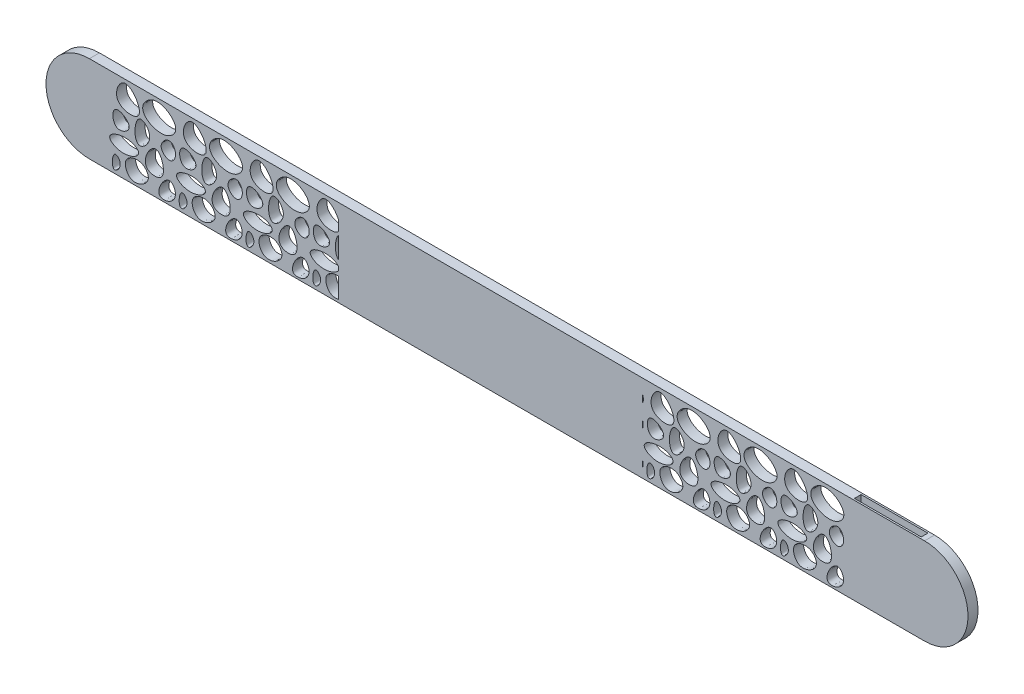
ISO-10303-21;
HEADER;
FILE_DESCRIPTION(('STEP AP214'),'2;1');
FILE_NAME('part.step','',(''),(''),'','','');
FILE_SCHEMA(('AUTOMOTIVE_DESIGN { 1 0 10303 214 1 1 1 1 }'));
ENDSEC;
DATA;
#1=APPLICATION_CONTEXT('core data for automotive mechanical design processes');
#2=APPLICATION_PROTOCOL_DEFINITION('international standard','automotive_design',2000,#1);
#3=PRODUCT_CONTEXT('',#1,'mechanical');
#4=PRODUCT('Part','Part','',(#3));
#5=PRODUCT_RELATED_PRODUCT_CATEGORY('part','',(#4));
#6=PRODUCT_DEFINITION_FORMATION('','',#4);
#7=PRODUCT_DEFINITION_CONTEXT('part definition',#1,'design');
#8=PRODUCT_DEFINITION('design','',#6,#7);
#9=PRODUCT_DEFINITION_SHAPE('','',#8);
#10=(LENGTH_UNIT() NAMED_UNIT(*) SI_UNIT(.MILLI.,.METRE.));
#11=(NAMED_UNIT(*) PLANE_ANGLE_UNIT() SI_UNIT($,.RADIAN.));
#12=(NAMED_UNIT(*) SI_UNIT($,.STERADIAN.) SOLID_ANGLE_UNIT());
#13=UNCERTAINTY_MEASURE_WITH_UNIT(LENGTH_MEASURE(1.E-05),#10,'distance_accuracy_value','');
#14=(GEOMETRIC_REPRESENTATION_CONTEXT(3) GLOBAL_UNCERTAINTY_ASSIGNED_CONTEXT((#13)) GLOBAL_UNIT_ASSIGNED_CONTEXT((#10,
#11,#12)) REPRESENTATION_CONTEXT('',''));
#15=CARTESIAN_POINT('',(0.,0.,0.));
#16=DIRECTION('',(0.,0.,1.));
#17=DIRECTION('',(1.,0.,0.));
#18=AXIS2_PLACEMENT_3D('',#15,#16,#17);
#19=CARTESIAN_POINT('',(-120.,13.,3.));
#20=DIRECTION('',(0.,-1.,0.));
#21=DIRECTION('',(0.,0.,-1.));
#22=AXIS2_PLACEMENT_3D('',#19,#20,#21);
#23=PLANE('',#22);
#24=DIRECTION('',(-1.,0.,0.));
#25=VECTOR('',#24,1.);
#26=CARTESIAN_POINT('',(-120.,13.,0.));
#27=LINE('',#26,#25);
#28=CARTESIAN_POINT('',(130.,13.,0.));
#29=VERTEX_POINT('',#28);
#30=CARTESIAN_POINT('',(-120.,13.,0.));
#31=VERTEX_POINT('',#30);
#32=EDGE_CURVE('E1580',#29,#31,#27,.T.);
#33=ORIENTED_EDGE('',*,*,#32,.T.);
#34=DIRECTION('',(0.,0.,-1.));
#35=VECTOR('',#34,1.);
#36=CARTESIAN_POINT('',(-120.,13.,3.));
#37=LINE('',#36,#35);
#38=CARTESIAN_POINT('',(-120.,13.,3.));
#39=VERTEX_POINT('',#38);
#40=EDGE_CURVE('E1586',#39,#31,#37,.T.);
#41=ORIENTED_EDGE('',*,*,#40,.F.);
#42=DIRECTION('',(-1.,0.,0.));
#43=VECTOR('',#42,1.);
#44=CARTESIAN_POINT('',(-120.,13.,3.));
#45=LINE('',#44,#43);
#46=CARTESIAN_POINT('',(130.,13.,3.));
#47=VERTEX_POINT('',#46);
#48=EDGE_CURVE('E1584',#47,#39,#45,.T.);
#49=ORIENTED_EDGE('',*,*,#48,.F.);
#50=DIRECTION('',(0.,0.,-1.));
#51=VECTOR('',#50,1.);
#52=CARTESIAN_POINT('',(130.,13.,3.));
#53=LINE('',#52,#51);
#54=EDGE_CURVE('E1596',#47,#29,#53,.T.);
#55=ORIENTED_EDGE('',*,*,#54,.T.);
#56=EDGE_LOOP('',(#33,#41,#49,#55));
#57=FACE_BOUND('',#56,.T.);
#58=DIRECTION('',(0.,0.,1.));
#59=VECTOR('',#58,1.);
#60=CARTESIAN_POINT('',(108.5,13.,3.00000000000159));
#61=LINE('',#60,#59);
#62=CARTESIAN_POINT('',(108.5,13.,0.5));
#63=VERTEX_POINT('',#62);
#64=CARTESIAN_POINT('',(108.5,13.,2.5));
#65=VERTEX_POINT('',#64);
#66=EDGE_CURVE('E1612',#63,#65,#61,.T.);
#67=ORIENTED_EDGE('',*,*,#66,.F.);
#68=DIRECTION('',(-1.,0.,0.));
#69=VECTOR('',#68,1.);
#70=CARTESIAN_POINT('',(-120.,13.,0.500000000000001));
#71=LINE('',#70,#69);
#72=CARTESIAN_POINT('',(128.5,13.,0.5));
#73=VERTEX_POINT('',#72);
#74=EDGE_CURVE('E1605',#73,#63,#71,.T.);
#75=ORIENTED_EDGE('',*,*,#74,.F.);
#76=DIRECTION('',(0.,0.,-1.));
#77=VECTOR('',#76,1.);
#78=CARTESIAN_POINT('',(128.5,13.,3.));
#79=LINE('',#78,#77);
#80=CARTESIAN_POINT('',(128.5,13.,2.5));
#81=VERTEX_POINT('',#80);
#82=EDGE_CURVE('E1607',#81,#73,#79,.T.);
#83=ORIENTED_EDGE('',*,*,#82,.F.);
#84=DIRECTION('',(1.,0.,0.));
#85=VECTOR('',#84,1.);
#86=CARTESIAN_POINT('',(-120.,13.,2.5));
#87=LINE('',#86,#85);
#88=EDGE_CURVE('E1610',#65,#81,#87,.T.);
#89=ORIENTED_EDGE('',*,*,#88,.F.);
#90=EDGE_LOOP('',(#67,#75,#83,#89));
#91=FACE_BOUND('',#90,.T.);
#92=ADVANCED_FACE('F43',(#57,#91),#23,.F.);
#93=CARTESIAN_POINT('',(-120.,0.,3.));
#94=DIRECTION('',(0.,0.,-1.));
#95=DIRECTION('',(-1.,0.,0.));
#96=AXIS2_PLACEMENT_3D('',#93,#94,#95);
#97=CYLINDRICAL_SURFACE('',#96,13.);
#98=CARTESIAN_POINT('',(-120.,0.,0.));
#99=DIRECTION('',(0.,0.,1.));
#100=DIRECTION('',(1.,0.,0.));
#101=AXIS2_PLACEMENT_3D('',#98,#99,#100);
#102=CIRCLE('',#101,13.);
#103=CARTESIAN_POINT('',(-120.,-13.,0.));
#104=VERTEX_POINT('',#103);
#105=EDGE_CURVE('E1575',#31,#104,#102,.T.);
#106=ORIENTED_EDGE('',*,*,#105,.T.);
#107=DIRECTION('',(0.,0.,-1.));
#108=VECTOR('',#107,1.);
#109=CARTESIAN_POINT('',(-120.,-13.,3.));
#110=LINE('',#109,#108);
#111=CARTESIAN_POINT('',(-120.,-13.,3.));
#112=VERTEX_POINT('',#111);
#113=EDGE_CURVE('E1602',#112,#104,#110,.T.);
#114=ORIENTED_EDGE('',*,*,#113,.F.);
#115=CARTESIAN_POINT('',(-120.,0.,3.));
#116=DIRECTION('',(0.,0.,1.));
#117=DIRECTION('',(1.,0.,0.));
#118=AXIS2_PLACEMENT_3D('',#115,#116,#117);
#119=CIRCLE('',#118,13.);
#120=EDGE_CURVE('E1576',#39,#112,#119,.T.);
#121=ORIENTED_EDGE('',*,*,#120,.F.);
#122=ORIENTED_EDGE('',*,*,#40,.T.);
#123=EDGE_LOOP('',(#106,#114,#121,#122));
#124=FACE_BOUND('',#123,.T.);
#125=ADVANCED_FACE('F45',(#124),#97,.T.);
#126=CARTESIAN_POINT('',(-120.,-13.,3.));
#127=DIRECTION('',(0.,1.,0.));
#128=DIRECTION('',(0.,0.,1.));
#129=AXIS2_PLACEMENT_3D('',#126,#127,#128);
#130=PLANE('',#129);
#131=DIRECTION('',(0.,0.,-1.));
#132=VECTOR('',#131,1.);
#133=CARTESIAN_POINT('',(130.,-13.,3.));
#134=LINE('',#133,#132);
#135=CARTESIAN_POINT('',(130.,-13.,3.));
#136=VERTEX_POINT('',#135);
#137=CARTESIAN_POINT('',(130.,-13.,0.));
#138=VERTEX_POINT('',#137);
#139=EDGE_CURVE('E1599',#136,#138,#134,.T.);
#140=ORIENTED_EDGE('',*,*,#139,.F.);
#141=DIRECTION('',(1.,0.,0.));
#142=VECTOR('',#141,1.);
#143=CARTESIAN_POINT('',(-120.,-13.,3.));
#144=LINE('',#143,#142);
#145=EDGE_CURVE('E1579',#112,#136,#144,.T.);
#146=ORIENTED_EDGE('',*,*,#145,.F.);
#147=ORIENTED_EDGE('',*,*,#113,.T.);
#148=DIRECTION('',(1.,0.,0.));
#149=VECTOR('',#148,1.);
#150=CARTESIAN_POINT('',(-120.,-13.,0.));
#151=LINE('',#150,#149);
#152=EDGE_CURVE('E1589',#104,#138,#151,.T.);
#153=ORIENTED_EDGE('',*,*,#152,.T.);
#154=EDGE_LOOP('',(#140,#146,#147,#153));
#155=FACE_BOUND('',#154,.T.);
#156=ADVANCED_FACE('F1834',(#155),#130,.F.);
#157=CARTESIAN_POINT('',(130.,0.,3.));
#158=DIRECTION('',(0.,0.,-1.));
#159=DIRECTION('',(-1.,0.,0.));
#160=AXIS2_PLACEMENT_3D('',#157,#158,#159);
#161=CYLINDRICAL_SURFACE('',#160,13.);
#162=CARTESIAN_POINT('',(130.,0.,0.));
#163=DIRECTION('',(0.,0.,1.));
#164=DIRECTION('',(1.,0.,0.));
#165=AXIS2_PLACEMENT_3D('',#162,#163,#164);
#166=CIRCLE('',#165,13.);
#167=EDGE_CURVE('E1591',#138,#29,#166,.T.);
#168=ORIENTED_EDGE('',*,*,#167,.T.);
#169=ORIENTED_EDGE('',*,*,#54,.F.);
#170=CARTESIAN_POINT('',(130.,0.,3.));
#171=DIRECTION('',(0.,0.,1.));
#172=DIRECTION('',(1.,0.,0.));
#173=AXIS2_PLACEMENT_3D('',#170,#171,#172);
#174=CIRCLE('',#173,13.);
#175=EDGE_CURVE('E1582',#136,#47,#174,.T.);
#176=ORIENTED_EDGE('',*,*,#175,.F.);
#177=ORIENTED_EDGE('',*,*,#139,.T.);
#178=EDGE_LOOP('',(#168,#169,#176,#177));
#179=FACE_BOUND('',#178,.T.);
#180=ADVANCED_FACE('F1656',(#179),#161,.T.);
#181=CARTESIAN_POINT('',(-120.,0.,3.));
#182=DIRECTION('',(0.,0.,1.));
#183=DIRECTION('',(1.,0.,0.));
#184=AXIS2_PLACEMENT_3D('',#181,#182,#183);
#185=PLANE('',#184);
#186=CARTESIAN_POINT('',(-49.4304564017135,11.9185536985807,3.));
#187=CARTESIAN_POINT('',(-47.1147162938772,12.2521903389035,3.));
#188=CARTESIAN_POINT('',(-41.5568772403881,3.55321812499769,3.));
#189=CARTESIAN_POINT('',(-54.0207762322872,4.85156039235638,3.));
#190=CARTESIAN_POINT('',(-51.2157989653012,11.6613332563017,3.));
#191=CARTESIAN_POINT('',(-49.4304564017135,11.9185536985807,3.));
#192=B_SPLINE_CURVE_WITH_KNOTS('',3,(#186,#187,#188,#189,#190,#191),.UNSPECIFIED.,.T.,.F.,(4,1,
1,4),(0.,0.38494413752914,0.703223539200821,1.),.UNSPECIFIED.);
#193=CARTESIAN_POINT('',(-45.5000000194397,5.38805080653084,3.));
#194=VERTEX_POINT('',#193);
#195=CARTESIAN_POINT('',(-45.5000000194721,8.60595359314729,3.));
#196=VERTEX_POINT('',#195);
#197=EDGE_CURVE('E1453',#194,#196,#192,.T.);
#198=ORIENTED_EDGE('',*,*,#197,.T.);
#199=DIRECTION('',(0.,1.,0.));
#200=VECTOR('',#199,1.);
#201=CARTESIAN_POINT('',(-45.5,13.,3.));
#202=LINE('',#201,#200);
#203=EDGE_CURVE('E1642',#194,#196,#202,.T.);
#204=ORIENTED_EDGE('',*,*,#203,.F.);
#205=EDGE_LOOP('',(#198,#204));
#206=FACE_BOUND('',#205,.T.);
#207=CARTESIAN_POINT('',(-44.8326247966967,4.94728281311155,3.));
#208=CARTESIAN_POINT('',(-43.7036274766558,5.25606113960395,3.));
#209=CARTESIAN_POINT('',(-40.0022308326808,1.53376969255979,3.));
#210=CARTESIAN_POINT('',(-47.136875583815,-5.34592932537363,3.));
#211=CARTESIAN_POINT('',(-46.6358895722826,4.45409379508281,3.));
#212=CARTESIAN_POINT('',(-44.8326247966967,4.94728281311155,3.));
#213=B_SPLINE_CURVE_WITH_KNOTS('',3,(#207,#208,#209,#210,#211,#212),.UNSPECIFIED.,.T.,.F.,(4,1,
1,4),(0.,0.26687185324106,0.573745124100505,1.),.UNSPECIFIED.);
#214=CARTESIAN_POINT('',(-45.5000000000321,-1.79595359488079,3.));
#215=VERTEX_POINT('',#214);
#216=CARTESIAN_POINT('',(-45.500000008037,4.4620585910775,3.));
#217=VERTEX_POINT('',#216);
#218=EDGE_CURVE('E1509',#215,#217,#213,.T.);
#219=ORIENTED_EDGE('',*,*,#218,.T.);
#220=EDGE_CURVE('E239',#215,#217,#202,.T.);
#221=ORIENTED_EDGE('',*,*,#220,.F.);
#222=EDGE_LOOP('',(#219,#221));
#223=FACE_BOUND('',#222,.T.);
#224=CARTESIAN_POINT('',(-48.1059959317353,-2.23624674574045,3.));
#225=CARTESIAN_POINT('',(-46.6856409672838,-2.47519939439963,3.));
#226=CARTESIAN_POINT('',(-43.4498877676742,-4.30012164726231,3.));
#227=CARTESIAN_POINT('',(-49.7303325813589,-7.62352268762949,3.));
#228=CARTESIAN_POINT('',(-56.4447559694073,-3.85021392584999,3.));
#229=CARTESIAN_POINT('',(-50.7712091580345,-1.78786604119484,3.));
#230=CARTESIAN_POINT('',(-48.1059959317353,-2.23624674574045,3.));
#231=B_SPLINE_CURVE_WITH_KNOTS('',3,(#224,#225,#226,#227,#228,#229,#230),.UNSPECIFIED.,.T.,.F.,
(4,1,1,1,4),(0.,0.171035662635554,0.443360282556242,0.679061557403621,1.),.UNSPECIFIED.);
#232=CARTESIAN_POINT('',(-45.4999999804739,-4.74939923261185,3.));
#233=VERTEX_POINT('',#232);
#234=CARTESIAN_POINT('',(-45.4999999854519,-3.4888000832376,3.));
#235=VERTEX_POINT('',#234);
#236=EDGE_CURVE('E1481',#233,#235,#231,.T.);
#237=ORIENTED_EDGE('',*,*,#236,.T.);
#238=EDGE_CURVE('E1641',#233,#235,#202,.T.);
#239=ORIENTED_EDGE('',*,*,#238,.F.);
#240=EDGE_LOOP('',(#237,#239));
#241=FACE_BOUND('',#240,.T.);
#242=CARTESIAN_POINT('',(-44.1967544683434,-6.42385961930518,3.));
#243=CARTESIAN_POINT('',(-43.0341167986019,-6.97569125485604,3.));
#244=CARTESIAN_POINT('',(-40.8839987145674,-10.2756015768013,3.));
#245=CARTESIAN_POINT('',(-47.8559939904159,-14.0480971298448,3.));
#246=CARTESIAN_POINT('',(-50.5138478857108,-6.89421317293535,3.));
#247=CARTESIAN_POINT('',(-45.90292357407,-5.61404748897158,3.));
#248=CARTESIAN_POINT('',(-44.1967544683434,-6.42385961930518,3.));
#249=B_SPLINE_CURVE_WITH_KNOTS('',3,(#242,#243,#244,#245,#246,#247,#248),.UNSPECIFIED.,.T.,.F.,
(4,1,1,1,4),(0.,0.185267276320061,0.490923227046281,0.728120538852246,1.),.UNSPECIFIED.);
#250=CARTESIAN_POINT('',(-45.499999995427,-12.1293263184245,3.));
#251=VERTEX_POINT('',#250);
#252=CARTESIAN_POINT('',(-45.5000000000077,-6.09221929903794,3.));
#253=VERTEX_POINT('',#252);
#254=EDGE_CURVE('E198',#251,#253,#249,.T.);
#255=ORIENTED_EDGE('',*,*,#254,.T.);
#256=EDGE_CURVE('E1636',#251,#253,#202,.T.);
#257=ORIENTED_EDGE('',*,*,#256,.F.);
#258=EDGE_LOOP('',(#255,#257));
#259=FACE_BOUND('',#258,.T.);
#260=CARTESIAN_POINT('',(44.1673860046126,-6.66842513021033,3.));
#261=CARTESIAN_POINT('',(44.8385523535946,-6.80911075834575,3.));
#262=CARTESIAN_POINT('',(46.3464082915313,-8.95288057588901,3.));
#263=CARTESIAN_POINT('',(44.9360183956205,-12.3176850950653,3.));
#264=CARTESIAN_POINT('',(38.7079021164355,-12.933643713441,3.));
#265=CARTESIAN_POINT('',(42.3838515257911,-6.29457195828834,3.));
#266=CARTESIAN_POINT('',(44.1673860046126,-6.66842513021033,3.));
#267=B_SPLINE_CURVE_WITH_KNOTS('',3,(#260,#261,#262,#263,#264,#265,#266),.UNSPECIFIED.,.T.,.F.,
(4,1,1,1,4),(0.,0.151474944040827,0.395947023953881,0.597475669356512,1.),.UNSPECIFIED.);
#268=CARTESIAN_POINT('',(45.5000000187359,-8.05828367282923,3.));
#269=VERTEX_POINT('',#268);
#270=CARTESIAN_POINT('',(45.5000000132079,-10.4174176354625,3.));
#271=VERTEX_POINT('',#270);
#272=EDGE_CURVE('E550',#269,#271,#267,.T.);
#273=ORIENTED_EDGE('',*,*,#272,.T.);
#274=DIRECTION('',(0.,-1.,0.));
#275=VECTOR('',#274,1.);
#276=CARTESIAN_POINT('',(45.5,13.,3.));
#277=LINE('',#276,#275);
#278=EDGE_CURVE('E1631',#269,#271,#277,.T.);
#279=ORIENTED_EDGE('',*,*,#278,.F.);
#280=EDGE_LOOP('',(#273,#279));
#281=FACE_BOUND('',#280,.T.);
#282=CARTESIAN_POINT('',(44.1184729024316,3.6522394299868,3.));
#283=CARTESIAN_POINT('',(45.2138020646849,3.48587553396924,3.));
#284=CARTESIAN_POINT('',(46.4699046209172,0.744688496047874,3.));
#285=CARTESIAN_POINT('',(44.0787663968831,-2.35969928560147,3.));
#286=CARTESIAN_POINT('',(39.9376651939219,0.929944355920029,3.));
#287=CARTESIAN_POINT('',(42.9556049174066,3.82886144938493,3.));
#288=CARTESIAN_POINT('',(44.1184729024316,3.6522394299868,3.));
#289=B_SPLINE_CURVE_WITH_KNOTS('',3,(#282,#283,#284,#285,#286,#287,#288),.UNSPECIFIED.,.T.,.F.,
(4,1,1,1,4),(0.,0.267591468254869,0.446443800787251,0.715908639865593,1.),.UNSPECIFIED.);
#290=CARTESIAN_POINT('',(45.5000000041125,2.34995971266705,3.));
#291=VERTEX_POINT('',#290);
#292=CARTESIAN_POINT('',(45.5000000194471,-0.236822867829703,3.));
#293=VERTEX_POINT('',#292);
#294=EDGE_CURVE('E551',#291,#293,#289,.T.);
#295=ORIENTED_EDGE('',*,*,#294,.T.);
#296=EDGE_CURVE('E1630',#291,#293,#277,.T.);
#297=ORIENTED_EDGE('',*,*,#296,.F.);
#298=EDGE_LOOP('',(#295,#297));
#299=FACE_BOUND('',#298,.T.);
#300=CARTESIAN_POINT('',(39.5921612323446,11.9229429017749,3.));
#301=CARTESIAN_POINT('',(42.5379927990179,12.4200970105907,3.));
#302=CARTESIAN_POINT('',(48.0641725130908,8.25173823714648,3.));
#303=CARTESIAN_POINT('',(41.9357534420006,2.78863842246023,3.));
#304=CARTESIAN_POINT('',(33.3912192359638,7.05600921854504,3.));
#305=CARTESIAN_POINT('',(37.586007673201,11.5843738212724,3.));
#306=CARTESIAN_POINT('',(39.5921612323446,11.9229429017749,3.));
#307=B_SPLINE_CURVE_WITH_KNOTS('',3,(#300,#301,#302,#303,#304,#305,#306),.UNSPECIFIED.,.T.,.F.,
(4,1,1,1,4),(0.,0.311224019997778,0.476242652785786,0.788051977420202,1.),.UNSPECIFIED.);
#308=CARTESIAN_POINT('',(45.5000000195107,8.93832093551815,3.));
#309=VERTEX_POINT('',#308);
#310=CARTESIAN_POINT('',(45.4999999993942,6.44771054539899,3.));
#311=VERTEX_POINT('',#310);
#312=EDGE_CURVE('E465',#309,#311,#307,.T.);
#313=ORIENTED_EDGE('',*,*,#312,.T.);
#314=EDGE_CURVE('E1628',#309,#311,#277,.T.);
#315=ORIENTED_EDGE('',*,*,#314,.F.);
#316=EDGE_LOOP('',(#313,#315));
#317=FACE_BOUND('',#316,.T.);
#318=ORIENTED_EDGE('',*,*,#145,.T.);
#319=ORIENTED_EDGE('',*,*,#175,.T.);
#320=ORIENTED_EDGE('',*,*,#48,.T.);
#321=ORIENTED_EDGE('',*,*,#120,.T.);
#322=EDGE_LOOP('',(#318,#319,#320,#321));
#323=FACE_BOUND('',#322,.T.);
#324=CARTESIAN_POINT('',(104.167386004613,-6.66842513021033,3.));
#325=CARTESIAN_POINT('',(104.838552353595,-6.80911075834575,3.));
#326=CARTESIAN_POINT('',(106.346408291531,-8.95288057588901,3.));
#327=CARTESIAN_POINT('',(104.93601839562,-12.3176850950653,3.));
#328=CARTESIAN_POINT('',(98.7079021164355,-12.933643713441,3.));
#329=CARTESIAN_POINT('',(102.383851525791,-6.29457195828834,3.));
#330=CARTESIAN_POINT('',(104.167386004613,-6.66842513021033,3.));
#331=B_SPLINE_CURVE_WITH_KNOTS('',3,(#324,#325,#326,#327,#328,#329,#330),.UNSPECIFIED.,.T.,.F.,
(4,1,1,1,4),(0.,0.151474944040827,0.395947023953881,0.597475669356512,1.),.UNSPECIFIED.);
#332=CARTESIAN_POINT('',(104.167386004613,-6.66842513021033,3.));
#333=VERTEX_POINT('',#332);
#334=EDGE_CURVE('E873',#333,#333,#331,.T.);
#335=ORIENTED_EDGE('',*,*,#334,.T.);
#336=EDGE_LOOP('',(#335));
#337=FACE_BOUND('',#336,.T.);
#338=CARTESIAN_POINT('',(95.8032455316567,-6.42385961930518,3.));
#339=CARTESIAN_POINT('',(96.9658832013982,-6.97569125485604,3.));
#340=CARTESIAN_POINT('',(99.1160012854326,-10.2756015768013,3.));
#341=CARTESIAN_POINT('',(92.1440060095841,-14.0480971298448,3.));
#342=CARTESIAN_POINT('',(89.4861521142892,-6.89421317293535,3.));
#343=CARTESIAN_POINT('',(94.0970764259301,-5.61404748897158,3.));
#344=CARTESIAN_POINT('',(95.8032455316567,-6.42385961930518,3.));
#345=B_SPLINE_CURVE_WITH_KNOTS('',3,(#338,#339,#340,#341,#342,#343,#344),.UNSPECIFIED.,.T.,.F.,
(4,1,1,1,4),(0.,0.185267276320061,0.490923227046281,0.728120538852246,1.),.UNSPECIFIED.);
#346=CARTESIAN_POINT('',(95.8032455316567,-6.42385961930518,3.));
#347=VERTEX_POINT('',#346);
#348=EDGE_CURVE('E890',#347,#347,#345,.T.);
#349=ORIENTED_EDGE('',*,*,#348,.T.);
#350=EDGE_LOOP('',(#349));
#351=FACE_BOUND('',#350,.T.);
#352=CARTESIAN_POINT('',(67.7695847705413,-7.89125268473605,3.));
#353=CARTESIAN_POINT('',(68.3557405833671,-7.77202766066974,3.));
#354=CARTESIAN_POINT('',(70.231142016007,-9.93192943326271,3.));
#355=CARTESIAN_POINT('',(66.3595955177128,-14.0889750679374,3.));
#356=CARTESIAN_POINT('',(66.7484891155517,-8.0989451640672,3.));
#357=CARTESIAN_POINT('',(67.7695847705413,-7.89125268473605,3.));
#358=B_SPLINE_CURVE_WITH_KNOTS('',3,(#352,#353,#354,#355,#356,#357),.UNSPECIFIED.,.T.,.F.,(4,1,
1,4),(0.,0.252787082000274,0.559639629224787,1.),.UNSPECIFIED.);
#359=CARTESIAN_POINT('',(67.7695847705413,-7.89125268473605,3.));
#360=VERTEX_POINT('',#359);
#361=EDGE_CURVE('E351',#360,#360,#358,.T.);
#362=ORIENTED_EDGE('',*,*,#361,.T.);
#363=EDGE_LOOP('',(#362));
#364=FACE_BOUND('',#363,.T.);
#365=CARTESIAN_POINT('',(71.8940040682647,-2.23624674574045,3.));
#366=CARTESIAN_POINT('',(73.3143590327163,-2.47519939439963,3.));
#367=CARTESIAN_POINT('',(76.5501122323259,-4.30012164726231,3.));
#368=CARTESIAN_POINT('',(70.2696674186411,-7.62352268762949,3.));
#369=CARTESIAN_POINT('',(63.5552440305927,-3.85021392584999,3.));
#370=CARTESIAN_POINT('',(69.2287908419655,-1.78786604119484,3.));
#371=CARTESIAN_POINT('',(71.8940040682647,-2.23624674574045,3.));
#372=B_SPLINE_CURVE_WITH_KNOTS('',3,(#365,#366,#367,#368,#369,#370,#371),.UNSPECIFIED.,.T.,.F.,
(4,1,1,1,4),(0.,0.171035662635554,0.443360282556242,0.679061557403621,1.),.UNSPECIFIED.);
#373=CARTESIAN_POINT('',(71.8940040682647,-2.23624674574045,3.));
#374=VERTEX_POINT('',#373);
#375=EDGE_CURVE('E364',#374,#374,#372,.T.);
#376=ORIENTED_EDGE('',*,*,#375,.T.);
#377=EDGE_LOOP('',(#376));
#378=FACE_BOUND('',#377,.T.);
#379=CARTESIAN_POINT('',(71.8940040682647,1.11181127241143,3.));
#380=CARTESIAN_POINT('',(71.7918549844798,-0.231758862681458,3.));
#381=CARTESIAN_POINT('',(67.0507982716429,-2.72552779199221,3.));
#382=CARTESIAN_POINT('',(66.3163949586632,6.26400639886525,3.));
#383=CARTESIAN_POINT('',(72.0164383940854,2.72219383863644,3.));
#384=CARTESIAN_POINT('',(71.8940040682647,1.11181127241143,3.));
#385=B_SPLINE_CURVE_WITH_KNOTS('',3,(#379,#380,#381,#382,#383,#384),.UNSPECIFIED.,.T.,.F.,(4,1,
1,4),(0.,0.302461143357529,0.637474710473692,1.),.UNSPECIFIED.);
#386=CARTESIAN_POINT('',(71.8940040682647,1.11181127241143,3.));
#387=VERTEX_POINT('',#386);
#388=EDGE_CURVE('E381',#387,#387,#385,.T.);
#389=ORIENTED_EDGE('',*,*,#388,.T.);
#390=EDGE_LOOP('',(#389));
#391=FACE_BOUND('',#390,.T.);
#392=CARTESIAN_POINT('',(79.5921612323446,11.9229429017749,3.));
#393=CARTESIAN_POINT('',(82.5379927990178,12.4200970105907,3.));
#394=CARTESIAN_POINT('',(88.0641725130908,8.25173823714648,3.));
#395=CARTESIAN_POINT('',(81.9357534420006,2.78863842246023,3.));
#396=CARTESIAN_POINT('',(73.3912192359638,7.05600921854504,3.));
#397=CARTESIAN_POINT('',(77.5860076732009,11.5843738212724,3.));
#398=CARTESIAN_POINT('',(79.5921612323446,11.9229429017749,3.));
#399=B_SPLINE_CURVE_WITH_KNOTS('',3,(#392,#393,#394,#395,#396,#397,#398),.UNSPECIFIED.,.T.,.F.,
(4,1,1,1,4),(0.,0.311224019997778,0.476242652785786,0.788051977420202,1.),.UNSPECIFIED.);
#400=CARTESIAN_POINT('',(79.5921612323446,11.9229429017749,3.));
#401=VERTEX_POINT('',#400);
#402=EDGE_CURVE('E408',#401,#401,#399,.T.);
#403=ORIENTED_EDGE('',*,*,#402,.T.);
#404=EDGE_LOOP('',(#403));
#405=FACE_BOUND('',#404,.T.);
#406=CARTESIAN_POINT('',(51.8940040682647,1.11181127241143,3.));
#407=CARTESIAN_POINT('',(51.7918549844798,-0.231758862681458,3.));
#408=CARTESIAN_POINT('',(47.0507982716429,-2.72552779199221,3.));
#409=CARTESIAN_POINT('',(46.3163949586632,6.26400639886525,3.));
#410=CARTESIAN_POINT('',(52.0164383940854,2.72219383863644,3.));
#411=CARTESIAN_POINT('',(51.8940040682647,1.11181127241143,3.));
#412=B_SPLINE_CURVE_WITH_KNOTS('',3,(#406,#407,#408,#409,#410,#411),.UNSPECIFIED.,.T.,.F.,(4,1,
1,4),(0.,0.302461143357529,0.637474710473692,1.),.UNSPECIFIED.);
#413=CARTESIAN_POINT('',(51.8940040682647,1.11181127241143,3.));
#414=VERTEX_POINT('',#413);
#415=EDGE_CURVE('E421',#414,#414,#412,.T.);
#416=ORIENTED_EDGE('',*,*,#415,.T.);
#417=EDGE_LOOP('',(#416));
#418=FACE_BOUND('',#417,.T.);
#419=CARTESIAN_POINT('',(59.5921612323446,11.9229429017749,3.));
#420=CARTESIAN_POINT('',(62.5379927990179,12.4200970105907,3.));
#421=CARTESIAN_POINT('',(68.0641725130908,8.25173823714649,3.));
#422=CARTESIAN_POINT('',(61.9357534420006,2.78863842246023,3.));
#423=CARTESIAN_POINT('',(53.3912192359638,7.05600921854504,3.));
#424=CARTESIAN_POINT('',(57.586007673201,11.5843738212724,3.));
#425=CARTESIAN_POINT('',(59.5921612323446,11.9229429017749,3.));
#426=B_SPLINE_CURVE_WITH_KNOTS('',3,(#419,#420,#421,#422,#423,#424,#425),.UNSPECIFIED.,.T.,.F.,
(4,1,1,1,4),(0.,0.311224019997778,0.476242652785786,0.788051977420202,1.),.UNSPECIFIED.);
#427=CARTESIAN_POINT('',(59.5921612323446,11.9229429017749,3.));
#428=VERTEX_POINT('',#427);
#429=EDGE_CURVE('E307',#428,#428,#426,.T.);
#430=ORIENTED_EDGE('',*,*,#429,.T.);
#431=EDGE_LOOP('',(#430));
#432=FACE_BOUND('',#431,.T.);
#433=CARTESIAN_POINT('',(51.8940040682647,-2.23624674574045,3.));
#434=CARTESIAN_POINT('',(53.3143590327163,-2.47519939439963,3.));
#435=CARTESIAN_POINT('',(56.5501122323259,-4.30012164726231,3.));
#436=CARTESIAN_POINT('',(50.2696674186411,-7.62352268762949,3.));
#437=CARTESIAN_POINT('',(43.5552440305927,-3.85021392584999,3.));
#438=CARTESIAN_POINT('',(49.2287908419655,-1.78786604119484,3.));
#439=CARTESIAN_POINT('',(51.8940040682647,-2.23624674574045,3.));
#440=B_SPLINE_CURVE_WITH_KNOTS('',3,(#433,#434,#435,#436,#437,#438,#439),.UNSPECIFIED.,.T.,.F.,
(4,1,1,1,4),(0.,0.171035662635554,0.443360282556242,0.679061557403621,1.),.UNSPECIFIED.);
#441=CARTESIAN_POINT('',(51.8940040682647,-2.23624674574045,3.));
#442=VERTEX_POINT('',#441);
#443=EDGE_CURVE('E256',#442,#442,#440,.T.);
#444=ORIENTED_EDGE('',*,*,#443,.T.);
#445=EDGE_LOOP('',(#444));
#446=FACE_BOUND('',#445,.T.);
#447=CARTESIAN_POINT('',(47.7695847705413,-7.89125268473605,3.));
#448=CARTESIAN_POINT('',(48.3557405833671,-7.77202766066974,3.));
#449=CARTESIAN_POINT('',(50.231142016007,-9.93192943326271,3.));
#450=CARTESIAN_POINT('',(46.3595955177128,-14.0889750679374,3.));
#451=CARTESIAN_POINT('',(46.7484891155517,-8.0989451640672,3.));
#452=CARTESIAN_POINT('',(47.7695847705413,-7.89125268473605,3.));
#453=B_SPLINE_CURVE_WITH_KNOTS('',3,(#447,#448,#449,#450,#451,#452),.UNSPECIFIED.,.T.,.F.,(4,1,
1,4),(0.,0.252787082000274,0.559639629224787,1.),.UNSPECIFIED.);
#454=CARTESIAN_POINT('',(47.7695847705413,-7.89125268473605,3.));
#455=VERTEX_POINT('',#454);
#456=EDGE_CURVE('E263',#455,#455,#453,.T.);
#457=ORIENTED_EDGE('',*,*,#456,.T.);
#458=EDGE_LOOP('',(#457));
#459=FACE_BOUND('',#458,.T.);
#460=CARTESIAN_POINT('',(55.8032455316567,-6.42385961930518,3.));
#461=CARTESIAN_POINT('',(56.9658832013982,-6.97569125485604,3.));
#462=CARTESIAN_POINT('',(59.1160012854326,-10.2756015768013,3.));
#463=CARTESIAN_POINT('',(52.1440060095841,-14.0480971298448,3.));
#464=CARTESIAN_POINT('',(49.4861521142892,-6.89421317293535,3.));
#465=CARTESIAN_POINT('',(54.0970764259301,-5.61404748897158,3.));
#466=CARTESIAN_POINT('',(55.8032455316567,-6.42385961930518,3.));
#467=B_SPLINE_CURVE_WITH_KNOTS('',3,(#460,#461,#462,#463,#464,#465,#466),.UNSPECIFIED.,.T.,.F.,
(4,1,1,1,4),(0.,0.185267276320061,0.490923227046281,0.728120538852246,1.),.UNSPECIFIED.);
#468=CARTESIAN_POINT('',(55.8032455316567,-6.42385961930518,3.));
#469=VERTEX_POINT('',#468);
#470=EDGE_CURVE('E262',#469,#469,#467,.T.);
#471=ORIENTED_EDGE('',*,*,#470,.T.);
#472=EDGE_LOOP('',(#471));
#473=FACE_BOUND('',#472,.T.);
#474=CARTESIAN_POINT('',(64.1673860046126,-6.66842513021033,3.));
#475=CARTESIAN_POINT('',(64.8385523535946,-6.80911075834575,3.));
#476=CARTESIAN_POINT('',(66.3464082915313,-8.95288057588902,3.));
#477=CARTESIAN_POINT('',(64.9360183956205,-12.3176850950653,3.));
#478=CARTESIAN_POINT('',(58.7079021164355,-12.933643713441,3.));
#479=CARTESIAN_POINT('',(62.3838515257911,-6.29457195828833,3.));
#480=CARTESIAN_POINT('',(64.1673860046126,-6.66842513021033,3.));
#481=B_SPLINE_CURVE_WITH_KNOTS('',3,(#474,#475,#476,#477,#478,#479,#480),.UNSPECIFIED.,.T.,.F.,
(4,1,1,1,4),(0.,0.151474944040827,0.395947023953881,0.597475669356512,1.),.UNSPECIFIED.);
#482=CARTESIAN_POINT('',(64.1673860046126,-6.66842513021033,3.));
#483=VERTEX_POINT('',#482);
#484=EDGE_CURVE('E308',#483,#483,#481,.T.);
#485=ORIENTED_EDGE('',*,*,#484,.T.);
#486=EDGE_LOOP('',(#485));
#487=FACE_BOUND('',#486,.T.);
#488=CARTESIAN_POINT('',(75.1673752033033,4.94728281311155,3.));
#489=CARTESIAN_POINT('',(76.2963725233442,5.25606113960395,3.));
#490=CARTESIAN_POINT('',(79.9977691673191,1.53376969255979,3.));
#491=CARTESIAN_POINT('',(72.863124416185,-5.34592932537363,3.));
#492=CARTESIAN_POINT('',(73.3641104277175,4.45409379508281,3.));
#493=CARTESIAN_POINT('',(75.1673752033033,4.94728281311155,3.));
#494=B_SPLINE_CURVE_WITH_KNOTS('',3,(#488,#489,#490,#491,#492,#493),.UNSPECIFIED.,.T.,.F.,(4,1,
1,4),(0.,0.26687185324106,0.573745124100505,1.),.UNSPECIFIED.);
#495=CARTESIAN_POINT('',(75.1673752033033,4.94728281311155,3.));
#496=VERTEX_POINT('',#495);
#497=EDGE_CURVE('E588',#496,#496,#494,.T.);
#498=ORIENTED_EDGE('',*,*,#497,.T.);
#499=EDGE_LOOP('',(#498));
#500=FACE_BOUND('',#499,.T.);
#501=CARTESIAN_POINT('',(99.5921612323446,11.9229429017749,3.));
#502=CARTESIAN_POINT('',(102.537992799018,12.4200970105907,3.));
#503=CARTESIAN_POINT('',(108.064172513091,8.25173823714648,3.));
#504=CARTESIAN_POINT('',(101.935753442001,2.78863842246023,3.));
#505=CARTESIAN_POINT('',(93.3912192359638,7.05600921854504,3.));
#506=CARTESIAN_POINT('',(97.5860076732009,11.5843738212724,3.));
#507=CARTESIAN_POINT('',(99.5921612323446,11.9229429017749,3.));
#508=B_SPLINE_CURVE_WITH_KNOTS('',3,(#501,#502,#503,#504,#505,#506,#507),.UNSPECIFIED.,.T.,.F.,
(4,1,1,1,4),(0.,0.311224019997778,0.476242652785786,0.788051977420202,1.),.UNSPECIFIED.);
#509=CARTESIAN_POINT('',(99.5921612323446,11.9229429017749,3.));
#510=VERTEX_POINT('',#509);
#511=EDGE_CURVE('E607',#510,#510,#508,.T.);
#512=ORIENTED_EDGE('',*,*,#511,.T.);
#513=EDGE_LOOP('',(#512));
#514=FACE_BOUND('',#513,.T.);
#515=CARTESIAN_POINT('',(91.8940040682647,1.11181127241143,3.));
#516=CARTESIAN_POINT('',(91.7918549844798,-0.231758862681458,3.));
#517=CARTESIAN_POINT('',(87.0507982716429,-2.72552779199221,3.));
#518=CARTESIAN_POINT('',(86.3163949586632,6.26400639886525,3.));
#519=CARTESIAN_POINT('',(92.0164383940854,2.72219383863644,3.));
#520=CARTESIAN_POINT('',(91.8940040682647,1.11181127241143,3.));
#521=B_SPLINE_CURVE_WITH_KNOTS('',3,(#515,#516,#517,#518,#519,#520),.UNSPECIFIED.,.T.,.F.,(4,1,
1,4),(0.,0.302461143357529,0.637474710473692,1.),.UNSPECIFIED.);
#522=CARTESIAN_POINT('',(91.8940040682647,1.11181127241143,3.));
#523=VERTEX_POINT('',#522);
#524=EDGE_CURVE('E606',#523,#523,#521,.T.);
#525=ORIENTED_EDGE('',*,*,#524,.T.);
#526=EDGE_LOOP('',(#525));
#527=FACE_BOUND('',#526,.T.);
#528=CARTESIAN_POINT('',(75.8032455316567,-6.42385961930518,3.));
#529=CARTESIAN_POINT('',(76.9658832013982,-6.97569125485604,3.));
#530=CARTESIAN_POINT('',(79.1160012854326,-10.2756015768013,3.));
#531=CARTESIAN_POINT('',(72.1440060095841,-14.0480971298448,3.));
#532=CARTESIAN_POINT('',(69.4861521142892,-6.89421317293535,3.));
#533=CARTESIAN_POINT('',(74.0970764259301,-5.61404748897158,3.));
#534=CARTESIAN_POINT('',(75.8032455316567,-6.42385961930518,3.));
#535=B_SPLINE_CURVE_WITH_KNOTS('',3,(#528,#529,#530,#531,#532,#533,#534),.UNSPECIFIED.,.T.,.F.,
(4,1,1,1,4),(0.,0.185267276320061,0.490923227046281,0.728120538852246,1.),.UNSPECIFIED.);
#536=CARTESIAN_POINT('',(75.8032455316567,-6.42385961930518,3.));
#537=VERTEX_POINT('',#536);
#538=EDGE_CURVE('E648',#537,#537,#535,.T.);
#539=ORIENTED_EDGE('',*,*,#538,.T.);
#540=EDGE_LOOP('',(#539));
#541=FACE_BOUND('',#540,.T.);
#542=CARTESIAN_POINT('',(70.5695435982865,11.9185536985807,3.));
#543=CARTESIAN_POINT('',(72.8852837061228,12.2521903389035,3.));
#544=CARTESIAN_POINT('',(78.4431227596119,3.55321812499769,3.));
#545=CARTESIAN_POINT('',(65.9792237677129,4.85156039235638,3.));
#546=CARTESIAN_POINT('',(68.7842010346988,11.6613332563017,3.));
#547=CARTESIAN_POINT('',(70.5695435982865,11.9185536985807,3.));
#548=B_SPLINE_CURVE_WITH_KNOTS('',3,(#542,#543,#544,#545,#546,#547),.UNSPECIFIED.,.T.,.F.,(4,1,
1,4),(0.,0.38494413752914,0.703223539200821,1.),.UNSPECIFIED.);
#549=CARTESIAN_POINT('',(70.5695435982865,11.9185536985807,3.));
#550=VERTEX_POINT('',#549);
#551=EDGE_CURVE('E589',#550,#550,#548,.T.);
#552=ORIENTED_EDGE('',*,*,#551,.T.);
#553=EDGE_LOOP('',(#552));
#554=FACE_BOUND('',#553,.T.);
#555=CARTESIAN_POINT('',(104.118472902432,3.6522394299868,3.));
#556=CARTESIAN_POINT('',(105.213802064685,3.48587553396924,3.));
#557=CARTESIAN_POINT('',(106.469904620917,0.744688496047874,3.));
#558=CARTESIAN_POINT('',(104.078766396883,-2.35969928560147,3.));
#559=CARTESIAN_POINT('',(99.9376651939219,0.929944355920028,3.));
#560=CARTESIAN_POINT('',(102.955604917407,3.82886144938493,3.));
#561=CARTESIAN_POINT('',(104.118472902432,3.6522394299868,3.));
#562=B_SPLINE_CURVE_WITH_KNOTS('',3,(#555,#556,#557,#558,#559,#560,#561),.UNSPECIFIED.,.T.,.F.,
(4,1,1,1,4),(0.,0.267591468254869,0.446443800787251,0.715908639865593,1.),.UNSPECIFIED.);
#563=CARTESIAN_POINT('',(104.118472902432,3.6522394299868,3.));
#564=VERTEX_POINT('',#563);
#565=EDGE_CURVE('E721',#564,#564,#562,.T.);
#566=ORIENTED_EDGE('',*,*,#565,.T.);
#567=EDGE_LOOP('',(#566));
#568=FACE_BOUND('',#567,.T.);
#569=CARTESIAN_POINT('',(95.1673752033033,4.94728281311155,3.));
#570=CARTESIAN_POINT('',(96.2963725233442,5.25606113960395,3.));
#571=CARTESIAN_POINT('',(99.9977691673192,1.53376969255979,3.));
#572=CARTESIAN_POINT('',(92.863124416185,-5.34592932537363,3.));
#573=CARTESIAN_POINT('',(93.3641104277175,4.45409379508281,3.));
#574=CARTESIAN_POINT('',(95.1673752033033,4.94728281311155,3.));
#575=B_SPLINE_CURVE_WITH_KNOTS('',3,(#569,#570,#571,#572,#573,#574),.UNSPECIFIED.,.T.,.F.,(4,1,
1,4),(0.,0.26687185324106,0.573745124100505,1.),.UNSPECIFIED.);
#576=CARTESIAN_POINT('',(95.1673752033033,4.94728281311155,3.));
#577=VERTEX_POINT('',#576);
#578=EDGE_CURVE('E760',#577,#577,#575,.T.);
#579=ORIENTED_EDGE('',*,*,#578,.T.);
#580=EDGE_LOOP('',(#579));
#581=FACE_BOUND('',#580,.T.);
#582=CARTESIAN_POINT('',(91.8940040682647,-2.23624674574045,3.));
#583=CARTESIAN_POINT('',(93.3143590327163,-2.47519939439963,3.));
#584=CARTESIAN_POINT('',(96.5501122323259,-4.30012164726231,3.));
#585=CARTESIAN_POINT('',(90.2696674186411,-7.62352268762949,3.));
#586=CARTESIAN_POINT('',(83.5552440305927,-3.85021392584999,3.));
#587=CARTESIAN_POINT('',(89.2287908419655,-1.78786604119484,3.));
#588=CARTESIAN_POINT('',(91.8940040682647,-2.23624674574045,3.));
#589=B_SPLINE_CURVE_WITH_KNOTS('',3,(#582,#583,#584,#585,#586,#587,#588),.UNSPECIFIED.,.T.,.F.,
(4,1,1,1,4),(0.,0.171035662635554,0.443360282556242,0.679061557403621,1.),.UNSPECIFIED.);
#590=CARTESIAN_POINT('',(91.8940040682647,-2.23624674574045,3.));
#591=VERTEX_POINT('',#590);
#592=EDGE_CURVE('E759',#591,#591,#589,.T.);
#593=ORIENTED_EDGE('',*,*,#592,.T.);
#594=EDGE_LOOP('',(#593));
#595=FACE_BOUND('',#594,.T.);
#596=CARTESIAN_POINT('',(87.7695847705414,-7.89125268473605,3.));
#597=CARTESIAN_POINT('',(88.3557405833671,-7.77202766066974,3.));
#598=CARTESIAN_POINT('',(90.231142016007,-9.93192943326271,3.));
#599=CARTESIAN_POINT('',(86.3595955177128,-14.0889750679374,3.));
#600=CARTESIAN_POINT('',(86.7484891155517,-8.0989451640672,3.));
#601=CARTESIAN_POINT('',(87.7695847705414,-7.89125268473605,3.));
#602=B_SPLINE_CURVE_WITH_KNOTS('',3,(#596,#597,#598,#599,#600,#601),.UNSPECIFIED.,.T.,.F.,(4,1,
1,4),(0.,0.252787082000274,0.559639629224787,1.),.UNSPECIFIED.);
#603=CARTESIAN_POINT('',(87.7695847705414,-7.89125268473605,3.));
#604=VERTEX_POINT('',#603);
#605=EDGE_CURVE('E803',#604,#604,#602,.T.);
#606=ORIENTED_EDGE('',*,*,#605,.T.);
#607=EDGE_LOOP('',(#606));
#608=FACE_BOUND('',#607,.T.);
#609=CARTESIAN_POINT('',(79.9608592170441,-0.50537425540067,3.));
#610=CARTESIAN_POINT('',(80.8839959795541,-0.620382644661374,3.));
#611=CARTESIAN_POINT('',(82.4758823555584,-3.54239954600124,3.));
#612=CARTESIAN_POINT('',(82.0366450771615,-8.22562996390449,3.));
#613=CARTESIAN_POINT('',(74.3645216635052,-7.25678772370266,3.));
#614=CARTESIAN_POINT('',(78.2080678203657,-0.287003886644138,3.));
#615=CARTESIAN_POINT('',(79.9608592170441,-0.50537425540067,3.));
#616=B_SPLINE_CURVE_WITH_KNOTS('',3,(#609,#610,#611,#612,#613,#614,#615),.UNSPECIFIED.,.T.,.F.,
(4,1,1,1,4),(0.,0.192677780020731,0.409785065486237,0.634156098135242,1.),.UNSPECIFIED.);
#617=CARTESIAN_POINT('',(79.9608592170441,-0.50537425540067,3.));
#618=VERTEX_POINT('',#617);
#619=EDGE_CURVE('E704',#618,#618,#616,.T.);
#620=ORIENTED_EDGE('',*,*,#619,.T.);
#621=EDGE_LOOP('',(#620));
#622=FACE_BOUND('',#621,.T.);
#623=CARTESIAN_POINT('',(84.1673860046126,-6.66842513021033,3.));
#624=CARTESIAN_POINT('',(84.8385523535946,-6.80911075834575,3.));
#625=CARTESIAN_POINT('',(86.3464082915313,-8.95288057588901,3.));
#626=CARTESIAN_POINT('',(84.9360183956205,-12.3176850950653,3.));
#627=CARTESIAN_POINT('',(78.7079021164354,-12.933643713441,3.));
#628=CARTESIAN_POINT('',(82.383851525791,-6.29457195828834,3.));
#629=CARTESIAN_POINT('',(84.1673860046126,-6.66842513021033,3.));
#630=B_SPLINE_CURVE_WITH_KNOTS('',3,(#623,#624,#625,#626,#627,#628,#629),.UNSPECIFIED.,.T.,.F.,
(4,1,1,1,4),(0.,0.151474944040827,0.395947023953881,0.597475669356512,1.),.UNSPECIFIED.);
#631=CARTESIAN_POINT('',(84.1673860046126,-6.66842513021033,3.));
#632=VERTEX_POINT('',#631);
#633=EDGE_CURVE('E647',#632,#632,#630,.T.);
#634=ORIENTED_EDGE('',*,*,#633,.T.);
#635=EDGE_LOOP('',(#634));
#636=FACE_BOUND('',#635,.T.);
#637=CARTESIAN_POINT('',(84.1184729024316,3.6522394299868,3.));
#638=CARTESIAN_POINT('',(85.2138020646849,3.48587553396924,3.));
#639=CARTESIAN_POINT('',(86.4699046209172,0.744688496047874,3.));
#640=CARTESIAN_POINT('',(84.0787663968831,-2.35969928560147,3.));
#641=CARTESIAN_POINT('',(79.9376651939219,0.929944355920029,3.));
#642=CARTESIAN_POINT('',(82.9556049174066,3.82886144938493,3.));
#643=CARTESIAN_POINT('',(84.1184729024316,3.6522394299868,3.));
#644=B_SPLINE_CURVE_WITH_KNOTS('',3,(#637,#638,#639,#640,#641,#642,#643),.UNSPECIFIED.,.T.,.F.,
(4,1,1,1,4),(0.,0.267591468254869,0.446443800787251,0.715908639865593,1.),.UNSPECIFIED.);
#645=CARTESIAN_POINT('',(84.1184729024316,3.6522394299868,3.));
#646=VERTEX_POINT('',#645);
#647=EDGE_CURVE('E703',#646,#646,#644,.T.);
#648=ORIENTED_EDGE('',*,*,#647,.T.);
#649=EDGE_LOOP('',(#648));
#650=FACE_BOUND('',#649,.T.);
#651=CARTESIAN_POINT('',(99.9608592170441,-0.50537425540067,3.));
#652=CARTESIAN_POINT('',(100.883995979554,-0.620382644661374,3.));
#653=CARTESIAN_POINT('',(102.475882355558,-3.54239954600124,3.));
#654=CARTESIAN_POINT('',(102.036645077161,-8.22562996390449,3.));
#655=CARTESIAN_POINT('',(94.3645216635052,-7.25678772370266,3.));
#656=CARTESIAN_POINT('',(98.2080678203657,-0.287003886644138,3.));
#657=CARTESIAN_POINT('',(99.9608592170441,-0.50537425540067,3.));
#658=B_SPLINE_CURVE_WITH_KNOTS('',3,(#651,#652,#653,#654,#655,#656,#657),.UNSPECIFIED.,.T.,.F.,
(4,1,1,1,4),(0.,0.192677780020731,0.409785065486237,0.634156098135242,1.),.UNSPECIFIED.);
#659=CARTESIAN_POINT('',(99.9608592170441,-0.50537425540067,3.));
#660=VERTEX_POINT('',#659);
#661=EDGE_CURVE('E722',#660,#660,#658,.T.);
#662=ORIENTED_EDGE('',*,*,#661,.T.);
#663=EDGE_LOOP('',(#662));
#664=FACE_BOUND('',#663,.T.);
#665=CARTESIAN_POINT('',(50.5695435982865,11.9185536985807,3.));
#666=CARTESIAN_POINT('',(52.8852837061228,12.2521903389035,3.));
#667=CARTESIAN_POINT('',(58.4431227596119,3.55321812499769,3.));
#668=CARTESIAN_POINT('',(45.9792237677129,4.85156039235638,3.));
#669=CARTESIAN_POINT('',(48.7842010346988,11.6613332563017,3.));
#670=CARTESIAN_POINT('',(50.5695435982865,11.9185536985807,3.));
#671=B_SPLINE_CURVE_WITH_KNOTS('',3,(#665,#666,#667,#668,#669,#670),.UNSPECIFIED.,.T.,.F.,(4,1,
1,4),(0.,0.38494413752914,0.703223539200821,1.),.UNSPECIFIED.);
#672=CARTESIAN_POINT('',(50.5695435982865,11.9185536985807,3.));
#673=VERTEX_POINT('',#672);
#674=EDGE_CURVE('E497',#673,#673,#671,.T.);
#675=ORIENTED_EDGE('',*,*,#674,.T.);
#676=EDGE_LOOP('',(#675));
#677=FACE_BOUND('',#676,.T.);
#678=CARTESIAN_POINT('',(55.1673752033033,4.94728281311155,3.));
#679=CARTESIAN_POINT('',(56.2963725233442,5.25606113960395,3.));
#680=CARTESIAN_POINT('',(59.9977691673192,1.53376969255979,3.));
#681=CARTESIAN_POINT('',(52.863124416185,-5.34592932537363,3.));
#682=CARTESIAN_POINT('',(53.3641104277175,4.45409379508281,3.));
#683=CARTESIAN_POINT('',(55.1673752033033,4.94728281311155,3.));
#684=B_SPLINE_CURVE_WITH_KNOTS('',3,(#678,#679,#680,#681,#682,#683),.UNSPECIFIED.,.T.,.F.,(4,1,
1,4),(0.,0.26687185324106,0.573745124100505,1.),.UNSPECIFIED.);
#685=CARTESIAN_POINT('',(55.1673752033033,4.94728281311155,3.));
#686=VERTEX_POINT('',#685);
#687=EDGE_CURVE('E535',#686,#686,#684,.T.);
#688=ORIENTED_EDGE('',*,*,#687,.T.);
#689=EDGE_LOOP('',(#688));
#690=FACE_BOUND('',#689,.T.);
#691=CARTESIAN_POINT('',(59.9608592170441,-0.50537425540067,3.));
#692=CARTESIAN_POINT('',(60.8839959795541,-0.620382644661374,3.));
#693=CARTESIAN_POINT('',(62.4758823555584,-3.54239954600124,3.));
#694=CARTESIAN_POINT('',(62.0366450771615,-8.22562996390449,3.));
#695=CARTESIAN_POINT('',(54.3645216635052,-7.25678772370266,3.));
#696=CARTESIAN_POINT('',(58.2080678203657,-0.287003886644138,3.));
#697=CARTESIAN_POINT('',(59.9608592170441,-0.50537425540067,3.));
#698=B_SPLINE_CURVE_WITH_KNOTS('',3,(#691,#692,#693,#694,#695,#696,#697),.UNSPECIFIED.,.T.,.F.,
(4,1,1,1,4),(0.,0.192677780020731,0.409785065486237,0.634156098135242,1.),.UNSPECIFIED.);
#699=CARTESIAN_POINT('',(59.9608592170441,-0.50537425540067,3.));
#700=VERTEX_POINT('',#699);
#701=EDGE_CURVE('E480',#700,#700,#698,.T.);
#702=ORIENTED_EDGE('',*,*,#701,.T.);
#703=EDGE_LOOP('',(#702));
#704=FACE_BOUND('',#703,.T.);
#705=CARTESIAN_POINT('',(64.1184729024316,3.6522394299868,3.));
#706=CARTESIAN_POINT('',(65.2138020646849,3.48587553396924,3.));
#707=CARTESIAN_POINT('',(66.4699046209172,0.744688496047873,3.));
#708=CARTESIAN_POINT('',(64.0787663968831,-2.35969928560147,3.));
#709=CARTESIAN_POINT('',(59.9376651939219,0.929944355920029,3.));
#710=CARTESIAN_POINT('',(62.9556049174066,3.82886144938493,3.));
#711=CARTESIAN_POINT('',(64.1184729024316,3.6522394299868,3.));
#712=B_SPLINE_CURVE_WITH_KNOTS('',3,(#705,#706,#707,#708,#709,#710,#711),.UNSPECIFIED.,.T.,.F.,
(4,1,1,1,4),(0.,0.267591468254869,0.446443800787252,0.715908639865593,1.),.UNSPECIFIED.);
#713=CARTESIAN_POINT('',(64.1184729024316,3.6522394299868,3.));
#714=VERTEX_POINT('',#713);
#715=EDGE_CURVE('E479',#714,#714,#712,.T.);
#716=ORIENTED_EDGE('',*,*,#715,.T.);
#717=EDGE_LOOP('',(#716));
#718=FACE_BOUND('',#717,.T.);
#719=CARTESIAN_POINT('',(90.5695435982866,11.9185536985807,3.));
#720=CARTESIAN_POINT('',(92.8852837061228,12.2521903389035,3.));
#721=CARTESIAN_POINT('',(98.4431227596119,3.55321812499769,3.));
#722=CARTESIAN_POINT('',(85.9792237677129,4.85156039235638,3.));
#723=CARTESIAN_POINT('',(88.7842010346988,11.6613332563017,3.));
#724=CARTESIAN_POINT('',(90.5695435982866,11.9185536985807,3.));
#725=B_SPLINE_CURVE_WITH_KNOTS('',3,(#719,#720,#721,#722,#723,#724),.UNSPECIFIED.,.T.,.F.,(4,1,
1,4),(0.,0.38494413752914,0.703223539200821,1.),.UNSPECIFIED.);
#726=CARTESIAN_POINT('',(90.5695435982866,11.9185536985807,3.));
#727=VERTEX_POINT('',#726);
#728=EDGE_CURVE('E1535',#727,#727,#725,.T.);
#729=ORIENTED_EDGE('',*,*,#728,.T.);
#730=EDGE_LOOP('',(#729));
#731=FACE_BOUND('',#730,.T.);
#732=CARTESIAN_POINT('',(-48.1059959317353,1.11181127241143,3.));
#733=CARTESIAN_POINT('',(-48.2081450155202,-0.231758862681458,3.));
#734=CARTESIAN_POINT('',(-52.9492017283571,-2.72552779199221,3.));
#735=CARTESIAN_POINT('',(-53.6836050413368,6.26400639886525,3.));
#736=CARTESIAN_POINT('',(-47.9835616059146,2.72219383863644,3.));
#737=CARTESIAN_POINT('',(-48.1059959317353,1.11181127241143,3.));
#738=B_SPLINE_CURVE_WITH_KNOTS('',3,(#732,#733,#734,#735,#736,#737),.UNSPECIFIED.,.T.,.F.,(4,1,
1,4),(0.,0.302461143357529,0.637474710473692,1.),.UNSPECIFIED.);
#739=CARTESIAN_POINT('',(-48.1059959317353,1.11181127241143,3.));
#740=VERTEX_POINT('',#739);
#741=EDGE_CURVE('E197',#740,#740,#738,.T.);
#742=ORIENTED_EDGE('',*,*,#741,.T.);
#743=EDGE_LOOP('',(#742));
#744=FACE_BOUND('',#743,.T.);
#745=CARTESIAN_POINT('',(-52.2304152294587,-7.89125268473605,3.));
#746=CARTESIAN_POINT('',(-51.6442594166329,-7.77202766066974,3.));
#747=CARTESIAN_POINT('',(-49.768857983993,-9.93192943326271,3.));
#748=CARTESIAN_POINT('',(-53.6404044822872,-14.0889750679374,3.));
#749=CARTESIAN_POINT('',(-53.2515108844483,-8.0989451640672,3.));
#750=CARTESIAN_POINT('',(-52.2304152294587,-7.89125268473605,3.));
#751=B_SPLINE_CURVE_WITH_KNOTS('',3,(#745,#746,#747,#748,#749,#750),.UNSPECIFIED.,.T.,.F.,(4,1,
1,4),(0.,0.252787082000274,0.559639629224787,1.),.UNSPECIFIED.);
#752=CARTESIAN_POINT('',(-52.2304152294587,-7.89125268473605,3.));
#753=VERTEX_POINT('',#752);
#754=EDGE_CURVE('E1454',#753,#753,#751,.T.);
#755=ORIENTED_EDGE('',*,*,#754,.T.);
#756=EDGE_LOOP('',(#755));
#757=FACE_BOUND('',#756,.T.);
#758=CARTESIAN_POINT('',(-75.8815270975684,3.6522394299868,3.));
#759=CARTESIAN_POINT('',(-74.7861979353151,3.48587553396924,3.));
#760=CARTESIAN_POINT('',(-73.5300953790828,0.744688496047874,3.));
#761=CARTESIAN_POINT('',(-75.9212336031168,-2.35969928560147,3.));
#762=CARTESIAN_POINT('',(-80.0623348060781,0.929944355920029,3.));
#763=CARTESIAN_POINT('',(-77.0443950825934,3.82886144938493,3.));
#764=CARTESIAN_POINT('',(-75.8815270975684,3.6522394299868,3.));
#765=B_SPLINE_CURVE_WITH_KNOTS('',3,(#758,#759,#760,#761,#762,#763,#764),.UNSPECIFIED.,.T.,.F.,
(4,1,1,1,4),(0.,0.267591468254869,0.446443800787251,0.715908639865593,1.),.UNSPECIFIED.);
#766=CARTESIAN_POINT('',(-75.8815270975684,3.6522394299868,3.));
#767=VERTEX_POINT('',#766);
#768=EDGE_CURVE('E1046',#767,#767,#765,.T.);
#769=ORIENTED_EDGE('',*,*,#768,.T.);
#770=EDGE_LOOP('',(#769));
#771=FACE_BOUND('',#770,.T.);
#772=CARTESIAN_POINT('',(-80.0391407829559,-0.50537425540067,3.));
#773=CARTESIAN_POINT('',(-79.1160040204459,-0.620382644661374,3.));
#774=CARTESIAN_POINT('',(-77.5241176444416,-3.54239954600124,3.));
#775=CARTESIAN_POINT('',(-77.9633549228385,-8.22562996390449,3.));
#776=CARTESIAN_POINT('',(-85.6354783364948,-7.25678772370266,3.));
#777=CARTESIAN_POINT('',(-81.7919321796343,-0.287003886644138,3.));
#778=CARTESIAN_POINT('',(-80.0391407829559,-0.50537425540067,3.));
#779=B_SPLINE_CURVE_WITH_KNOTS('',3,(#772,#773,#774,#775,#776,#777,#778),.UNSPECIFIED.,.T.,.F.,
(4,1,1,1,4),(0.,0.192677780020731,0.409785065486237,0.634156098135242,1.),.UNSPECIFIED.);
#780=CARTESIAN_POINT('',(-80.0391407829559,-0.50537425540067,3.));
#781=VERTEX_POINT('',#780);
#782=EDGE_CURVE('E1034',#781,#781,#779,.T.);
#783=ORIENTED_EDGE('',*,*,#782,.T.);
#784=EDGE_LOOP('',(#783));
#785=FACE_BOUND('',#784,.T.);
#786=CARTESIAN_POINT('',(-55.8815270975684,3.6522394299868,3.));
#787=CARTESIAN_POINT('',(-54.7861979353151,3.48587553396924,3.));
#788=CARTESIAN_POINT('',(-53.5300953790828,0.744688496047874,3.));
#789=CARTESIAN_POINT('',(-55.9212336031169,-2.35969928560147,3.));
#790=CARTESIAN_POINT('',(-60.0623348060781,0.929944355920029,3.));
#791=CARTESIAN_POINT('',(-57.0443950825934,3.82886144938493,3.));
#792=CARTESIAN_POINT('',(-55.8815270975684,3.6522394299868,3.));
#793=B_SPLINE_CURVE_WITH_KNOTS('',3,(#786,#787,#788,#789,#790,#791,#792),.UNSPECIFIED.,.T.,.F.,
(4,1,1,1,4),(0.,0.267591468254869,0.446443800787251,0.715908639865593,1.),.UNSPECIFIED.);
#794=CARTESIAN_POINT('',(-55.8815270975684,3.6522394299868,3.));
#795=VERTEX_POINT('',#794);
#796=EDGE_CURVE('E988',#795,#795,#793,.T.);
#797=ORIENTED_EDGE('',*,*,#796,.T.);
#798=EDGE_LOOP('',(#797));
#799=FACE_BOUND('',#798,.T.);
#800=CARTESIAN_POINT('',(-60.0391407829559,-0.50537425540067,3.));
#801=CARTESIAN_POINT('',(-59.1160040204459,-0.620382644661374,3.));
#802=CARTESIAN_POINT('',(-57.5241176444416,-3.54239954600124,3.));
#803=CARTESIAN_POINT('',(-57.9633549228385,-8.22562996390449,3.));
#804=CARTESIAN_POINT('',(-65.6354783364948,-7.25678772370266,3.));
#805=CARTESIAN_POINT('',(-61.7919321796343,-0.287003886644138,3.));
#806=CARTESIAN_POINT('',(-60.0391407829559,-0.50537425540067,3.));
#807=B_SPLINE_CURVE_WITH_KNOTS('',3,(#800,#801,#802,#803,#804,#805,#806),.UNSPECIFIED.,.T.,.F.,
(4,1,1,1,4),(0.,0.192677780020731,0.409785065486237,0.634156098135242,1.),.UNSPECIFIED.);
#808=CARTESIAN_POINT('',(-60.0391407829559,-0.50537425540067,3.));
#809=VERTEX_POINT('',#808);
#810=EDGE_CURVE('E989',#809,#809,#807,.T.);
#811=ORIENTED_EDGE('',*,*,#810,.T.);
#812=EDGE_LOOP('',(#811));
#813=FACE_BOUND('',#812,.T.);
#814=CARTESIAN_POINT('',(-72.2304152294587,-7.89125268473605,3.));
#815=CARTESIAN_POINT('',(-71.6442594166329,-7.77202766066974,3.));
#816=CARTESIAN_POINT('',(-69.768857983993,-9.93192943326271,3.));
#817=CARTESIAN_POINT('',(-73.6404044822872,-14.0889750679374,3.));
#818=CARTESIAN_POINT('',(-73.2515108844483,-8.0989451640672,3.));
#819=CARTESIAN_POINT('',(-72.2304152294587,-7.89125268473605,3.));
#820=B_SPLINE_CURVE_WITH_KNOTS('',3,(#814,#815,#816,#817,#818,#819),.UNSPECIFIED.,.T.,.F.,(4,1,
1,4),(0.,0.252787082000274,0.559639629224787,1.),.UNSPECIFIED.);
#821=CARTESIAN_POINT('',(-72.2304152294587,-7.89125268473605,3.));
#822=VERTEX_POINT('',#821);
#823=EDGE_CURVE('E1103',#822,#822,#820,.T.);
#824=ORIENTED_EDGE('',*,*,#823,.T.);
#825=EDGE_LOOP('',(#824));
#826=FACE_BOUND('',#825,.T.);
#827=CARTESIAN_POINT('',(-68.1059959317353,-2.23624674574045,3.));
#828=CARTESIAN_POINT('',(-66.6856409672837,-2.47519939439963,3.));
#829=CARTESIAN_POINT('',(-63.4498877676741,-4.30012164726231,3.));
#830=CARTESIAN_POINT('',(-69.7303325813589,-7.62352268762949,3.));
#831=CARTESIAN_POINT('',(-76.4447559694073,-3.85021392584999,3.));
#832=CARTESIAN_POINT('',(-70.7712091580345,-1.78786604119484,3.));
#833=CARTESIAN_POINT('',(-68.1059959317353,-2.23624674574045,3.));
#834=B_SPLINE_CURVE_WITH_KNOTS('',3,(#827,#828,#829,#830,#831,#832,#833),.UNSPECIFIED.,.T.,.F.,
(4,1,1,1,4),(0.,0.171035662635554,0.443360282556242,0.679061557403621,1.),.UNSPECIFIED.);
#835=CARTESIAN_POINT('',(-68.1059959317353,-2.23624674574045,3.));
#836=VERTEX_POINT('',#835);
#837=EDGE_CURVE('E1120',#836,#836,#834,.T.);
#838=ORIENTED_EDGE('',*,*,#837,.T.);
#839=EDGE_LOOP('',(#838));
#840=FACE_BOUND('',#839,.T.);
#841=CARTESIAN_POINT('',(-69.4304564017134,11.9185536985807,3.));
#842=CARTESIAN_POINT('',(-67.1147162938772,12.2521903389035,3.));
#843=CARTESIAN_POINT('',(-61.5568772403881,3.55321812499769,3.));
#844=CARTESIAN_POINT('',(-74.0207762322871,4.85156039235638,3.));
#845=CARTESIAN_POINT('',(-71.2157989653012,11.6613332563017,3.));
#846=CARTESIAN_POINT('',(-69.4304564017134,11.9185536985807,3.));
#847=B_SPLINE_CURVE_WITH_KNOTS('',3,(#841,#842,#843,#844,#845,#846),.UNSPECIFIED.,.T.,.F.,(4,1,
1,4),(0.,0.38494413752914,0.703223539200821,1.),.UNSPECIFIED.);
#848=CARTESIAN_POINT('',(-69.4304564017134,11.9185536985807,3.));
#849=VERTEX_POINT('',#848);
#850=EDGE_CURVE('E1007',#849,#849,#847,.T.);
#851=ORIENTED_EDGE('',*,*,#850,.T.);
#852=EDGE_LOOP('',(#851));
#853=FACE_BOUND('',#852,.T.);
#854=CARTESIAN_POINT('',(-64.8326247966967,4.94728281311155,3.));
#855=CARTESIAN_POINT('',(-63.7036274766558,5.25606113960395,3.));
#856=CARTESIAN_POINT('',(-60.0022308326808,1.53376969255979,3.));
#857=CARTESIAN_POINT('',(-67.136875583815,-5.34592932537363,3.));
#858=CARTESIAN_POINT('',(-66.6358895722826,4.45409379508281,3.));
#859=CARTESIAN_POINT('',(-64.8326247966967,4.94728281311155,3.));
#860=B_SPLINE_CURVE_WITH_KNOTS('',3,(#854,#855,#856,#857,#858,#859),.UNSPECIFIED.,.T.,.F.,(4,1,
1,4),(0.,0.26687185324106,0.573745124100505,1.),.UNSPECIFIED.);
#861=CARTESIAN_POINT('',(-64.8326247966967,4.94728281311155,3.));
#862=VERTEX_POINT('',#861);
#863=EDGE_CURVE('E1063',#862,#862,#860,.T.);
#864=ORIENTED_EDGE('',*,*,#863,.T.);
#865=EDGE_LOOP('',(#864));
#866=FACE_BOUND('',#865,.T.);
#867=CARTESIAN_POINT('',(-84.8326247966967,4.94728281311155,3.));
#868=CARTESIAN_POINT('',(-83.7036274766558,5.25606113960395,3.));
#869=CARTESIAN_POINT('',(-80.0022308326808,1.53376969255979,3.));
#870=CARTESIAN_POINT('',(-87.136875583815,-5.34592932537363,3.));
#871=CARTESIAN_POINT('',(-86.6358895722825,4.45409379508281,3.));
#872=CARTESIAN_POINT('',(-84.8326247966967,4.94728281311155,3.));
#873=B_SPLINE_CURVE_WITH_KNOTS('',3,(#867,#868,#869,#870,#871,#872),.UNSPECIFIED.,.T.,.F.,(4,1,
1,4),(0.,0.26687185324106,0.573745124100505,1.),.UNSPECIFIED.);
#874=CARTESIAN_POINT('',(-84.8326247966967,4.94728281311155,3.));
#875=VERTEX_POINT('',#874);
#876=EDGE_CURVE('E832',#875,#875,#873,.T.);
#877=ORIENTED_EDGE('',*,*,#876,.T.);
#878=EDGE_LOOP('',(#877));
#879=FACE_BOUND('',#878,.T.);
#880=CARTESIAN_POINT('',(-89.4304564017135,11.9185536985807,3.));
#881=CARTESIAN_POINT('',(-87.1147162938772,12.2521903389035,3.));
#882=CARTESIAN_POINT('',(-81.5568772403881,3.55321812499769,3.));
#883=CARTESIAN_POINT('',(-94.0207762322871,4.85156039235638,3.));
#884=CARTESIAN_POINT('',(-91.2157989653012,11.6613332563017,3.));
#885=CARTESIAN_POINT('',(-89.4304564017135,11.9185536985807,3.));
#886=B_SPLINE_CURVE_WITH_KNOTS('',3,(#880,#881,#882,#883,#884,#885),.UNSPECIFIED.,.T.,.F.,(4,1,
1,4),(0.,0.38494413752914,0.703223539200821,1.),.UNSPECIFIED.);
#887=CARTESIAN_POINT('',(-89.4304564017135,11.9185536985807,3.));
#888=VERTEX_POINT('',#887);
#889=EDGE_CURVE('E833',#888,#888,#886,.T.);
#890=ORIENTED_EDGE('',*,*,#889,.T.);
#891=EDGE_LOOP('',(#890));
#892=FACE_BOUND('',#891,.T.);
#893=CARTESIAN_POINT('',(-60.4078387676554,11.9229429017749,3.));
#894=CARTESIAN_POINT('',(-57.4620072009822,12.4200970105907,3.));
#895=CARTESIAN_POINT('',(-51.9358274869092,8.25173823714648,3.));
#896=CARTESIAN_POINT('',(-58.0642465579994,2.78863842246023,3.));
#897=CARTESIAN_POINT('',(-66.6087807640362,7.05600921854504,3.));
#898=CARTESIAN_POINT('',(-62.4139923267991,11.5843738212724,3.));
#899=CARTESIAN_POINT('',(-60.4078387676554,11.9229429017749,3.));
#900=B_SPLINE_CURVE_WITH_KNOTS('',3,(#893,#894,#895,#896,#897,#898,#899),.UNSPECIFIED.,.T.,.F.,
(4,1,1,1,4),(0.,0.311224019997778,0.476242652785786,0.788051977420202,1.),.UNSPECIFIED.);
#901=CARTESIAN_POINT('',(-60.4078387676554,11.9229429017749,3.));
#902=VERTEX_POINT('',#901);
#903=EDGE_CURVE('E975',#902,#902,#900,.T.);
#904=ORIENTED_EDGE('',*,*,#903,.T.);
#905=EDGE_LOOP('',(#904));
#906=FACE_BOUND('',#905,.T.);
#907=CARTESIAN_POINT('',(-68.1059959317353,1.11181127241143,3.));
#908=CARTESIAN_POINT('',(-68.2081450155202,-0.231758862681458,3.));
#909=CARTESIAN_POINT('',(-72.9492017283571,-2.72552779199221,3.));
#910=CARTESIAN_POINT('',(-73.6836050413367,6.26400639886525,3.));
#911=CARTESIAN_POINT('',(-67.9835616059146,2.72219383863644,3.));
#912=CARTESIAN_POINT('',(-68.1059959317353,1.11181127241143,3.));
#913=B_SPLINE_CURVE_WITH_KNOTS('',3,(#907,#908,#909,#910,#911,#912),.UNSPECIFIED.,.T.,.F.,(4,1,
1,4),(0.,0.302461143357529,0.637474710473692,1.),.UNSPECIFIED.);
#914=CARTESIAN_POINT('',(-68.1059959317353,1.11181127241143,3.));
#915=VERTEX_POINT('',#914);
#916=EDGE_CURVE('E949',#915,#915,#913,.T.);
#917=ORIENTED_EDGE('',*,*,#916,.T.);
#918=EDGE_LOOP('',(#917));
#919=FACE_BOUND('',#918,.T.);
#920=CARTESIAN_POINT('',(-84.1967544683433,-6.42385961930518,3.));
#921=CARTESIAN_POINT('',(-83.0341167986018,-6.97569125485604,3.));
#922=CARTESIAN_POINT('',(-80.8839987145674,-10.2756015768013,3.));
#923=CARTESIAN_POINT('',(-87.8559939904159,-14.0480971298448,3.));
#924=CARTESIAN_POINT('',(-90.5138478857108,-6.89421317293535,3.));
#925=CARTESIAN_POINT('',(-85.9029235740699,-5.61404748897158,3.));
#926=CARTESIAN_POINT('',(-84.1967544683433,-6.42385961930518,3.));
#927=B_SPLINE_CURVE_WITH_KNOTS('',3,(#920,#921,#922,#923,#924,#925,#926),.UNSPECIFIED.,.T.,.F.,
(4,1,1,1,4),(0.,0.185267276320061,0.490923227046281,0.728120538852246,1.),.UNSPECIFIED.);
#928=CARTESIAN_POINT('',(-84.1967544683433,-6.42385961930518,3.));
#929=VERTEX_POINT('',#928);
#930=EDGE_CURVE('E932',#929,#929,#927,.T.);
#931=ORIENTED_EDGE('',*,*,#930,.T.);
#932=EDGE_LOOP('',(#931));
#933=FACE_BOUND('',#932,.T.);
#934=CARTESIAN_POINT('',(-75.8326139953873,-6.66842513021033,3.));
#935=CARTESIAN_POINT('',(-75.1614476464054,-6.80911075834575,3.));
#936=CARTESIAN_POINT('',(-73.6535917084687,-8.95288057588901,3.));
#937=CARTESIAN_POINT('',(-75.0639816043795,-12.3176850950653,3.));
#938=CARTESIAN_POINT('',(-81.2920978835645,-12.933643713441,3.));
#939=CARTESIAN_POINT('',(-77.6161484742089,-6.29457195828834,3.));
#940=CARTESIAN_POINT('',(-75.8326139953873,-6.66842513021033,3.));
#941=B_SPLINE_CURVE_WITH_KNOTS('',3,(#934,#935,#936,#937,#938,#939,#940),.UNSPECIFIED.,.T.,.F.,
(4,1,1,1,4),(0.,0.151474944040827,0.395947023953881,0.597475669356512,1.),.UNSPECIFIED.);
#942=CARTESIAN_POINT('',(-75.8326139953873,-6.66842513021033,3.));
#943=VERTEX_POINT('',#942);
#944=EDGE_CURVE('E919',#943,#943,#941,.T.);
#945=ORIENTED_EDGE('',*,*,#944,.T.);
#946=EDGE_LOOP('',(#945));
#947=FACE_BOUND('',#946,.T.);
#948=CARTESIAN_POINT('',(-95.8815270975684,3.6522394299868,3.));
#949=CARTESIAN_POINT('',(-94.7861979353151,3.48587553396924,3.));
#950=CARTESIAN_POINT('',(-93.5300953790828,0.744688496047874,3.));
#951=CARTESIAN_POINT('',(-95.9212336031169,-2.35969928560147,3.));
#952=CARTESIAN_POINT('',(-100.062334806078,0.929944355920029,3.));
#953=CARTESIAN_POINT('',(-97.0443950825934,3.82886144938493,3.));
#954=CARTESIAN_POINT('',(-95.8815270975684,3.6522394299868,3.));
#955=B_SPLINE_CURVE_WITH_KNOTS('',3,(#948,#949,#950,#951,#952,#953,#954),.UNSPECIFIED.,.T.,.F.,
(4,1,1,1,4),(0.,0.267591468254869,0.446443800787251,0.715908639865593,1.),.UNSPECIFIED.);
#956=CARTESIAN_POINT('',(-95.8815270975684,3.6522394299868,3.));
#957=VERTEX_POINT('',#956);
#958=EDGE_CURVE('E1291',#957,#957,#955,.T.);
#959=ORIENTED_EDGE('',*,*,#958,.T.);
#960=EDGE_LOOP('',(#959));
#961=FACE_BOUND('',#960,.T.);
#962=CARTESIAN_POINT('',(-100.039140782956,-0.50537425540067,3.));
#963=CARTESIAN_POINT('',(-99.1160040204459,-0.620382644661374,3.));
#964=CARTESIAN_POINT('',(-97.5241176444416,-3.54239954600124,3.));
#965=CARTESIAN_POINT('',(-97.9633549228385,-8.22562996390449,3.));
#966=CARTESIAN_POINT('',(-105.635478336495,-7.25678772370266,3.));
#967=CARTESIAN_POINT('',(-101.791932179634,-0.287003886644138,3.));
#968=CARTESIAN_POINT('',(-100.039140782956,-0.50537425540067,3.));
#969=B_SPLINE_CURVE_WITH_KNOTS('',3,(#962,#963,#964,#965,#966,#967,#968),.UNSPECIFIED.,.T.,.F.,
(4,1,1,1,4),(0.,0.192677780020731,0.409785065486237,0.634156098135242,1.),.UNSPECIFIED.);
#970=CARTESIAN_POINT('',(-100.039140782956,-0.50537425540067,3.));
#971=VERTEX_POINT('',#970);
#972=EDGE_CURVE('E1292',#971,#971,#969,.T.);
#973=ORIENTED_EDGE('',*,*,#972,.T.);
#974=EDGE_LOOP('',(#973));
#975=FACE_BOUND('',#974,.T.);
#976=CARTESIAN_POINT('',(-104.832624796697,4.94728281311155,3.));
#977=CARTESIAN_POINT('',(-103.703627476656,5.25606113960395,3.));
#978=CARTESIAN_POINT('',(-100.002230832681,1.53376969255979,3.));
#979=CARTESIAN_POINT('',(-107.136875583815,-5.34592932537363,3.));
#980=CARTESIAN_POINT('',(-106.635889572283,4.45409379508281,3.));
#981=CARTESIAN_POINT('',(-104.832624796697,4.94728281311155,3.));
#982=B_SPLINE_CURVE_WITH_KNOTS('',3,(#976,#977,#978,#979,#980,#981),.UNSPECIFIED.,.T.,.F.,(4,1,
1,4),(0.,0.26687185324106,0.573745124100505,1.),.UNSPECIFIED.);
#983=CARTESIAN_POINT('',(-104.832624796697,4.94728281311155,3.));
#984=VERTEX_POINT('',#983);
#985=EDGE_CURVE('E1332',#984,#984,#982,.T.);
#986=ORIENTED_EDGE('',*,*,#985,.T.);
#987=EDGE_LOOP('',(#986));
#988=FACE_BOUND('',#987,.T.);
#989=CARTESIAN_POINT('',(-109.430456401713,11.9185536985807,3.));
#990=CARTESIAN_POINT('',(-107.114716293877,12.2521903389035,3.));
#991=CARTESIAN_POINT('',(-101.556877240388,3.55321812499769,3.));
#992=CARTESIAN_POINT('',(-114.020776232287,4.85156039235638,3.));
#993=CARTESIAN_POINT('',(-111.215798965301,11.6613332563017,3.));
#994=CARTESIAN_POINT('',(-109.430456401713,11.9185536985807,3.));
#995=B_SPLINE_CURVE_WITH_KNOTS('',3,(#989,#990,#991,#992,#993,#994),.UNSPECIFIED.,.T.,.F.,(4,1,
1,4),(0.,0.38494413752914,0.703223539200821,1.),.UNSPECIFIED.);
#996=CARTESIAN_POINT('',(-109.430456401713,11.9185536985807,3.));
#997=VERTEX_POINT('',#996);
#998=EDGE_CURVE('E1333',#997,#997,#995,.T.);
#999=ORIENTED_EDGE('',*,*,#998,.T.);
#1000=EDGE_LOOP('',(#999));
#1001=FACE_BOUND('',#1000,.T.);
#1002=CARTESIAN_POINT('',(-92.2304152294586,-7.89125268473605,3.));
#1003=CARTESIAN_POINT('',(-91.6442594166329,-7.77202766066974,3.));
#1004=CARTESIAN_POINT('',(-89.768857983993,-9.93192943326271,3.));
#1005=CARTESIAN_POINT('',(-93.6404044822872,-14.0889750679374,3.));
#1006=CARTESIAN_POINT('',(-93.2515108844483,-8.0989451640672,3.));
#1007=CARTESIAN_POINT('',(-92.2304152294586,-7.89125268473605,3.));
#1008=B_SPLINE_CURVE_WITH_KNOTS('',3,(#1002,#1003,#1004,#1005,#1006,#1007),.UNSPECIFIED.,.T.,
.F.,(4,1,1,4),(0.,0.252787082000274,0.559639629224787,1.),.UNSPECIFIED.);
#1009=CARTESIAN_POINT('',(-92.2304152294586,-7.89125268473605,3.));
#1010=VERTEX_POINT('',#1009);
#1011=EDGE_CURVE('E1374',#1010,#1010,#1008,.T.);
#1012=ORIENTED_EDGE('',*,*,#1011,.T.);
#1013=EDGE_LOOP('',(#1012));
#1014=FACE_BOUND('',#1013,.T.);
#1015=CARTESIAN_POINT('',(-88.1059959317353,-2.23624674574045,3.));
#1016=CARTESIAN_POINT('',(-86.6856409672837,-2.47519939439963,3.));
#1017=CARTESIAN_POINT('',(-83.4498877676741,-4.30012164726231,3.));
#1018=CARTESIAN_POINT('',(-89.7303325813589,-7.62352268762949,3.));
#1019=CARTESIAN_POINT('',(-96.4447559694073,-3.85021392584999,3.));
#1020=CARTESIAN_POINT('',(-90.7712091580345,-1.78786604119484,3.));
#1021=CARTESIAN_POINT('',(-88.1059959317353,-2.23624674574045,3.));
#1022=B_SPLINE_CURVE_WITH_KNOTS('',3,(#1015,#1016,#1017,#1018,#1019,#1020,#1021),.UNSPECIFIED.,
.T.,.F.,(4,1,1,1,4),(0.,0.171035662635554,0.443360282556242,0.679061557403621,1.),.UNSPECIFIED.);
#1023=CARTESIAN_POINT('',(-88.1059959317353,-2.23624674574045,3.));
#1024=VERTEX_POINT('',#1023);
#1025=EDGE_CURVE('E1387',#1024,#1024,#1022,.T.);
#1026=ORIENTED_EDGE('',*,*,#1025,.T.);
#1027=EDGE_LOOP('',(#1026));
#1028=FACE_BOUND('',#1027,.T.);
#1029=CARTESIAN_POINT('',(-88.1059959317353,1.11181127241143,3.));
#1030=CARTESIAN_POINT('',(-88.2081450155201,-0.231758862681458,3.));
#1031=CARTESIAN_POINT('',(-92.9492017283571,-2.72552779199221,3.));
#1032=CARTESIAN_POINT('',(-93.6836050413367,6.26400639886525,3.));
#1033=CARTESIAN_POINT('',(-87.9835616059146,2.72219383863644,3.));
#1034=CARTESIAN_POINT('',(-88.1059959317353,1.11181127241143,3.));
#1035=B_SPLINE_CURVE_WITH_KNOTS('',3,(#1029,#1030,#1031,#1032,#1033,#1034),.UNSPECIFIED.,.T.,
.F.,(4,1,1,4),(0.,0.302461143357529,0.637474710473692,1.),.UNSPECIFIED.);
#1036=CARTESIAN_POINT('',(-88.1059959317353,1.11181127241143,3.));
#1037=VERTEX_POINT('',#1036);
#1038=EDGE_CURVE('E1404',#1037,#1037,#1035,.T.);
#1039=ORIENTED_EDGE('',*,*,#1038,.T.);
#1040=EDGE_LOOP('',(#1039));
#1041=FACE_BOUND('',#1040,.T.);
#1042=CARTESIAN_POINT('',(-80.4078387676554,11.9229429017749,3.));
#1043=CARTESIAN_POINT('',(-77.4620072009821,12.4200970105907,3.));
#1044=CARTESIAN_POINT('',(-71.9358274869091,8.25173823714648,3.));
#1045=CARTESIAN_POINT('',(-78.0642465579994,2.78863842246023,3.));
#1046=CARTESIAN_POINT('',(-86.6087807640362,7.05600921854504,3.));
#1047=CARTESIAN_POINT('',(-82.413992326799,11.5843738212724,3.));
#1048=CARTESIAN_POINT('',(-80.4078387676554,11.9229429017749,3.));
#1049=B_SPLINE_CURVE_WITH_KNOTS('',3,(#1042,#1043,#1044,#1045,#1046,#1047,#1048),.UNSPECIFIED.,
.T.,.F.,(4,1,1,1,4),(0.,0.311224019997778,0.476242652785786,0.788051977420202,1.),.UNSPECIFIED.);
#1050=CARTESIAN_POINT('',(-80.4078387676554,11.9229429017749,3.));
#1051=VERTEX_POINT('',#1050);
#1052=EDGE_CURVE('E1217',#1051,#1051,#1049,.T.);
#1053=ORIENTED_EDGE('',*,*,#1052,.T.);
#1054=EDGE_LOOP('',(#1053));
#1055=FACE_BOUND('',#1054,.T.);
#1056=CARTESIAN_POINT('',(-64.1967544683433,-6.42385961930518,3.));
#1057=CARTESIAN_POINT('',(-63.0341167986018,-6.97569125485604,3.));
#1058=CARTESIAN_POINT('',(-60.8839987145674,-10.2756015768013,3.));
#1059=CARTESIAN_POINT('',(-67.8559939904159,-14.0480971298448,3.));
#1060=CARTESIAN_POINT('',(-70.5138478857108,-6.89421317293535,3.));
#1061=CARTESIAN_POINT('',(-65.9029235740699,-5.61404748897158,3.));
#1062=CARTESIAN_POINT('',(-64.1967544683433,-6.42385961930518,3.));
#1063=B_SPLINE_CURVE_WITH_KNOTS('',3,(#1056,#1057,#1058,#1059,#1060,#1061,#1062),.UNSPECIFIED.,
.T.,.F.,(4,1,1,1,4),(0.,0.185267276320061,0.490923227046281,0.728120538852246,1.),.UNSPECIFIED.);
#1064=CARTESIAN_POINT('',(-64.1967544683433,-6.42385961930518,3.));
#1065=VERTEX_POINT('',#1064);
#1066=EDGE_CURVE('E1102',#1065,#1065,#1063,.T.);
#1067=ORIENTED_EDGE('',*,*,#1066,.T.);
#1068=EDGE_LOOP('',(#1067));
#1069=FACE_BOUND('',#1068,.T.);
#1070=CARTESIAN_POINT('',(-55.8326139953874,-6.66842513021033,3.));
#1071=CARTESIAN_POINT('',(-55.1614476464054,-6.80911075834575,3.));
#1072=CARTESIAN_POINT('',(-53.6535917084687,-8.95288057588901,3.));
#1073=CARTESIAN_POINT('',(-55.0639816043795,-12.3176850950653,3.));
#1074=CARTESIAN_POINT('',(-61.2920978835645,-12.933643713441,3.));
#1075=CARTESIAN_POINT('',(-57.6161484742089,-6.29457195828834,3.));
#1076=CARTESIAN_POINT('',(-55.8326139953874,-6.66842513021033,3.));
#1077=B_SPLINE_CURVE_WITH_KNOTS('',3,(#1070,#1071,#1072,#1073,#1074,#1075,#1076),.UNSPECIFIED.,
.T.,.F.,(4,1,1,1,4),(0.,0.151474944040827,0.395947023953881,0.597475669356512,1.),.UNSPECIFIED.);
#1078=CARTESIAN_POINT('',(-55.8326139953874,-6.66842513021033,3.));
#1079=VERTEX_POINT('',#1078);
#1080=EDGE_CURVE('E1177',#1079,#1079,#1077,.T.);
#1081=ORIENTED_EDGE('',*,*,#1080,.T.);
#1082=EDGE_LOOP('',(#1081));
#1083=FACE_BOUND('',#1082,.T.);
#1084=CARTESIAN_POINT('',(-108.105995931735,-2.23624674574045,3.));
#1085=CARTESIAN_POINT('',(-106.685640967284,-2.47519939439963,3.));
#1086=CARTESIAN_POINT('',(-103.449887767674,-4.30012164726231,3.));
#1087=CARTESIAN_POINT('',(-109.730332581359,-7.62352268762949,3.));
#1088=CARTESIAN_POINT('',(-116.444755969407,-3.85021392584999,3.));
#1089=CARTESIAN_POINT('',(-110.771209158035,-1.78786604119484,3.));
#1090=CARTESIAN_POINT('',(-108.105995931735,-2.23624674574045,3.));
#1091=B_SPLINE_CURVE_WITH_KNOTS('',3,(#1084,#1085,#1086,#1087,#1088,#1089,#1090),.UNSPECIFIED.,
.T.,.F.,(4,1,1,1,4),(0.,0.171035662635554,0.443360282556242,0.679061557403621,1.),.UNSPECIFIED.);
#1092=CARTESIAN_POINT('',(-108.105995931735,-2.23624674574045,3.));
#1093=VERTEX_POINT('',#1092);
#1094=EDGE_CURVE('E1160',#1093,#1093,#1091,.T.);
#1095=ORIENTED_EDGE('',*,*,#1094,.T.);
#1096=EDGE_LOOP('',(#1095));
#1097=FACE_BOUND('',#1096,.T.);
#1098=CARTESIAN_POINT('',(-112.230415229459,-7.89125268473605,3.));
#1099=CARTESIAN_POINT('',(-111.644259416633,-7.77202766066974,3.));
#1100=CARTESIAN_POINT('',(-109.768857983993,-9.93192943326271,3.));
#1101=CARTESIAN_POINT('',(-113.640404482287,-14.0889750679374,3.));
#1102=CARTESIAN_POINT('',(-113.251510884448,-8.0989451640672,3.));
#1103=CARTESIAN_POINT('',(-112.230415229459,-7.89125268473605,3.));
#1104=B_SPLINE_CURVE_WITH_KNOTS('',3,(#1098,#1099,#1100,#1101,#1102,#1103),.UNSPECIFIED.,.T.,
.F.,(4,1,1,4),(0.,0.252787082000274,0.559639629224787,1.),.UNSPECIFIED.);
#1105=CARTESIAN_POINT('',(-112.230415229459,-7.89125268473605,3.));
#1106=VERTEX_POINT('',#1105);
#1107=EDGE_CURVE('E1147',#1106,#1106,#1104,.T.);
#1108=ORIENTED_EDGE('',*,*,#1107,.T.);
#1109=EDGE_LOOP('',(#1108));
#1110=FACE_BOUND('',#1109,.T.);
#1111=CARTESIAN_POINT('',(-104.196754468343,-6.42385961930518,3.));
#1112=CARTESIAN_POINT('',(-103.034116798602,-6.97569125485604,3.));
#1113=CARTESIAN_POINT('',(-100.883998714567,-10.2756015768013,3.));
#1114=CARTESIAN_POINT('',(-107.855993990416,-14.0480971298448,3.));
#1115=CARTESIAN_POINT('',(-110.513847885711,-6.89421317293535,3.));
#1116=CARTESIAN_POINT('',(-105.90292357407,-5.61404748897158,3.));
#1117=CARTESIAN_POINT('',(-104.196754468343,-6.42385961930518,3.));
#1118=B_SPLINE_CURVE_WITH_KNOTS('',3,(#1111,#1112,#1113,#1114,#1115,#1116,#1117),.UNSPECIFIED.,
.T.,.F.,(4,1,1,1,4),(0.,0.185267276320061,0.490923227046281,0.728120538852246,1.),.UNSPECIFIED.);
#1119=CARTESIAN_POINT('',(-104.196754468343,-6.42385961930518,3.));
#1120=VERTEX_POINT('',#1119);
#1121=EDGE_CURVE('E1274',#1120,#1120,#1118,.T.);
#1122=ORIENTED_EDGE('',*,*,#1121,.T.);
#1123=EDGE_LOOP('',(#1122));
#1124=FACE_BOUND('',#1123,.T.);
#1125=CARTESIAN_POINT('',(-95.8326139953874,-6.66842513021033,3.));
#1126=CARTESIAN_POINT('',(-95.1614476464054,-6.80911075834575,3.));
#1127=CARTESIAN_POINT('',(-93.6535917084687,-8.95288057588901,3.));
#1128=CARTESIAN_POINT('',(-95.0639816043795,-12.3176850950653,3.));
#1129=CARTESIAN_POINT('',(-101.292097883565,-12.933643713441,3.));
#1130=CARTESIAN_POINT('',(-97.616148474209,-6.29457195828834,3.));
#1131=CARTESIAN_POINT('',(-95.8326139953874,-6.66842513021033,3.));
#1132=B_SPLINE_CURVE_WITH_KNOTS('',3,(#1125,#1126,#1127,#1128,#1129,#1130,#1131),.UNSPECIFIED.,
.T.,.F.,(4,1,1,1,4),(0.,0.151474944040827,0.395947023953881,0.597475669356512,1.),.UNSPECIFIED.);
#1133=CARTESIAN_POINT('',(-95.8326139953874,-6.66842513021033,3.));
#1134=VERTEX_POINT('',#1133);
#1135=EDGE_CURVE('E1261',#1134,#1134,#1132,.T.);
#1136=ORIENTED_EDGE('',*,*,#1135,.T.);
#1137=EDGE_LOOP('',(#1136));
#1138=FACE_BOUND('',#1137,.T.);
#1139=CARTESIAN_POINT('',(-100.407838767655,11.9229429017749,3.));
#1140=CARTESIAN_POINT('',(-97.4620072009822,12.4200970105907,3.));
#1141=CARTESIAN_POINT('',(-91.9358274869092,8.25173823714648,3.));
#1142=CARTESIAN_POINT('',(-98.0642465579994,2.78863842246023,3.));
#1143=CARTESIAN_POINT('',(-106.608780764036,7.05600921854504,3.));
#1144=CARTESIAN_POINT('',(-102.413992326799,11.5843738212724,3.));
#1145=CARTESIAN_POINT('',(-100.407838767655,11.9229429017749,3.));
#1146=B_SPLINE_CURVE_WITH_KNOTS('',3,(#1139,#1140,#1141,#1142,#1143,#1144,#1145),.UNSPECIFIED.,
.T.,.F.,(4,1,1,1,4),(0.,0.311224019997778,0.476242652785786,0.788051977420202,1.),.UNSPECIFIED.);
#1147=CARTESIAN_POINT('',(-100.407838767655,11.9229429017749,3.));
#1148=VERTEX_POINT('',#1147);
#1149=EDGE_CURVE('E1235',#1148,#1148,#1146,.T.);
#1150=ORIENTED_EDGE('',*,*,#1149,.T.);
#1151=EDGE_LOOP('',(#1150));
#1152=FACE_BOUND('',#1151,.T.);
#1153=CARTESIAN_POINT('',(-108.105995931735,1.11181127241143,3.));
#1154=CARTESIAN_POINT('',(-108.20814501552,-0.231758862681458,3.));
#1155=CARTESIAN_POINT('',(-112.949201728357,-2.72552779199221,3.));
#1156=CARTESIAN_POINT('',(-113.683605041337,6.26400639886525,3.));
#1157=CARTESIAN_POINT('',(-107.983561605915,2.72219383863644,3.));
#1158=CARTESIAN_POINT('',(-108.105995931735,1.11181127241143,3.));
#1159=B_SPLINE_CURVE_WITH_KNOTS('',3,(#1153,#1154,#1155,#1156,#1157,#1158),.UNSPECIFIED.,.T.,
.F.,(4,1,1,4),(0.,0.302461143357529,0.637474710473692,1.),.UNSPECIFIED.);
#1160=CARTESIAN_POINT('',(-108.105995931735,1.11181127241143,3.));
#1161=VERTEX_POINT('',#1160);
#1162=EDGE_CURVE('E1218',#1161,#1161,#1159,.T.);
#1163=ORIENTED_EDGE('',*,*,#1162,.T.);
#1164=EDGE_LOOP('',(#1163));
#1165=FACE_BOUND('',#1164,.T.);
#1166=ADVANCED_FACE('F1626',(#206,#223,#241,#259,#281,#299,#317,#323,#337,#351,#364,#378,#391,
#405,#418,#432,#446,#459,#473,#487,#500,#514,#527,#541,#554,#568,#581,#595,#608,#622,#636,#650,
#664,#677,#690,#704,#718,#731,#744,#757,#771,#785,#799,#813,#826,#840,#853,#866,#879,#892,#906,
#919,#933,#947,#961,#975,#988,#1001,#1014,#1028,#1041,#1055,#1069,#1083,#1097,#1110,#1124,#1138,
#1152,#1165),#185,.T.);
#1167=CARTESIAN_POINT('',(-120.,0.,0.));
#1168=DIRECTION('',(0.,0.,1.));
#1169=DIRECTION('',(1.,0.,0.));
#1170=AXIS2_PLACEMENT_3D('',#1167,#1168,#1169);
#1171=PLANE('',#1170);
#1172=DIRECTION('',(0.,1.,0.));
#1173=VECTOR('',#1172,1.);
#1174=CARTESIAN_POINT('',(-45.5,13.,0.));
#1175=LINE('',#1174,#1173);
#1176=CARTESIAN_POINT('',(-45.5,5.38805080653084,0.));
#1177=VERTEX_POINT('',#1176);
#1178=CARTESIAN_POINT('',(-45.5000000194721,8.60595359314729,0.));
#1179=VERTEX_POINT('',#1178);
#1180=EDGE_CURVE('E214',#1177,#1179,#1175,.T.);
#1181=ORIENTED_EDGE('',*,*,#1180,.T.);
#1182=CARTESIAN_POINT('',(-49.4304564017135,11.9185536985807,0.));
#1183=CARTESIAN_POINT('',(-47.1147162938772,12.2521903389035,0.));
#1184=CARTESIAN_POINT('',(-41.5568772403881,3.55321812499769,0.));
#1185=CARTESIAN_POINT('',(-54.0207762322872,4.85156039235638,0.));
#1186=CARTESIAN_POINT('',(-51.2157989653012,11.6613332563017,0.));
#1187=CARTESIAN_POINT('',(-49.4304564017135,11.9185536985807,0.));
#1188=B_SPLINE_CURVE_WITH_KNOTS('',3,(#1182,#1183,#1184,#1185,#1186,#1187),.UNSPECIFIED.,.T.,
.F.,(4,1,1,4),(0.,0.38494413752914,0.703223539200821,1.),.UNSPECIFIED.);
#1189=EDGE_CURVE('E1502',#1177,#1179,#1188,.T.);
#1190=ORIENTED_EDGE('',*,*,#1189,.F.);
#1191=EDGE_LOOP('',(#1181,#1190));
#1192=FACE_BOUND('',#1191,.T.);
#1193=CARTESIAN_POINT('',(-45.5,-1.79595359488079,0.));
#1194=VERTEX_POINT('',#1193);
#1195=CARTESIAN_POINT('',(-45.500000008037,4.4620585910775,0.));
#1196=VERTEX_POINT('',#1195);
#1197=EDGE_CURVE('E220',#1194,#1196,#1175,.T.);
#1198=ORIENTED_EDGE('',*,*,#1197,.T.);
#1199=CARTESIAN_POINT('',(-44.8326247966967,4.94728281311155,0.));
#1200=CARTESIAN_POINT('',(-43.7036274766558,5.25606113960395,0.));
#1201=CARTESIAN_POINT('',(-40.0022308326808,1.53376969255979,0.));
#1202=CARTESIAN_POINT('',(-47.136875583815,-5.34592932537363,0.));
#1203=CARTESIAN_POINT('',(-46.6358895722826,4.45409379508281,0.));
#1204=CARTESIAN_POINT('',(-44.8326247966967,4.94728281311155,0.));
#1205=B_SPLINE_CURVE_WITH_KNOTS('',3,(#1199,#1200,#1201,#1202,#1203,#1204),.UNSPECIFIED.,.T.,
.F.,(4,1,1,4),(0.,0.26687185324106,0.573745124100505,1.),.UNSPECIFIED.);
#1206=EDGE_CURVE('E229',#1194,#1196,#1205,.T.);
#1207=ORIENTED_EDGE('',*,*,#1206,.F.);
#1208=EDGE_LOOP('',(#1198,#1207));
#1209=FACE_BOUND('',#1208,.T.);
#1210=CARTESIAN_POINT('',(-45.5,-4.74939923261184,0.));
#1211=VERTEX_POINT('',#1210);
#1212=CARTESIAN_POINT('',(-45.4999999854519,-3.4888000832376,0.));
#1213=VERTEX_POINT('',#1212);
#1214=EDGE_CURVE('E212',#1211,#1213,#1175,.T.);
#1215=ORIENTED_EDGE('',*,*,#1214,.T.);
#1216=CARTESIAN_POINT('',(-48.1059959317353,-2.23624674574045,0.));
#1217=CARTESIAN_POINT('',(-46.6856409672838,-2.47519939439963,0.));
#1218=CARTESIAN_POINT('',(-43.4498877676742,-4.30012164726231,0.));
#1219=CARTESIAN_POINT('',(-49.7303325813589,-7.62352268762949,0.));
#1220=CARTESIAN_POINT('',(-56.4447559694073,-3.85021392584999,0.));
#1221=CARTESIAN_POINT('',(-50.7712091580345,-1.78786604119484,0.));
#1222=CARTESIAN_POINT('',(-48.1059959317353,-2.23624674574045,0.));
#1223=B_SPLINE_CURVE_WITH_KNOTS('',3,(#1216,#1217,#1218,#1219,#1220,#1221,#1222),.UNSPECIFIED.,
.T.,.F.,(4,1,1,1,4),(0.,0.171035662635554,0.443360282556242,0.679061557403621,1.),.UNSPECIFIED.);
#1224=EDGE_CURVE('E1463',#1211,#1213,#1223,.T.);
#1225=ORIENTED_EDGE('',*,*,#1224,.F.);
#1226=EDGE_LOOP('',(#1215,#1225));
#1227=FACE_BOUND('',#1226,.T.);
#1228=CARTESIAN_POINT('',(-45.5,-12.1293263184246,0.));
#1229=VERTEX_POINT('',#1228);
#1230=CARTESIAN_POINT('',(-45.5000000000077,-6.09221929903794,0.));
#1231=VERTEX_POINT('',#1230);
#1232=EDGE_CURVE('E194',#1229,#1231,#1175,.T.);
#1233=ORIENTED_EDGE('',*,*,#1232,.T.);
#1234=CARTESIAN_POINT('',(-44.1967544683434,-6.42385961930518,0.));
#1235=CARTESIAN_POINT('',(-43.0341167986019,-6.97569125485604,0.));
#1236=CARTESIAN_POINT('',(-40.8839987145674,-10.2756015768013,0.));
#1237=CARTESIAN_POINT('',(-47.8559939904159,-14.0480971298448,0.));
#1238=CARTESIAN_POINT('',(-50.5138478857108,-6.89421317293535,0.));
#1239=CARTESIAN_POINT('',(-45.90292357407,-5.61404748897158,0.));
#1240=CARTESIAN_POINT('',(-44.1967544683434,-6.42385961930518,0.));
#1241=B_SPLINE_CURVE_WITH_KNOTS('',3,(#1234,#1235,#1236,#1237,#1238,#1239,#1240),.UNSPECIFIED.,
.T.,.F.,(4,1,1,1,4),(0.,0.185267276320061,0.490923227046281,0.728120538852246,1.),.UNSPECIFIED.);
#1242=EDGE_CURVE('E189',#1229,#1231,#1241,.T.);
#1243=ORIENTED_EDGE('',*,*,#1242,.F.);
#1244=EDGE_LOOP('',(#1233,#1243));
#1245=FACE_BOUND('',#1244,.T.);
#1246=DIRECTION('',(0.,-1.,0.));
#1247=VECTOR('',#1246,1.);
#1248=CARTESIAN_POINT('',(45.5,13.,0.));
#1249=LINE('',#1248,#1247);
#1250=CARTESIAN_POINT('',(45.5,-8.05828367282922,0.));
#1251=VERTEX_POINT('',#1250);
#1252=CARTESIAN_POINT('',(45.5000000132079,-10.4174176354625,0.));
#1253=VERTEX_POINT('',#1252);
#1254=EDGE_CURVE('E211',#1251,#1253,#1249,.T.);
#1255=ORIENTED_EDGE('',*,*,#1254,.T.);
#1256=CARTESIAN_POINT('',(44.1673860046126,-6.66842513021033,0.));
#1257=CARTESIAN_POINT('',(44.8385523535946,-6.80911075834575,0.));
#1258=CARTESIAN_POINT('',(46.3464082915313,-8.95288057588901,0.));
#1259=CARTESIAN_POINT('',(44.9360183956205,-12.3176850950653,0.));
#1260=CARTESIAN_POINT('',(38.7079021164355,-12.933643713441,0.));
#1261=CARTESIAN_POINT('',(42.3838515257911,-6.29457195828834,0.));
#1262=CARTESIAN_POINT('',(44.1673860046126,-6.66842513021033,0.));
#1263=B_SPLINE_CURVE_WITH_KNOTS('',3,(#1256,#1257,#1258,#1259,#1260,#1261,#1262),.UNSPECIFIED.,
.T.,.F.,(4,1,1,1,4),(0.,0.151474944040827,0.395947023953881,0.597475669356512,1.),.UNSPECIFIED.);
#1264=EDGE_CURVE('E559',#1251,#1253,#1263,.T.);
#1265=ORIENTED_EDGE('',*,*,#1264,.F.);
#1266=EDGE_LOOP('',(#1255,#1265));
#1267=FACE_BOUND('',#1266,.T.);
#1268=CARTESIAN_POINT('',(45.5,2.34995971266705,0.));
#1269=VERTEX_POINT('',#1268);
#1270=CARTESIAN_POINT('',(45.5000000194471,-0.236822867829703,0.));
#1271=VERTEX_POINT('',#1270);
#1272=EDGE_CURVE('E216',#1269,#1271,#1249,.T.);
#1273=ORIENTED_EDGE('',*,*,#1272,.T.);
#1274=CARTESIAN_POINT('',(44.1184729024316,3.6522394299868,0.));
#1275=CARTESIAN_POINT('',(45.2138020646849,3.48587553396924,0.));
#1276=CARTESIAN_POINT('',(46.4699046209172,0.744688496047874,0.));
#1277=CARTESIAN_POINT('',(44.0787663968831,-2.35969928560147,0.));
#1278=CARTESIAN_POINT('',(39.9376651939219,0.929944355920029,0.));
#1279=CARTESIAN_POINT('',(42.9556049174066,3.82886144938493,0.));
#1280=CARTESIAN_POINT('',(44.1184729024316,3.6522394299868,0.));
#1281=B_SPLINE_CURVE_WITH_KNOTS('',3,(#1274,#1275,#1276,#1277,#1278,#1279,#1280),.UNSPECIFIED.,
.T.,.F.,(4,1,1,1,4),(0.,0.267591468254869,0.446443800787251,0.715908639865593,1.),.UNSPECIFIED.);
#1282=EDGE_CURVE('E58',#1269,#1271,#1281,.T.);
#1283=ORIENTED_EDGE('',*,*,#1282,.F.);
#1284=EDGE_LOOP('',(#1273,#1283));
#1285=FACE_BOUND('',#1284,.T.);
#1286=CARTESIAN_POINT('',(45.5,8.9383209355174,0.));
#1287=VERTEX_POINT('',#1286);
#1288=CARTESIAN_POINT('',(45.4999999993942,6.44771054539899,0.));
#1289=VERTEX_POINT('',#1288);
#1290=EDGE_CURVE('E218',#1287,#1289,#1249,.T.);
#1291=ORIENTED_EDGE('',*,*,#1290,.T.);
#1292=CARTESIAN_POINT('',(39.5921612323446,11.9229429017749,0.));
#1293=CARTESIAN_POINT('',(42.5379927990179,12.4200970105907,0.));
#1294=CARTESIAN_POINT('',(48.0641725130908,8.25173823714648,0.));
#1295=CARTESIAN_POINT('',(41.9357534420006,2.78863842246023,0.));
#1296=CARTESIAN_POINT('',(33.3912192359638,7.05600921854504,0.));
#1297=CARTESIAN_POINT('',(37.586007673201,11.5843738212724,0.));
#1298=CARTESIAN_POINT('',(39.5921612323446,11.9229429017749,0.));
#1299=B_SPLINE_CURVE_WITH_KNOTS('',3,(#1292,#1293,#1294,#1295,#1296,#1297,#1298),.UNSPECIFIED.,
.T.,.F.,(4,1,1,1,4),(0.,0.311224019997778,0.476242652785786,0.788051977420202,1.),.UNSPECIFIED.);
#1300=EDGE_CURVE('E446',#1287,#1289,#1299,.T.);
#1301=ORIENTED_EDGE('',*,*,#1300,.F.);
#1302=EDGE_LOOP('',(#1291,#1301));
#1303=FACE_BOUND('',#1302,.T.);
#1304=CARTESIAN_POINT('',(104.167386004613,-6.66842513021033,0.));
#1305=CARTESIAN_POINT('',(104.838552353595,-6.80911075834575,0.));
#1306=CARTESIAN_POINT('',(106.346408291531,-8.95288057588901,0.));
#1307=CARTESIAN_POINT('',(104.93601839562,-12.3176850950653,0.));
#1308=CARTESIAN_POINT('',(98.7079021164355,-12.933643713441,0.));
#1309=CARTESIAN_POINT('',(102.383851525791,-6.29457195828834,0.));
#1310=CARTESIAN_POINT('',(104.167386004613,-6.66842513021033,0.));
#1311=B_SPLINE_CURVE_WITH_KNOTS('',3,(#1304,#1305,#1306,#1307,#1308,#1309,#1310),.UNSPECIFIED.,
.T.,.F.,(4,1,1,1,4),(0.,0.151474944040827,0.395947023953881,0.597475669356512,1.),.UNSPECIFIED.);
#1312=CARTESIAN_POINT('',(104.167386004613,-6.66842513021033,0.));
#1313=VERTEX_POINT('',#1312);
#1314=EDGE_CURVE('E842',#1313,#1313,#1311,.T.);
#1315=ORIENTED_EDGE('',*,*,#1314,.F.);
#1316=EDGE_LOOP('',(#1315));
#1317=FACE_BOUND('',#1316,.T.);
#1318=CARTESIAN_POINT('',(95.8032455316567,-6.42385961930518,0.));
#1319=CARTESIAN_POINT('',(96.9658832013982,-6.97569125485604,0.));
#1320=CARTESIAN_POINT('',(99.1160012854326,-10.2756015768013,0.));
#1321=CARTESIAN_POINT('',(92.1440060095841,-14.0480971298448,0.));
#1322=CARTESIAN_POINT('',(89.4861521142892,-6.89421317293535,0.));
#1323=CARTESIAN_POINT('',(94.0970764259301,-5.61404748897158,0.));
#1324=CARTESIAN_POINT('',(95.8032455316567,-6.42385961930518,0.));
#1325=B_SPLINE_CURVE_WITH_KNOTS('',3,(#1318,#1319,#1320,#1321,#1322,#1323,#1324),.UNSPECIFIED.,
.T.,.F.,(4,1,1,1,4),(0.,0.185267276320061,0.490923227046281,0.728120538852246,1.),.UNSPECIFIED.);
#1326=CARTESIAN_POINT('',(95.8032455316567,-6.42385961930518,0.));
#1327=VERTEX_POINT('',#1326);
#1328=EDGE_CURVE('E882',#1327,#1327,#1325,.T.);
#1329=ORIENTED_EDGE('',*,*,#1328,.F.);
#1330=EDGE_LOOP('',(#1329));
#1331=FACE_BOUND('',#1330,.T.);
#1332=CARTESIAN_POINT('',(67.7695847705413,-7.89125268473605,0.));
#1333=CARTESIAN_POINT('',(68.3557405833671,-7.77202766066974,0.));
#1334=CARTESIAN_POINT('',(70.231142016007,-9.93192943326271,0.));
#1335=CARTESIAN_POINT('',(66.3595955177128,-14.0889750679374,0.));
#1336=CARTESIAN_POINT('',(66.7484891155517,-8.0989451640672,0.));
#1337=CARTESIAN_POINT('',(67.7695847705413,-7.89125268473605,0.));
#1338=B_SPLINE_CURVE_WITH_KNOTS('',3,(#1332,#1333,#1334,#1335,#1336,#1337),.UNSPECIFIED.,.T.,
.F.,(4,1,1,4),(0.,0.252787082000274,0.559639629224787,1.),.UNSPECIFIED.);
#1339=CARTESIAN_POINT('',(67.7695847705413,-7.89125268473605,0.));
#1340=VERTEX_POINT('',#1339);
#1341=EDGE_CURVE('E333',#1340,#1340,#1338,.T.);
#1342=ORIENTED_EDGE('',*,*,#1341,.F.);
#1343=EDGE_LOOP('',(#1342));
#1344=FACE_BOUND('',#1343,.T.);
#1345=CARTESIAN_POINT('',(71.8940040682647,-2.23624674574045,0.));
#1346=CARTESIAN_POINT('',(73.3143590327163,-2.47519939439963,0.));
#1347=CARTESIAN_POINT('',(76.5501122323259,-4.30012164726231,0.));
#1348=CARTESIAN_POINT('',(70.2696674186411,-7.62352268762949,0.));
#1349=CARTESIAN_POINT('',(63.5552440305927,-3.85021392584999,0.));
#1350=CARTESIAN_POINT('',(69.2287908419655,-1.78786604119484,0.));
#1351=CARTESIAN_POINT('',(71.8940040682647,-2.23624674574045,0.));
#1352=B_SPLINE_CURVE_WITH_KNOTS('',3,(#1345,#1346,#1347,#1348,#1349,#1350,#1351),.UNSPECIFIED.,
.T.,.F.,(4,1,1,1,4),(0.,0.171035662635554,0.443360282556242,0.679061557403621,1.),.UNSPECIFIED.);
#1353=CARTESIAN_POINT('',(71.8940040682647,-2.23624674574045,0.));
#1354=VERTEX_POINT('',#1353);
#1355=EDGE_CURVE('E357',#1354,#1354,#1352,.T.);
#1356=ORIENTED_EDGE('',*,*,#1355,.F.);
#1357=EDGE_LOOP('',(#1356));
#1358=FACE_BOUND('',#1357,.T.);
#1359=CARTESIAN_POINT('',(71.8940040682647,1.11181127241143,0.));
#1360=CARTESIAN_POINT('',(71.7918549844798,-0.231758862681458,0.));
#1361=CARTESIAN_POINT('',(67.0507982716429,-2.72552779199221,0.));
#1362=CARTESIAN_POINT('',(66.3163949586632,6.26400639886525,0.));
#1363=CARTESIAN_POINT('',(72.0164383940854,2.72219383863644,0.));
#1364=CARTESIAN_POINT('',(71.8940040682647,1.11181127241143,0.));
#1365=B_SPLINE_CURVE_WITH_KNOTS('',3,(#1359,#1360,#1361,#1362,#1363,#1364),.UNSPECIFIED.,.T.,
.F.,(4,1,1,4),(0.,0.302461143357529,0.637474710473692,1.),.UNSPECIFIED.);
#1366=CARTESIAN_POINT('',(71.8940040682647,1.11181127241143,0.));
#1367=VERTEX_POINT('',#1366);
#1368=EDGE_CURVE('E373',#1367,#1367,#1365,.T.);
#1369=ORIENTED_EDGE('',*,*,#1368,.F.);
#1370=EDGE_LOOP('',(#1369));
#1371=FACE_BOUND('',#1370,.T.);
#1372=CARTESIAN_POINT('',(79.5921612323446,11.9229429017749,0.));
#1373=CARTESIAN_POINT('',(82.5379927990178,12.4200970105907,0.));
#1374=CARTESIAN_POINT('',(88.0641725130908,8.25173823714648,0.));
#1375=CARTESIAN_POINT('',(81.9357534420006,2.78863842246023,0.));
#1376=CARTESIAN_POINT('',(73.3912192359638,7.05600921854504,0.));
#1377=CARTESIAN_POINT('',(77.5860076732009,11.5843738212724,0.));
#1378=CARTESIAN_POINT('',(79.5921612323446,11.9229429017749,0.));
#1379=B_SPLINE_CURVE_WITH_KNOTS('',3,(#1372,#1373,#1374,#1375,#1376,#1377,#1378),.UNSPECIFIED.,
.T.,.F.,(4,1,1,1,4),(0.,0.311224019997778,0.476242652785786,0.788051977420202,1.),.UNSPECIFIED.);
#1380=CARTESIAN_POINT('',(79.5921612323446,11.9229429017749,0.));
#1381=VERTEX_POINT('',#1380);
#1382=EDGE_CURVE('E390',#1381,#1381,#1379,.T.);
#1383=ORIENTED_EDGE('',*,*,#1382,.F.);
#1384=EDGE_LOOP('',(#1383));
#1385=FACE_BOUND('',#1384,.T.);
#1386=CARTESIAN_POINT('',(51.8940040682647,1.11181127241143,0.));
#1387=CARTESIAN_POINT('',(51.7918549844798,-0.231758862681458,0.));
#1388=CARTESIAN_POINT('',(47.0507982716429,-2.72552779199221,0.));
#1389=CARTESIAN_POINT('',(46.3163949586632,6.26400639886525,0.));
#1390=CARTESIAN_POINT('',(52.0164383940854,2.72219383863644,0.));
#1391=CARTESIAN_POINT('',(51.8940040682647,1.11181127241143,0.));
#1392=B_SPLINE_CURVE_WITH_KNOTS('',3,(#1386,#1387,#1388,#1389,#1390,#1391),.UNSPECIFIED.,.T.,
.F.,(4,1,1,4),(0.,0.302461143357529,0.637474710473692,1.),.UNSPECIFIED.);
#1393=CARTESIAN_POINT('',(51.8940040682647,1.11181127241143,0.));
#1394=VERTEX_POINT('',#1393);
#1395=EDGE_CURVE('E414',#1394,#1394,#1392,.T.);
#1396=ORIENTED_EDGE('',*,*,#1395,.F.);
#1397=EDGE_LOOP('',(#1396));
#1398=FACE_BOUND('',#1397,.T.);
#1399=CARTESIAN_POINT('',(59.5921612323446,11.9229429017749,0.));
#1400=CARTESIAN_POINT('',(62.5379927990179,12.4200970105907,0.));
#1401=CARTESIAN_POINT('',(68.0641725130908,8.25173823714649,0.));
#1402=CARTESIAN_POINT('',(61.9357534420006,2.78863842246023,0.));
#1403=CARTESIAN_POINT('',(53.3912192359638,7.05600921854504,0.));
#1404=CARTESIAN_POINT('',(57.586007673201,11.5843738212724,0.));
#1405=CARTESIAN_POINT('',(59.5921612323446,11.9229429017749,0.));
#1406=B_SPLINE_CURVE_WITH_KNOTS('',3,(#1399,#1400,#1401,#1402,#1403,#1404,#1405),.UNSPECIFIED.,
.T.,.F.,(4,1,1,1,4),(0.,0.311224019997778,0.476242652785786,0.788051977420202,1.),.UNSPECIFIED.);
#1407=CARTESIAN_POINT('',(59.5921612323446,11.9229429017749,0.));
#1408=VERTEX_POINT('',#1407);
#1409=EDGE_CURVE('E430',#1408,#1408,#1406,.T.);
#1410=ORIENTED_EDGE('',*,*,#1409,.F.);
#1411=EDGE_LOOP('',(#1410));
#1412=FACE_BOUND('',#1411,.T.);
#1413=CARTESIAN_POINT('',(51.8940040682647,-2.23624674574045,0.));
#1414=CARTESIAN_POINT('',(53.3143590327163,-2.47519939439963,0.));
#1415=CARTESIAN_POINT('',(56.5501122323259,-4.30012164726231,0.));
#1416=CARTESIAN_POINT('',(50.2696674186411,-7.62352268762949,0.));
#1417=CARTESIAN_POINT('',(43.5552440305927,-3.85021392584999,0.));
#1418=CARTESIAN_POINT('',(49.2287908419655,-1.78786604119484,0.));
#1419=CARTESIAN_POINT('',(51.8940040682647,-2.23624674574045,0.));
#1420=B_SPLINE_CURVE_WITH_KNOTS('',3,(#1413,#1414,#1415,#1416,#1417,#1418,#1419),.UNSPECIFIED.,
.T.,.F.,(4,1,1,1,4),(0.,0.171035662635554,0.443360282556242,0.679061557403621,1.),.UNSPECIFIED.);
#1421=CARTESIAN_POINT('',(51.8940040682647,-2.23624674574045,0.));
#1422=VERTEX_POINT('',#1421);
#1423=EDGE_CURVE('E272',#1422,#1422,#1420,.T.);
#1424=ORIENTED_EDGE('',*,*,#1423,.F.);
#1425=EDGE_LOOP('',(#1424));
#1426=FACE_BOUND('',#1425,.T.);
#1427=CARTESIAN_POINT('',(47.7695847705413,-7.89125268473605,0.));
#1428=CARTESIAN_POINT('',(48.3557405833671,-7.77202766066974,0.));
#1429=CARTESIAN_POINT('',(50.231142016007,-9.93192943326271,0.));
#1430=CARTESIAN_POINT('',(46.3595955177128,-14.0889750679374,0.));
#1431=CARTESIAN_POINT('',(46.7484891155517,-8.0989451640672,0.));
#1432=CARTESIAN_POINT('',(47.7695847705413,-7.89125268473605,0.));
#1433=B_SPLINE_CURVE_WITH_KNOTS('',3,(#1427,#1428,#1429,#1430,#1431,#1432),.UNSPECIFIED.,.T.,
.F.,(4,1,1,4),(0.,0.252787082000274,0.559639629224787,1.),.UNSPECIFIED.);
#1434=CARTESIAN_POINT('',(47.7695847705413,-7.89125268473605,0.));
#1435=VERTEX_POINT('',#1434);
#1436=EDGE_CURVE('E257',#1435,#1435,#1433,.T.);
#1437=ORIENTED_EDGE('',*,*,#1436,.F.);
#1438=EDGE_LOOP('',(#1437));
#1439=FACE_BOUND('',#1438,.T.);
#1440=CARTESIAN_POINT('',(55.8032455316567,-6.42385961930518,0.));
#1441=CARTESIAN_POINT('',(56.9658832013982,-6.97569125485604,0.));
#1442=CARTESIAN_POINT('',(59.1160012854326,-10.2756015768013,0.));
#1443=CARTESIAN_POINT('',(52.1440060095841,-14.0480971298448,0.));
#1444=CARTESIAN_POINT('',(49.4861521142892,-6.89421317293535,0.));
#1445=CARTESIAN_POINT('',(54.0970764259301,-5.61404748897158,0.));
#1446=CARTESIAN_POINT('',(55.8032455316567,-6.42385961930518,0.));
#1447=B_SPLINE_CURVE_WITH_KNOTS('',3,(#1440,#1441,#1442,#1443,#1444,#1445,#1446),.UNSPECIFIED.,
.T.,.F.,(4,1,1,1,4),(0.,0.185267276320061,0.490923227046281,0.728120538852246,1.),.UNSPECIFIED.);
#1448=CARTESIAN_POINT('',(55.8032455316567,-6.42385961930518,0.));
#1449=VERTEX_POINT('',#1448);
#1450=EDGE_CURVE('E317',#1449,#1449,#1447,.T.);
#1451=ORIENTED_EDGE('',*,*,#1450,.F.);
#1452=EDGE_LOOP('',(#1451));
#1453=FACE_BOUND('',#1452,.T.);
#1454=CARTESIAN_POINT('',(64.1673860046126,-6.66842513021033,0.));
#1455=CARTESIAN_POINT('',(64.8385523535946,-6.80911075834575,0.));
#1456=CARTESIAN_POINT('',(66.3464082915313,-8.95288057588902,0.));
#1457=CARTESIAN_POINT('',(64.9360183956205,-12.3176850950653,0.));
#1458=CARTESIAN_POINT('',(58.7079021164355,-12.933643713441,0.));
#1459=CARTESIAN_POINT('',(62.3838515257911,-6.29457195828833,0.));
#1460=CARTESIAN_POINT('',(64.1673860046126,-6.66842513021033,0.));
#1461=B_SPLINE_CURVE_WITH_KNOTS('',3,(#1454,#1455,#1456,#1457,#1458,#1459,#1460),.UNSPECIFIED.,
.T.,.F.,(4,1,1,1,4),(0.,0.151474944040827,0.395947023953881,0.597475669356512,1.),.UNSPECIFIED.);
#1462=CARTESIAN_POINT('',(64.1673860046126,-6.66842513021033,0.));
#1463=VERTEX_POINT('',#1462);
#1464=EDGE_CURVE('E300',#1463,#1463,#1461,.T.);
#1465=ORIENTED_EDGE('',*,*,#1464,.F.);
#1466=EDGE_LOOP('',(#1465));
#1467=FACE_BOUND('',#1466,.T.);
#1468=CARTESIAN_POINT('',(75.1673752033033,4.94728281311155,0.));
#1469=CARTESIAN_POINT('',(76.2963725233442,5.25606113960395,0.));
#1470=CARTESIAN_POINT('',(79.9977691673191,1.53376969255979,0.));
#1471=CARTESIAN_POINT('',(72.863124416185,-5.34592932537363,0.));
#1472=CARTESIAN_POINT('',(73.3641104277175,4.45409379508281,0.));
#1473=CARTESIAN_POINT('',(75.1673752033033,4.94728281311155,0.));
#1474=B_SPLINE_CURVE_WITH_KNOTS('',3,(#1468,#1469,#1470,#1471,#1472,#1473),.UNSPECIFIED.,.T.,
.F.,(4,1,1,4),(0.,0.26687185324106,0.573745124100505,1.),.UNSPECIFIED.);
#1475=CARTESIAN_POINT('',(75.1673752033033,4.94728281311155,0.));
#1476=VERTEX_POINT('',#1475);
#1477=EDGE_CURVE('E616',#1476,#1476,#1474,.T.);
#1478=ORIENTED_EDGE('',*,*,#1477,.F.);
#1479=EDGE_LOOP('',(#1478));
#1480=FACE_BOUND('',#1479,.T.);
#1481=CARTESIAN_POINT('',(99.5921612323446,11.9229429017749,0.));
#1482=CARTESIAN_POINT('',(102.537992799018,12.4200970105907,0.));
#1483=CARTESIAN_POINT('',(108.064172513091,8.25173823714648,0.));
#1484=CARTESIAN_POINT('',(101.935753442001,2.78863842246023,0.));
#1485=CARTESIAN_POINT('',(93.3912192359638,7.05600921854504,0.));
#1486=CARTESIAN_POINT('',(97.5860076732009,11.5843738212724,0.));
#1487=CARTESIAN_POINT('',(99.5921612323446,11.9229429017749,0.));
#1488=B_SPLINE_CURVE_WITH_KNOTS('',3,(#1481,#1482,#1483,#1484,#1485,#1486,#1487),.UNSPECIFIED.,
.T.,.F.,(4,1,1,1,4),(0.,0.311224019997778,0.476242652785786,0.788051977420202,1.),.UNSPECIFIED.);
#1489=CARTESIAN_POINT('',(99.5921612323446,11.9229429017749,0.));
#1490=VERTEX_POINT('',#1489);
#1491=EDGE_CURVE('E598',#1490,#1490,#1488,.T.);
#1492=ORIENTED_EDGE('',*,*,#1491,.F.);
#1493=EDGE_LOOP('',(#1492));
#1494=FACE_BOUND('',#1493,.T.);
#1495=CARTESIAN_POINT('',(91.8940040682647,1.11181127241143,0.));
#1496=CARTESIAN_POINT('',(91.7918549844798,-0.231758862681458,0.));
#1497=CARTESIAN_POINT('',(87.0507982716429,-2.72552779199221,0.));
#1498=CARTESIAN_POINT('',(86.3163949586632,6.26400639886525,0.));
#1499=CARTESIAN_POINT('',(92.0164383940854,2.72219383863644,0.));
#1500=CARTESIAN_POINT('',(91.8940040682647,1.11181127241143,0.));
#1501=B_SPLINE_CURVE_WITH_KNOTS('',3,(#1495,#1496,#1497,#1498,#1499,#1500),.UNSPECIFIED.,.T.,
.F.,(4,1,1,4),(0.,0.302461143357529,0.637474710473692,1.),.UNSPECIFIED.);
#1502=CARTESIAN_POINT('',(91.8940040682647,1.11181127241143,0.));
#1503=VERTEX_POINT('',#1502);
#1504=EDGE_CURVE('E657',#1503,#1503,#1501,.T.);
#1505=ORIENTED_EDGE('',*,*,#1504,.F.);
#1506=EDGE_LOOP('',(#1505));
#1507=FACE_BOUND('',#1506,.T.);
#1508=CARTESIAN_POINT('',(75.8032455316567,-6.42385961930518,0.));
#1509=CARTESIAN_POINT('',(76.9658832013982,-6.97569125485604,0.));
#1510=CARTESIAN_POINT('',(79.1160012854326,-10.2756015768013,0.));
#1511=CARTESIAN_POINT('',(72.1440060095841,-14.0480971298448,0.));
#1512=CARTESIAN_POINT('',(69.4861521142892,-6.89421317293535,0.));
#1513=CARTESIAN_POINT('',(74.0970764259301,-5.61404748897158,0.));
#1514=CARTESIAN_POINT('',(75.8032455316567,-6.42385961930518,0.));
#1515=B_SPLINE_CURVE_WITH_KNOTS('',3,(#1508,#1509,#1510,#1511,#1512,#1513,#1514),.UNSPECIFIED.,
.T.,.F.,(4,1,1,1,4),(0.,0.185267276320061,0.490923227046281,0.728120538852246,1.),.UNSPECIFIED.);
#1516=CARTESIAN_POINT('',(75.8032455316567,-6.42385961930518,0.));
#1517=VERTEX_POINT('',#1516);
#1518=EDGE_CURVE('E640',#1517,#1517,#1515,.T.);
#1519=ORIENTED_EDGE('',*,*,#1518,.F.);
#1520=EDGE_LOOP('',(#1519));
#1521=FACE_BOUND('',#1520,.T.);
#1522=CARTESIAN_POINT('',(70.5695435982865,11.9185536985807,0.));
#1523=CARTESIAN_POINT('',(72.8852837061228,12.2521903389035,0.));
#1524=CARTESIAN_POINT('',(78.4431227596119,3.55321812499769,0.));
#1525=CARTESIAN_POINT('',(65.9792237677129,4.85156039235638,0.));
#1526=CARTESIAN_POINT('',(68.7842010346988,11.6613332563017,0.));
#1527=CARTESIAN_POINT('',(70.5695435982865,11.9185536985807,0.));
#1528=B_SPLINE_CURVE_WITH_KNOTS('',3,(#1522,#1523,#1524,#1525,#1526,#1527),.UNSPECIFIED.,.T.,
.F.,(4,1,1,4),(0.,0.38494413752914,0.703223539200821,1.),.UNSPECIFIED.);
#1529=CARTESIAN_POINT('',(70.5695435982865,11.9185536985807,0.));
#1530=VERTEX_POINT('',#1529);
#1531=EDGE_CURVE('E581',#1530,#1530,#1528,.T.);
#1532=ORIENTED_EDGE('',*,*,#1531,.F.);
#1533=EDGE_LOOP('',(#1532));
#1534=FACE_BOUND('',#1533,.T.);
#1535=CARTESIAN_POINT('',(104.118472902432,3.6522394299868,0.));
#1536=CARTESIAN_POINT('',(105.213802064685,3.48587553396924,0.));
#1537=CARTESIAN_POINT('',(106.469904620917,0.744688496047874,0.));
#1538=CARTESIAN_POINT('',(104.078766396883,-2.35969928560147,0.));
#1539=CARTESIAN_POINT('',(99.9376651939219,0.929944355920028,0.));
#1540=CARTESIAN_POINT('',(102.955604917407,3.82886144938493,0.));
#1541=CARTESIAN_POINT('',(104.118472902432,3.6522394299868,0.));
#1542=B_SPLINE_CURVE_WITH_KNOTS('',3,(#1535,#1536,#1537,#1538,#1539,#1540,#1541),.UNSPECIFIED.,
.T.,.F.,(4,1,1,1,4),(0.,0.267591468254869,0.446443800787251,0.715908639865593,1.),.UNSPECIFIED.);
#1543=CARTESIAN_POINT('',(104.118472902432,3.6522394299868,0.));
#1544=VERTEX_POINT('',#1543);
#1545=EDGE_CURVE('E769',#1544,#1544,#1542,.T.);
#1546=ORIENTED_EDGE('',*,*,#1545,.F.);
#1547=EDGE_LOOP('',(#1546));
#1548=FACE_BOUND('',#1547,.T.);
#1549=CARTESIAN_POINT('',(95.1673752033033,4.94728281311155,0.));
#1550=CARTESIAN_POINT('',(96.2963725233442,5.25606113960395,0.));
#1551=CARTESIAN_POINT('',(99.9977691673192,1.53376969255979,0.));
#1552=CARTESIAN_POINT('',(92.863124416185,-5.34592932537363,0.));
#1553=CARTESIAN_POINT('',(93.3641104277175,4.45409379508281,0.));
#1554=CARTESIAN_POINT('',(95.1673752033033,4.94728281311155,0.));
#1555=B_SPLINE_CURVE_WITH_KNOTS('',3,(#1549,#1550,#1551,#1552,#1553,#1554),.UNSPECIFIED.,.T.,
.F.,(4,1,1,4),(0.,0.26687185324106,0.573745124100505,1.),.UNSPECIFIED.);
#1556=CARTESIAN_POINT('',(95.1673752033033,4.94728281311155,0.));
#1557=VERTEX_POINT('',#1556);
#1558=EDGE_CURVE('E752',#1557,#1557,#1555,.T.);
#1559=ORIENTED_EDGE('',*,*,#1558,.F.);
#1560=EDGE_LOOP('',(#1559));
#1561=FACE_BOUND('',#1560,.T.);
#1562=CARTESIAN_POINT('',(91.8940040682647,-2.23624674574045,0.));
#1563=CARTESIAN_POINT('',(93.3143590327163,-2.47519939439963,0.));
#1564=CARTESIAN_POINT('',(96.5501122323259,-4.30012164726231,0.));
#1565=CARTESIAN_POINT('',(90.2696674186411,-7.62352268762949,0.));
#1566=CARTESIAN_POINT('',(83.5552440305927,-3.85021392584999,0.));
#1567=CARTESIAN_POINT('',(89.2287908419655,-1.78786604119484,0.));
#1568=CARTESIAN_POINT('',(91.8940040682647,-2.23624674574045,0.));
#1569=B_SPLINE_CURVE_WITH_KNOTS('',3,(#1562,#1563,#1564,#1565,#1566,#1567,#1568),.UNSPECIFIED.,
.T.,.F.,(4,1,1,1,4),(0.,0.171035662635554,0.443360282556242,0.679061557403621,1.),.UNSPECIFIED.);
#1570=CARTESIAN_POINT('',(91.8940040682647,-2.23624674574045,0.));
#1571=VERTEX_POINT('',#1570);
#1572=EDGE_CURVE('E809',#1571,#1571,#1569,.T.);
#1573=ORIENTED_EDGE('',*,*,#1572,.F.);
#1574=EDGE_LOOP('',(#1573));
#1575=FACE_BOUND('',#1574,.T.);
#1576=CARTESIAN_POINT('',(87.7695847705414,-7.89125268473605,0.));
#1577=CARTESIAN_POINT('',(88.3557405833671,-7.77202766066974,0.));
#1578=CARTESIAN_POINT('',(90.231142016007,-9.93192943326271,0.));
#1579=CARTESIAN_POINT('',(86.3595955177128,-14.0889750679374,0.));
#1580=CARTESIAN_POINT('',(86.7484891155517,-8.0989451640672,0.));
#1581=CARTESIAN_POINT('',(87.7695847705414,-7.89125268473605,0.));
#1582=B_SPLINE_CURVE_WITH_KNOTS('',3,(#1576,#1577,#1578,#1579,#1580,#1581),.UNSPECIFIED.,.T.,
.F.,(4,1,1,4),(0.,0.252787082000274,0.559639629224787,1.),.UNSPECIFIED.);
#1583=CARTESIAN_POINT('',(87.7695847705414,-7.89125268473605,0.));
#1584=VERTEX_POINT('',#1583);
#1585=EDGE_CURVE('E785',#1584,#1584,#1582,.T.);
#1586=ORIENTED_EDGE('',*,*,#1585,.F.);
#1587=EDGE_LOOP('',(#1586));
#1588=FACE_BOUND('',#1587,.T.);
#1589=CARTESIAN_POINT('',(79.9608592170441,-0.50537425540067,0.));
#1590=CARTESIAN_POINT('',(80.8839959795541,-0.620382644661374,0.));
#1591=CARTESIAN_POINT('',(82.4758823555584,-3.54239954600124,0.));
#1592=CARTESIAN_POINT('',(82.0366450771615,-8.22562996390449,0.));
#1593=CARTESIAN_POINT('',(74.3645216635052,-7.25678772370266,0.));
#1594=CARTESIAN_POINT('',(78.2080678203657,-0.287003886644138,0.));
#1595=CARTESIAN_POINT('',(79.9608592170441,-0.50537425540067,0.));
#1596=B_SPLINE_CURVE_WITH_KNOTS('',3,(#1589,#1590,#1591,#1592,#1593,#1594,#1595),.UNSPECIFIED.,
.T.,.F.,(4,1,1,1,4),(0.,0.192677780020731,0.409785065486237,0.634156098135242,1.),.UNSPECIFIED.);
#1597=CARTESIAN_POINT('',(79.9608592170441,-0.50537425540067,0.));
#1598=VERTEX_POINT('',#1597);
#1599=EDGE_CURVE('E696',#1598,#1598,#1596,.T.);
#1600=ORIENTED_EDGE('',*,*,#1599,.F.);
#1601=EDGE_LOOP('',(#1600));
#1602=FACE_BOUND('',#1601,.T.);
#1603=CARTESIAN_POINT('',(84.1673860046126,-6.66842513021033,0.));
#1604=CARTESIAN_POINT('',(84.8385523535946,-6.80911075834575,0.));
#1605=CARTESIAN_POINT('',(86.3464082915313,-8.95288057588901,0.));
#1606=CARTESIAN_POINT('',(84.9360183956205,-12.3176850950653,0.));
#1607=CARTESIAN_POINT('',(78.7079021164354,-12.933643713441,0.));
#1608=CARTESIAN_POINT('',(82.383851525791,-6.29457195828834,0.));
#1609=CARTESIAN_POINT('',(84.1673860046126,-6.66842513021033,0.));
#1610=B_SPLINE_CURVE_WITH_KNOTS('',3,(#1603,#1604,#1605,#1606,#1607,#1608,#1609),.UNSPECIFIED.,
.T.,.F.,(4,1,1,1,4),(0.,0.151474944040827,0.395947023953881,0.597475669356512,1.),.UNSPECIFIED.);
#1611=CARTESIAN_POINT('',(84.1673860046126,-6.66842513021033,0.));
#1612=VERTEX_POINT('',#1611);
#1613=EDGE_CURVE('E673',#1612,#1612,#1610,.T.);
#1614=ORIENTED_EDGE('',*,*,#1613,.F.);
#1615=EDGE_LOOP('',(#1614));
#1616=FACE_BOUND('',#1615,.T.);
#1617=CARTESIAN_POINT('',(84.1184729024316,3.6522394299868,0.));
#1618=CARTESIAN_POINT('',(85.2138020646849,3.48587553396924,0.));
#1619=CARTESIAN_POINT('',(86.4699046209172,0.744688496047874,0.));
#1620=CARTESIAN_POINT('',(84.0787663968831,-2.35969928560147,0.));
#1621=CARTESIAN_POINT('',(79.9376651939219,0.929944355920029,0.));
#1622=CARTESIAN_POINT('',(82.9556049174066,3.82886144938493,0.));
#1623=CARTESIAN_POINT('',(84.1184729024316,3.6522394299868,0.));
#1624=B_SPLINE_CURVE_WITH_KNOTS('',3,(#1617,#1618,#1619,#1620,#1621,#1622,#1623),.UNSPECIFIED.,
.T.,.F.,(4,1,1,1,4),(0.,0.267591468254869,0.446443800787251,0.715908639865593,1.),.UNSPECIFIED.);
#1625=CARTESIAN_POINT('',(84.1184729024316,3.6522394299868,0.));
#1626=VERTEX_POINT('',#1625);
#1627=EDGE_CURVE('E731',#1626,#1626,#1624,.T.);
#1628=ORIENTED_EDGE('',*,*,#1627,.F.);
#1629=EDGE_LOOP('',(#1628));
#1630=FACE_BOUND('',#1629,.T.);
#1631=CARTESIAN_POINT('',(99.9608592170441,-0.50537425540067,0.));
#1632=CARTESIAN_POINT('',(100.883995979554,-0.620382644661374,0.));
#1633=CARTESIAN_POINT('',(102.475882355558,-3.54239954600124,0.));
#1634=CARTESIAN_POINT('',(102.036645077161,-8.22562996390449,0.));
#1635=CARTESIAN_POINT('',(94.3645216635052,-7.25678772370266,0.));
#1636=CARTESIAN_POINT('',(98.2080678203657,-0.287003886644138,0.));
#1637=CARTESIAN_POINT('',(99.9608592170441,-0.50537425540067,0.));
#1638=B_SPLINE_CURVE_WITH_KNOTS('',3,(#1631,#1632,#1633,#1634,#1635,#1636,#1637),.UNSPECIFIED.,
.T.,.F.,(4,1,1,1,4),(0.,0.192677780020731,0.409785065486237,0.634156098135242,1.),.UNSPECIFIED.);
#1639=CARTESIAN_POINT('',(99.9608592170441,-0.50537425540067,0.));
#1640=VERTEX_POINT('',#1639);
#1641=EDGE_CURVE('E713',#1640,#1640,#1638,.T.);
#1642=ORIENTED_EDGE('',*,*,#1641,.F.);
#1643=EDGE_LOOP('',(#1642));
#1644=FACE_BOUND('',#1643,.T.);
#1645=CARTESIAN_POINT('',(50.5695435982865,11.9185536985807,0.));
#1646=CARTESIAN_POINT('',(52.8852837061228,12.2521903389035,0.));
#1647=CARTESIAN_POINT('',(58.4431227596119,3.55321812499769,0.));
#1648=CARTESIAN_POINT('',(45.9792237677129,4.85156039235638,0.));
#1649=CARTESIAN_POINT('',(48.7842010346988,11.6613332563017,0.));
#1650=CARTESIAN_POINT('',(50.5695435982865,11.9185536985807,0.));
#1651=B_SPLINE_CURVE_WITH_KNOTS('',3,(#1645,#1646,#1647,#1648,#1649,#1650),.UNSPECIFIED.,.T.,
.F.,(4,1,1,4),(0.,0.38494413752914,0.703223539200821,1.),.UNSPECIFIED.);
#1652=CARTESIAN_POINT('',(50.5695435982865,11.9185536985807,0.));
#1653=VERTEX_POINT('',#1652);
#1654=EDGE_CURVE('E506',#1653,#1653,#1651,.T.);
#1655=ORIENTED_EDGE('',*,*,#1654,.F.);
#1656=EDGE_LOOP('',(#1655));
#1657=FACE_BOUND('',#1656,.T.);
#1658=CARTESIAN_POINT('',(55.1673752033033,4.94728281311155,0.));
#1659=CARTESIAN_POINT('',(56.2963725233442,5.25606113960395,0.));
#1660=CARTESIAN_POINT('',(59.9977691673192,1.53376969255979,0.));
#1661=CARTESIAN_POINT('',(52.863124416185,-5.34592932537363,0.));
#1662=CARTESIAN_POINT('',(53.3641104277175,4.45409379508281,0.));
#1663=CARTESIAN_POINT('',(55.1673752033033,4.94728281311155,0.));
#1664=B_SPLINE_CURVE_WITH_KNOTS('',3,(#1658,#1659,#1660,#1661,#1662,#1663),.UNSPECIFIED.,.T.,
.F.,(4,1,1,4),(0.,0.26687185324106,0.573745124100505,1.),.UNSPECIFIED.);
#1665=CARTESIAN_POINT('',(55.1673752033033,4.94728281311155,0.));
#1666=VERTEX_POINT('',#1665);
#1667=EDGE_CURVE('E471',#1666,#1666,#1664,.T.);
#1668=ORIENTED_EDGE('',*,*,#1667,.F.);
#1669=EDGE_LOOP('',(#1668));
#1670=FACE_BOUND('',#1669,.T.);
#1671=CARTESIAN_POINT('',(59.9608592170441,-0.50537425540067,0.));
#1672=CARTESIAN_POINT('',(60.8839959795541,-0.620382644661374,0.));
#1673=CARTESIAN_POINT('',(62.4758823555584,-3.54239954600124,0.));
#1674=CARTESIAN_POINT('',(62.0366450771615,-8.22562996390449,0.));
#1675=CARTESIAN_POINT('',(54.3645216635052,-7.25678772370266,0.));
#1676=CARTESIAN_POINT('',(58.2080678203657,-0.287003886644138,0.));
#1677=CARTESIAN_POINT('',(59.9608592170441,-0.50537425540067,0.));
#1678=B_SPLINE_CURVE_WITH_KNOTS('',3,(#1671,#1672,#1673,#1674,#1675,#1676,#1677),.UNSPECIFIED.,
.T.,.F.,(4,1,1,1,4),(0.,0.192677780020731,0.409785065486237,0.634156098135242,1.),.UNSPECIFIED.);
#1679=CARTESIAN_POINT('',(59.9608592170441,-0.50537425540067,0.));
#1680=VERTEX_POINT('',#1679);
#1681=EDGE_CURVE('E472',#1680,#1680,#1678,.T.);
#1682=ORIENTED_EDGE('',*,*,#1681,.F.);
#1683=EDGE_LOOP('',(#1682));
#1684=FACE_BOUND('',#1683,.T.);
#1685=CARTESIAN_POINT('',(64.1184729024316,3.6522394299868,0.));
#1686=CARTESIAN_POINT('',(65.2138020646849,3.48587553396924,0.));
#1687=CARTESIAN_POINT('',(66.4699046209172,0.744688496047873,0.));
#1688=CARTESIAN_POINT('',(64.0787663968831,-2.35969928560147,0.));
#1689=CARTESIAN_POINT('',(59.9376651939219,0.929944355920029,0.));
#1690=CARTESIAN_POINT('',(62.9556049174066,3.82886144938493,0.));
#1691=CARTESIAN_POINT('',(64.1184729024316,3.6522394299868,0.));
#1692=B_SPLINE_CURVE_WITH_KNOTS('',3,(#1685,#1686,#1687,#1688,#1689,#1690,#1691),.UNSPECIFIED.,
.T.,.F.,(4,1,1,1,4),(0.,0.267591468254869,0.446443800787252,0.715908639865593,1.),.UNSPECIFIED.);
#1693=CARTESIAN_POINT('',(64.1184729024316,3.6522394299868,0.));
#1694=VERTEX_POINT('',#1693);
#1695=EDGE_CURVE('E489',#1694,#1694,#1692,.T.);
#1696=ORIENTED_EDGE('',*,*,#1695,.F.);
#1697=EDGE_LOOP('',(#1696));
#1698=FACE_BOUND('',#1697,.T.);
#1699=ORIENTED_EDGE('',*,*,#167,.F.);
#1700=ORIENTED_EDGE('',*,*,#152,.F.);
#1701=ORIENTED_EDGE('',*,*,#105,.F.);
#1702=ORIENTED_EDGE('',*,*,#32,.F.);
#1703=EDGE_LOOP('',(#1699,#1700,#1701,#1702));
#1704=FACE_BOUND('',#1703,.T.);
#1705=CARTESIAN_POINT('',(90.5695435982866,11.9185536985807,0.));
#1706=CARTESIAN_POINT('',(92.8852837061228,12.2521903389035,0.));
#1707=CARTESIAN_POINT('',(98.4431227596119,3.55321812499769,0.));
#1708=CARTESIAN_POINT('',(85.9792237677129,4.85156039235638,0.));
#1709=CARTESIAN_POINT('',(88.7842010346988,11.6613332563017,0.));
#1710=CARTESIAN_POINT('',(90.5695435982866,11.9185536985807,0.));
#1711=B_SPLINE_CURVE_WITH_KNOTS('',3,(#1705,#1706,#1707,#1708,#1709,#1710),.UNSPECIFIED.,.T.,
.F.,(4,1,1,4),(0.,0.38494413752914,0.703223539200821,1.),.UNSPECIFIED.);
#1712=CARTESIAN_POINT('',(90.5695435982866,11.9185536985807,0.));
#1713=VERTEX_POINT('',#1712);
#1714=EDGE_CURVE('E1545',#1713,#1713,#1711,.T.);
#1715=ORIENTED_EDGE('',*,*,#1714,.F.);
#1716=EDGE_LOOP('',(#1715));
#1717=FACE_BOUND('',#1716,.T.);
#1718=CARTESIAN_POINT('',(-48.1059959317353,1.11181127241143,0.));
#1719=CARTESIAN_POINT('',(-48.2081450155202,-0.231758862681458,0.));
#1720=CARTESIAN_POINT('',(-52.9492017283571,-2.72552779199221,0.));
#1721=CARTESIAN_POINT('',(-53.6836050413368,6.26400639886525,0.));
#1722=CARTESIAN_POINT('',(-47.9835616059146,2.72219383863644,0.));
#1723=CARTESIAN_POINT('',(-48.1059959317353,1.11181127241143,0.));
#1724=B_SPLINE_CURVE_WITH_KNOTS('',3,(#1718,#1719,#1720,#1721,#1722,#1723),.UNSPECIFIED.,.T.,
.F.,(4,1,1,4),(0.,0.302461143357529,0.637474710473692,1.),.UNSPECIFIED.);
#1725=CARTESIAN_POINT('',(-48.1059959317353,1.11181127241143,0.));
#1726=VERTEX_POINT('',#1725);
#1727=EDGE_CURVE('E1487',#1726,#1726,#1724,.T.);
#1728=ORIENTED_EDGE('',*,*,#1727,.F.);
#1729=EDGE_LOOP('',(#1728));
#1730=FACE_BOUND('',#1729,.T.);
#1731=CARTESIAN_POINT('',(-52.2304152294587,-7.89125268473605,0.));
#1732=CARTESIAN_POINT('',(-51.6442594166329,-7.77202766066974,0.));
#1733=CARTESIAN_POINT('',(-49.768857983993,-9.93192943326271,0.));
#1734=CARTESIAN_POINT('',(-53.6404044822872,-14.0889750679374,0.));
#1735=CARTESIAN_POINT('',(-53.2515108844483,-8.0989451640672,0.));
#1736=CARTESIAN_POINT('',(-52.2304152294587,-7.89125268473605,0.));
#1737=B_SPLINE_CURVE_WITH_KNOTS('',3,(#1731,#1732,#1733,#1734,#1735,#1736),.UNSPECIFIED.,.T.,
.F.,(4,1,1,4),(0.,0.252787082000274,0.559639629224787,1.),.UNSPECIFIED.);
#1738=CARTESIAN_POINT('',(-52.2304152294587,-7.89125268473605,0.));
#1739=VERTEX_POINT('',#1738);
#1740=EDGE_CURVE('E1445',#1739,#1739,#1737,.T.);
#1741=ORIENTED_EDGE('',*,*,#1740,.F.);
#1742=EDGE_LOOP('',(#1741));
#1743=FACE_BOUND('',#1742,.T.);
#1744=CARTESIAN_POINT('',(-75.8815270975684,3.6522394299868,0.));
#1745=CARTESIAN_POINT('',(-74.7861979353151,3.48587553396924,0.));
#1746=CARTESIAN_POINT('',(-73.5300953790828,0.744688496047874,0.));
#1747=CARTESIAN_POINT('',(-75.9212336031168,-2.35969928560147,0.));
#1748=CARTESIAN_POINT('',(-80.0623348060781,0.929944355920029,0.));
#1749=CARTESIAN_POINT('',(-77.0443950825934,3.82886144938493,0.));
#1750=CARTESIAN_POINT('',(-75.8815270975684,3.6522394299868,0.));
#1751=B_SPLINE_CURVE_WITH_KNOTS('',3,(#1744,#1745,#1746,#1747,#1748,#1749,#1750),.UNSPECIFIED.,
.T.,.F.,(4,1,1,1,4),(0.,0.267591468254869,0.446443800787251,0.715908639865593,1.),.UNSPECIFIED.);
#1752=CARTESIAN_POINT('',(-75.8815270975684,3.6522394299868,0.));
#1753=VERTEX_POINT('',#1752);
#1754=EDGE_CURVE('E998',#1753,#1753,#1751,.T.);
#1755=ORIENTED_EDGE('',*,*,#1754,.F.);
#1756=EDGE_LOOP('',(#1755));
#1757=FACE_BOUND('',#1756,.T.);
#1758=CARTESIAN_POINT('',(-80.0391407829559,-0.50537425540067,0.));
#1759=CARTESIAN_POINT('',(-79.1160040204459,-0.620382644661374,0.));
#1760=CARTESIAN_POINT('',(-77.5241176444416,-3.54239954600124,0.));
#1761=CARTESIAN_POINT('',(-77.9633549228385,-8.22562996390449,0.));
#1762=CARTESIAN_POINT('',(-85.6354783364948,-7.25678772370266,0.));
#1763=CARTESIAN_POINT('',(-81.7919321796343,-0.287003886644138,0.));
#1764=CARTESIAN_POINT('',(-80.0391407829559,-0.50537425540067,0.));
#1765=B_SPLINE_CURVE_WITH_KNOTS('',3,(#1758,#1759,#1760,#1761,#1762,#1763,#1764),.UNSPECIFIED.,
.T.,.F.,(4,1,1,1,4),(0.,0.192677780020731,0.409785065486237,0.634156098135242,1.),.UNSPECIFIED.);
#1766=CARTESIAN_POINT('',(-80.0391407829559,-0.50537425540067,0.));
#1767=VERTEX_POINT('',#1766);
#1768=EDGE_CURVE('E1016',#1767,#1767,#1765,.T.);
#1769=ORIENTED_EDGE('',*,*,#1768,.F.);
#1770=EDGE_LOOP('',(#1769));
#1771=FACE_BOUND('',#1770,.T.);
#1772=CARTESIAN_POINT('',(-55.8815270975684,3.6522394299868,0.));
#1773=CARTESIAN_POINT('',(-54.7861979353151,3.48587553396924,0.));
#1774=CARTESIAN_POINT('',(-53.5300953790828,0.744688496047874,0.));
#1775=CARTESIAN_POINT('',(-55.9212336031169,-2.35969928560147,0.));
#1776=CARTESIAN_POINT('',(-60.0623348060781,0.929944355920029,0.));
#1777=CARTESIAN_POINT('',(-57.0443950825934,3.82886144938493,0.));
#1778=CARTESIAN_POINT('',(-55.8815270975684,3.6522394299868,0.));
#1779=B_SPLINE_CURVE_WITH_KNOTS('',3,(#1772,#1773,#1774,#1775,#1776,#1777,#1778),.UNSPECIFIED.,
.T.,.F.,(4,1,1,1,4),(0.,0.267591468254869,0.446443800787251,0.715908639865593,1.),.UNSPECIFIED.);
#1780=CARTESIAN_POINT('',(-55.8815270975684,3.6522394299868,0.));
#1781=VERTEX_POINT('',#1780);
#1782=EDGE_CURVE('E999',#1781,#1781,#1779,.T.);
#1783=ORIENTED_EDGE('',*,*,#1782,.F.);
#1784=EDGE_LOOP('',(#1783));
#1785=FACE_BOUND('',#1784,.T.);
#1786=CARTESIAN_POINT('',(-60.0391407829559,-0.50537425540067,0.));
#1787=CARTESIAN_POINT('',(-59.1160040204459,-0.620382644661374,0.));
#1788=CARTESIAN_POINT('',(-57.5241176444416,-3.54239954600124,0.));
#1789=CARTESIAN_POINT('',(-57.9633549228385,-8.22562996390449,0.));
#1790=CARTESIAN_POINT('',(-65.6354783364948,-7.25678772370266,0.));
#1791=CARTESIAN_POINT('',(-61.7919321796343,-0.287003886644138,0.));
#1792=CARTESIAN_POINT('',(-60.0391407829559,-0.50537425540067,0.));
#1793=B_SPLINE_CURVE_WITH_KNOTS('',3,(#1786,#1787,#1788,#1789,#1790,#1791,#1792),.UNSPECIFIED.,
.T.,.F.,(4,1,1,1,4),(0.,0.192677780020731,0.409785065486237,0.634156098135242,1.),.UNSPECIFIED.);
#1794=CARTESIAN_POINT('',(-60.0391407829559,-0.50537425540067,0.));
#1795=VERTEX_POINT('',#1794);
#1796=EDGE_CURVE('E981',#1795,#1795,#1793,.T.);
#1797=ORIENTED_EDGE('',*,*,#1796,.F.);
#1798=EDGE_LOOP('',(#1797));
#1799=FACE_BOUND('',#1798,.T.);
#1800=CARTESIAN_POINT('',(-72.2304152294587,-7.89125268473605,0.));
#1801=CARTESIAN_POINT('',(-71.6442594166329,-7.77202766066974,0.));
#1802=CARTESIAN_POINT('',(-69.768857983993,-9.93192943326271,0.));
#1803=CARTESIAN_POINT('',(-73.6404044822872,-14.0889750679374,0.));
#1804=CARTESIAN_POINT('',(-73.2515108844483,-8.0989451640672,0.));
#1805=CARTESIAN_POINT('',(-72.2304152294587,-7.89125268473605,0.));
#1806=B_SPLINE_CURVE_WITH_KNOTS('',3,(#1800,#1801,#1802,#1803,#1804,#1805),.UNSPECIFIED.,.T.,
.F.,(4,1,1,4),(0.,0.252787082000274,0.559639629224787,1.),.UNSPECIFIED.);
#1807=CARTESIAN_POINT('',(-72.2304152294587,-7.89125268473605,0.));
#1808=VERTEX_POINT('',#1807);
#1809=EDGE_CURVE('E1095',#1808,#1808,#1806,.T.);
#1810=ORIENTED_EDGE('',*,*,#1809,.F.);
#1811=EDGE_LOOP('',(#1810));
#1812=FACE_BOUND('',#1811,.T.);
#1813=CARTESIAN_POINT('',(-68.1059959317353,-2.23624674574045,0.));
#1814=CARTESIAN_POINT('',(-66.6856409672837,-2.47519939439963,0.));
#1815=CARTESIAN_POINT('',(-63.4498877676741,-4.30012164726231,0.));
#1816=CARTESIAN_POINT('',(-69.7303325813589,-7.62352268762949,0.));
#1817=CARTESIAN_POINT('',(-76.4447559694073,-3.85021392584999,0.));
#1818=CARTESIAN_POINT('',(-70.7712091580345,-1.78786604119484,0.));
#1819=CARTESIAN_POINT('',(-68.1059959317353,-2.23624674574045,0.));
#1820=B_SPLINE_CURVE_WITH_KNOTS('',3,(#1813,#1814,#1815,#1816,#1817,#1818,#1819),.UNSPECIFIED.,
.T.,.F.,(4,1,1,1,4),(0.,0.171035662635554,0.443360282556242,0.679061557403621,1.),.UNSPECIFIED.);
#1821=CARTESIAN_POINT('',(-68.1059959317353,-2.23624674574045,0.));
#1822=VERTEX_POINT('',#1821);
#1823=EDGE_CURVE('E1112',#1822,#1822,#1820,.T.);
#1824=ORIENTED_EDGE('',*,*,#1823,.F.);
#1825=EDGE_LOOP('',(#1824));
#1826=FACE_BOUND('',#1825,.T.);
#1827=CARTESIAN_POINT('',(-69.4304564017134,11.9185536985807,0.));
#1828=CARTESIAN_POINT('',(-67.1147162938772,12.2521903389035,0.));
#1829=CARTESIAN_POINT('',(-61.5568772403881,3.55321812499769,0.));
#1830=CARTESIAN_POINT('',(-74.0207762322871,4.85156039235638,0.));
#1831=CARTESIAN_POINT('',(-71.2157989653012,11.6613332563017,0.));
#1832=CARTESIAN_POINT('',(-69.4304564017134,11.9185536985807,0.));
#1833=B_SPLINE_CURVE_WITH_KNOTS('',3,(#1827,#1828,#1829,#1830,#1831,#1832),.UNSPECIFIED.,.T.,
.F.,(4,1,1,4),(0.,0.38494413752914,0.703223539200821,1.),.UNSPECIFIED.);
#1834=CARTESIAN_POINT('',(-69.4304564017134,11.9185536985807,0.));
#1835=VERTEX_POINT('',#1834);
#1836=EDGE_CURVE('E1055',#1835,#1835,#1833,.T.);
#1837=ORIENTED_EDGE('',*,*,#1836,.F.);
#1838=EDGE_LOOP('',(#1837));
#1839=FACE_BOUND('',#1838,.T.);
#1840=CARTESIAN_POINT('',(-64.8326247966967,4.94728281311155,0.));
#1841=CARTESIAN_POINT('',(-63.7036274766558,5.25606113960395,0.));
#1842=CARTESIAN_POINT('',(-60.0022308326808,1.53376969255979,0.));
#1843=CARTESIAN_POINT('',(-67.136875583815,-5.34592932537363,0.));
#1844=CARTESIAN_POINT('',(-66.6358895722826,4.45409379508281,0.));
#1845=CARTESIAN_POINT('',(-64.8326247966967,4.94728281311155,0.));
#1846=B_SPLINE_CURVE_WITH_KNOTS('',3,(#1840,#1841,#1842,#1843,#1844,#1845),.UNSPECIFIED.,.T.,
.F.,(4,1,1,4),(0.,0.26687185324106,0.573745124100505,1.),.UNSPECIFIED.);
#1847=CARTESIAN_POINT('',(-64.8326247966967,4.94728281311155,0.));
#1848=VERTEX_POINT('',#1847);
#1849=EDGE_CURVE('E1072',#1848,#1848,#1846,.T.);
#1850=ORIENTED_EDGE('',*,*,#1849,.F.);
#1851=EDGE_LOOP('',(#1850));
#1852=FACE_BOUND('',#1851,.T.);
#1853=CARTESIAN_POINT('',(-84.8326247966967,4.94728281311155,0.));
#1854=CARTESIAN_POINT('',(-83.7036274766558,5.25606113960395,0.));
#1855=CARTESIAN_POINT('',(-80.0022308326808,1.53376969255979,0.));
#1856=CARTESIAN_POINT('',(-87.136875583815,-5.34592932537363,0.));
#1857=CARTESIAN_POINT('',(-86.6358895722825,4.45409379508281,0.));
#1858=CARTESIAN_POINT('',(-84.8326247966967,4.94728281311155,0.));
#1859=B_SPLINE_CURVE_WITH_KNOTS('',3,(#1853,#1854,#1855,#1856,#1857,#1858),.UNSPECIFIED.,.T.,
.F.,(4,1,1,4),(0.,0.26687185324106,0.573745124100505,1.),.UNSPECIFIED.);
#1860=CARTESIAN_POINT('',(-84.8326247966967,4.94728281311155,0.));
#1861=VERTEX_POINT('',#1860);
#1862=EDGE_CURVE('E843',#1861,#1861,#1859,.T.);
#1863=ORIENTED_EDGE('',*,*,#1862,.F.);
#1864=EDGE_LOOP('',(#1863));
#1865=FACE_BOUND('',#1864,.T.);
#1866=CARTESIAN_POINT('',(-89.4304564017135,11.9185536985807,0.));
#1867=CARTESIAN_POINT('',(-87.1147162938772,12.2521903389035,0.));
#1868=CARTESIAN_POINT('',(-81.5568772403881,3.55321812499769,0.));
#1869=CARTESIAN_POINT('',(-94.0207762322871,4.85156039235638,0.));
#1870=CARTESIAN_POINT('',(-91.2157989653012,11.6613332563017,0.));
#1871=CARTESIAN_POINT('',(-89.4304564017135,11.9185536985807,0.));
#1872=B_SPLINE_CURVE_WITH_KNOTS('',3,(#1866,#1867,#1868,#1869,#1870,#1871),.UNSPECIFIED.,.T.,
.F.,(4,1,1,4),(0.,0.38494413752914,0.703223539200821,1.),.UNSPECIFIED.);
#1873=CARTESIAN_POINT('',(-89.4304564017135,11.9185536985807,0.));
#1874=VERTEX_POINT('',#1873);
#1875=EDGE_CURVE('E824',#1874,#1874,#1872,.T.);
#1876=ORIENTED_EDGE('',*,*,#1875,.F.);
#1877=EDGE_LOOP('',(#1876));
#1878=FACE_BOUND('',#1877,.T.);
#1879=CARTESIAN_POINT('',(-60.4078387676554,11.9229429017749,0.));
#1880=CARTESIAN_POINT('',(-57.4620072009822,12.4200970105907,0.));
#1881=CARTESIAN_POINT('',(-51.9358274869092,8.25173823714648,0.));
#1882=CARTESIAN_POINT('',(-58.0642465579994,2.78863842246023,0.));
#1883=CARTESIAN_POINT('',(-66.6087807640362,7.05600921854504,0.));
#1884=CARTESIAN_POINT('',(-62.4139923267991,11.5843738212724,0.));
#1885=CARTESIAN_POINT('',(-60.4078387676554,11.9229429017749,0.));
#1886=B_SPLINE_CURVE_WITH_KNOTS('',3,(#1879,#1880,#1881,#1882,#1883,#1884,#1885),.UNSPECIFIED.,
.T.,.F.,(4,1,1,1,4),(0.,0.311224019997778,0.476242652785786,0.788051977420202,1.),.UNSPECIFIED.);
#1887=CARTESIAN_POINT('',(-60.4078387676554,11.9229429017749,0.));
#1888=VERTEX_POINT('',#1887);
#1889=EDGE_CURVE('E958',#1888,#1888,#1886,.T.);
#1890=ORIENTED_EDGE('',*,*,#1889,.F.);
#1891=EDGE_LOOP('',(#1890));
#1892=FACE_BOUND('',#1891,.T.);
#1893=CARTESIAN_POINT('',(-68.1059959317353,1.11181127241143,0.));
#1894=CARTESIAN_POINT('',(-68.2081450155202,-0.231758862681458,0.));
#1895=CARTESIAN_POINT('',(-72.9492017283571,-2.72552779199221,0.));
#1896=CARTESIAN_POINT('',(-73.6836050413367,6.26400639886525,0.));
#1897=CARTESIAN_POINT('',(-67.9835616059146,2.72219383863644,0.));
#1898=CARTESIAN_POINT('',(-68.1059959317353,1.11181127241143,0.));
#1899=B_SPLINE_CURVE_WITH_KNOTS('',3,(#1893,#1894,#1895,#1896,#1897,#1898),.UNSPECIFIED.,.T.,
.F.,(4,1,1,4),(0.,0.302461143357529,0.637474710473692,1.),.UNSPECIFIED.);
#1900=CARTESIAN_POINT('',(-68.1059959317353,1.11181127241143,0.));
#1901=VERTEX_POINT('',#1900);
#1902=EDGE_CURVE('E941',#1901,#1901,#1899,.T.);
#1903=ORIENTED_EDGE('',*,*,#1902,.F.);
#1904=EDGE_LOOP('',(#1903));
#1905=FACE_BOUND('',#1904,.T.);
#1906=CARTESIAN_POINT('',(-84.1967544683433,-6.42385961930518,0.));
#1907=CARTESIAN_POINT('',(-83.0341167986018,-6.97569125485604,0.));
#1908=CARTESIAN_POINT('',(-80.8839987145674,-10.2756015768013,0.));
#1909=CARTESIAN_POINT('',(-87.8559939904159,-14.0480971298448,0.));
#1910=CARTESIAN_POINT('',(-90.5138478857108,-6.89421317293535,0.));
#1911=CARTESIAN_POINT('',(-85.9029235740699,-5.61404748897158,0.));
#1912=CARTESIAN_POINT('',(-84.1967544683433,-6.42385961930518,0.));
#1913=B_SPLINE_CURVE_WITH_KNOTS('',3,(#1906,#1907,#1908,#1909,#1910,#1911,#1912),.UNSPECIFIED.,
.T.,.F.,(4,1,1,1,4),(0.,0.185267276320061,0.490923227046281,0.728120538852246,1.),.UNSPECIFIED.);
#1914=CARTESIAN_POINT('',(-84.1967544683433,-6.42385961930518,0.));
#1915=VERTEX_POINT('',#1914);
#1916=EDGE_CURVE('E925',#1915,#1915,#1913,.T.);
#1917=ORIENTED_EDGE('',*,*,#1916,.F.);
#1918=EDGE_LOOP('',(#1917));
#1919=FACE_BOUND('',#1918,.T.);
#1920=CARTESIAN_POINT('',(-75.8326139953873,-6.66842513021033,0.));
#1921=CARTESIAN_POINT('',(-75.1614476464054,-6.80911075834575,0.));
#1922=CARTESIAN_POINT('',(-73.6535917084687,-8.95288057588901,0.));
#1923=CARTESIAN_POINT('',(-75.0639816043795,-12.3176850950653,0.));
#1924=CARTESIAN_POINT('',(-81.2920978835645,-12.933643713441,0.));
#1925=CARTESIAN_POINT('',(-77.6161484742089,-6.29457195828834,0.));
#1926=CARTESIAN_POINT('',(-75.8326139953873,-6.66842513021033,0.));
#1927=B_SPLINE_CURVE_WITH_KNOTS('',3,(#1920,#1921,#1922,#1923,#1924,#1925,#1926),.UNSPECIFIED.,
.T.,.F.,(4,1,1,1,4),(0.,0.151474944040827,0.395947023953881,0.597475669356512,1.),.UNSPECIFIED.);
#1928=CARTESIAN_POINT('',(-75.8326139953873,-6.66842513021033,0.));
#1929=VERTEX_POINT('',#1928);
#1930=EDGE_CURVE('E899',#1929,#1929,#1927,.T.);
#1931=ORIENTED_EDGE('',*,*,#1930,.F.);
#1932=EDGE_LOOP('',(#1931));
#1933=FACE_BOUND('',#1932,.T.);
#1934=CARTESIAN_POINT('',(-95.8815270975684,3.6522394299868,0.));
#1935=CARTESIAN_POINT('',(-94.7861979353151,3.48587553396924,0.));
#1936=CARTESIAN_POINT('',(-93.5300953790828,0.744688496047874,0.));
#1937=CARTESIAN_POINT('',(-95.9212336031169,-2.35969928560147,0.));
#1938=CARTESIAN_POINT('',(-100.062334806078,0.929944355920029,0.));
#1939=CARTESIAN_POINT('',(-97.0443950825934,3.82886144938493,0.));
#1940=CARTESIAN_POINT('',(-95.8815270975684,3.6522394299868,0.));
#1941=B_SPLINE_CURVE_WITH_KNOTS('',3,(#1934,#1935,#1936,#1937,#1938,#1939,#1940),.UNSPECIFIED.,
.T.,.F.,(4,1,1,1,4),(0.,0.267591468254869,0.446443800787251,0.715908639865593,1.),.UNSPECIFIED.);
#1942=CARTESIAN_POINT('',(-95.8815270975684,3.6522394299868,0.));
#1943=VERTEX_POINT('',#1942);
#1944=EDGE_CURVE('E1302',#1943,#1943,#1941,.T.);
#1945=ORIENTED_EDGE('',*,*,#1944,.F.);
#1946=EDGE_LOOP('',(#1945));
#1947=FACE_BOUND('',#1946,.T.);
#1948=CARTESIAN_POINT('',(-100.039140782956,-0.50537425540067,0.));
#1949=CARTESIAN_POINT('',(-99.1160040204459,-0.620382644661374,0.));
#1950=CARTESIAN_POINT('',(-97.5241176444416,-3.54239954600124,0.));
#1951=CARTESIAN_POINT('',(-97.9633549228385,-8.22562996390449,0.));
#1952=CARTESIAN_POINT('',(-105.635478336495,-7.25678772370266,0.));
#1953=CARTESIAN_POINT('',(-101.791932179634,-0.287003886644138,0.));
#1954=CARTESIAN_POINT('',(-100.039140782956,-0.50537425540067,0.));
#1955=B_SPLINE_CURVE_WITH_KNOTS('',3,(#1948,#1949,#1950,#1951,#1952,#1953,#1954),.UNSPECIFIED.,
.T.,.F.,(4,1,1,1,4),(0.,0.192677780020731,0.409785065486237,0.634156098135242,1.),.UNSPECIFIED.);
#1956=CARTESIAN_POINT('',(-100.039140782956,-0.50537425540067,0.));
#1957=VERTEX_POINT('',#1956);
#1958=EDGE_CURVE('E1283',#1957,#1957,#1955,.T.);
#1959=ORIENTED_EDGE('',*,*,#1958,.F.);
#1960=EDGE_LOOP('',(#1959));
#1961=FACE_BOUND('',#1960,.T.);
#1962=CARTESIAN_POINT('',(-104.832624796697,4.94728281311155,0.));
#1963=CARTESIAN_POINT('',(-103.703627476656,5.25606113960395,0.));
#1964=CARTESIAN_POINT('',(-100.002230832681,1.53376969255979,0.));
#1965=CARTESIAN_POINT('',(-107.136875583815,-5.34592932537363,0.));
#1966=CARTESIAN_POINT('',(-106.635889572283,4.45409379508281,0.));
#1967=CARTESIAN_POINT('',(-104.832624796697,4.94728281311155,0.));
#1968=B_SPLINE_CURVE_WITH_KNOTS('',3,(#1962,#1963,#1964,#1965,#1966,#1967),.UNSPECIFIED.,.T.,
.F.,(4,1,1,4),(0.,0.26687185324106,0.573745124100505,1.),.UNSPECIFIED.);
#1969=CARTESIAN_POINT('',(-104.832624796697,4.94728281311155,0.));
#1970=VERTEX_POINT('',#1969);
#1971=EDGE_CURVE('E1342',#1970,#1970,#1968,.T.);
#1972=ORIENTED_EDGE('',*,*,#1971,.F.);
#1973=EDGE_LOOP('',(#1972));
#1974=FACE_BOUND('',#1973,.T.);
#1975=CARTESIAN_POINT('',(-109.430456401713,11.9185536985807,0.));
#1976=CARTESIAN_POINT('',(-107.114716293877,12.2521903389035,0.));
#1977=CARTESIAN_POINT('',(-101.556877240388,3.55321812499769,0.));
#1978=CARTESIAN_POINT('',(-114.020776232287,4.85156039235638,0.));
#1979=CARTESIAN_POINT('',(-111.215798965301,11.6613332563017,0.));
#1980=CARTESIAN_POINT('',(-109.430456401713,11.9185536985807,0.));
#1981=B_SPLINE_CURVE_WITH_KNOTS('',3,(#1975,#1976,#1977,#1978,#1979,#1980),.UNSPECIFIED.,.T.,
.F.,(4,1,1,4),(0.,0.38494413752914,0.703223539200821,1.),.UNSPECIFIED.);
#1982=CARTESIAN_POINT('',(-109.430456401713,11.9185536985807,0.));
#1983=VERTEX_POINT('',#1982);
#1984=EDGE_CURVE('E1325',#1983,#1983,#1981,.T.);
#1985=ORIENTED_EDGE('',*,*,#1984,.F.);
#1986=EDGE_LOOP('',(#1985));
#1987=FACE_BOUND('',#1986,.T.);
#1988=CARTESIAN_POINT('',(-92.2304152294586,-7.89125268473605,0.));
#1989=CARTESIAN_POINT('',(-91.6442594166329,-7.77202766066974,0.));
#1990=CARTESIAN_POINT('',(-89.768857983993,-9.93192943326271,0.));
#1991=CARTESIAN_POINT('',(-93.6404044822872,-14.0889750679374,0.));
#1992=CARTESIAN_POINT('',(-93.2515108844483,-8.0989451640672,0.));
#1993=CARTESIAN_POINT('',(-92.2304152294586,-7.89125268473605,0.));
#1994=B_SPLINE_CURVE_WITH_KNOTS('',3,(#1988,#1989,#1990,#1991,#1992,#1993),.UNSPECIFIED.,.T.,
.F.,(4,1,1,4),(0.,0.252787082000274,0.559639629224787,1.),.UNSPECIFIED.);
#1995=CARTESIAN_POINT('',(-92.2304152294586,-7.89125268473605,0.));
#1996=VERTEX_POINT('',#1995);
#1997=EDGE_CURVE('E1301',#1996,#1996,#1994,.T.);
#1998=ORIENTED_EDGE('',*,*,#1997,.F.);
#1999=EDGE_LOOP('',(#1998));
#2000=FACE_BOUND('',#1999,.T.);
#2001=CARTESIAN_POINT('',(-88.1059959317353,-2.23624674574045,0.));
#2002=CARTESIAN_POINT('',(-86.6856409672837,-2.47519939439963,0.));
#2003=CARTESIAN_POINT('',(-83.4498877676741,-4.30012164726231,0.));
#2004=CARTESIAN_POINT('',(-89.7303325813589,-7.62352268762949,0.));
#2005=CARTESIAN_POINT('',(-96.4447559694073,-3.85021392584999,0.));
#2006=CARTESIAN_POINT('',(-90.7712091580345,-1.78786604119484,0.));
#2007=CARTESIAN_POINT('',(-88.1059959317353,-2.23624674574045,0.));
#2008=B_SPLINE_CURVE_WITH_KNOTS('',3,(#2001,#2002,#2003,#2004,#2005,#2006,#2007),.UNSPECIFIED.,
.T.,.F.,(4,1,1,1,4),(0.,0.171035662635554,0.443360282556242,0.679061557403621,1.),.UNSPECIFIED.);
#2009=CARTESIAN_POINT('',(-88.1059959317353,-2.23624674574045,0.));
#2010=VERTEX_POINT('',#2009);
#2011=EDGE_CURVE('E1380',#2010,#2010,#2008,.T.);
#2012=ORIENTED_EDGE('',*,*,#2011,.F.);
#2013=EDGE_LOOP('',(#2012));
#2014=FACE_BOUND('',#2013,.T.);
#2015=CARTESIAN_POINT('',(-88.1059959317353,1.11181127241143,0.));
#2016=CARTESIAN_POINT('',(-88.2081450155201,-0.231758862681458,0.));
#2017=CARTESIAN_POINT('',(-92.9492017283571,-2.72552779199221,0.));
#2018=CARTESIAN_POINT('',(-93.6836050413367,6.26400639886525,0.));
#2019=CARTESIAN_POINT('',(-87.9835616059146,2.72219383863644,0.));
#2020=CARTESIAN_POINT('',(-88.1059959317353,1.11181127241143,0.));
#2021=B_SPLINE_CURVE_WITH_KNOTS('',3,(#2015,#2016,#2017,#2018,#2019,#2020),.UNSPECIFIED.,.T.,
.F.,(4,1,1,4),(0.,0.302461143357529,0.637474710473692,1.),.UNSPECIFIED.);
#2022=CARTESIAN_POINT('',(-88.1059959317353,1.11181127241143,0.));
#2023=VERTEX_POINT('',#2022);
#2024=EDGE_CURVE('E1396',#2023,#2023,#2021,.T.);
#2025=ORIENTED_EDGE('',*,*,#2024,.F.);
#2026=EDGE_LOOP('',(#2025));
#2027=FACE_BOUND('',#2026,.T.);
#2028=CARTESIAN_POINT('',(-80.4078387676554,11.9229429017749,0.));
#2029=CARTESIAN_POINT('',(-77.4620072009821,12.4200970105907,0.));
#2030=CARTESIAN_POINT('',(-71.9358274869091,8.25173823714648,0.));
#2031=CARTESIAN_POINT('',(-78.0642465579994,2.78863842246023,0.));
#2032=CARTESIAN_POINT('',(-86.6087807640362,7.05600921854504,0.));
#2033=CARTESIAN_POINT('',(-82.413992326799,11.5843738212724,0.));
#2034=CARTESIAN_POINT('',(-80.4078387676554,11.9229429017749,0.));
#2035=B_SPLINE_CURVE_WITH_KNOTS('',3,(#2028,#2029,#2030,#2031,#2032,#2033,#2034),.UNSPECIFIED.,
.T.,.F.,(4,1,1,1,4),(0.,0.311224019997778,0.476242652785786,0.788051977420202,1.),.UNSPECIFIED.);
#2036=CARTESIAN_POINT('',(-80.4078387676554,11.9229429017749,0.));
#2037=VERTEX_POINT('',#2036);
#2038=EDGE_CURVE('E1413',#2037,#2037,#2035,.T.);
#2039=ORIENTED_EDGE('',*,*,#2038,.F.);
#2040=EDGE_LOOP('',(#2039));
#2041=FACE_BOUND('',#2040,.T.);
#2042=CARTESIAN_POINT('',(-64.1967544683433,-6.42385961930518,0.));
#2043=CARTESIAN_POINT('',(-63.0341167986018,-6.97569125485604,0.));
#2044=CARTESIAN_POINT('',(-60.8839987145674,-10.2756015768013,0.));
#2045=CARTESIAN_POINT('',(-67.8559939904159,-14.0480971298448,0.));
#2046=CARTESIAN_POINT('',(-70.5138478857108,-6.89421317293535,0.));
#2047=CARTESIAN_POINT('',(-65.9029235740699,-5.61404748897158,0.));
#2048=CARTESIAN_POINT('',(-64.1967544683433,-6.42385961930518,0.));
#2049=B_SPLINE_CURVE_WITH_KNOTS('',3,(#2042,#2043,#2044,#2045,#2046,#2047,#2048),.UNSPECIFIED.,
.T.,.F.,(4,1,1,1,4),(0.,0.185267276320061,0.490923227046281,0.728120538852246,1.),.UNSPECIFIED.);
#2050=CARTESIAN_POINT('',(-64.1967544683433,-6.42385961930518,0.));
#2051=VERTEX_POINT('',#2050);
#2052=EDGE_CURVE('E1186',#2051,#2051,#2049,.T.);
#2053=ORIENTED_EDGE('',*,*,#2052,.F.);
#2054=EDGE_LOOP('',(#2053));
#2055=FACE_BOUND('',#2054,.T.);
#2056=CARTESIAN_POINT('',(-55.8326139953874,-6.66842513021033,0.));
#2057=CARTESIAN_POINT('',(-55.1614476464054,-6.80911075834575,0.));
#2058=CARTESIAN_POINT('',(-53.6535917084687,-8.95288057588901,0.));
#2059=CARTESIAN_POINT('',(-55.0639816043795,-12.3176850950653,0.));
#2060=CARTESIAN_POINT('',(-61.2920978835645,-12.933643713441,0.));
#2061=CARTESIAN_POINT('',(-57.6161484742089,-6.29457195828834,0.));
#2062=CARTESIAN_POINT('',(-55.8326139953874,-6.66842513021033,0.));
#2063=B_SPLINE_CURVE_WITH_KNOTS('',3,(#2056,#2057,#2058,#2059,#2060,#2061,#2062),.UNSPECIFIED.,
.T.,.F.,(4,1,1,1,4),(0.,0.151474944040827,0.395947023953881,0.597475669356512,1.),.UNSPECIFIED.);
#2064=CARTESIAN_POINT('',(-55.8326139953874,-6.66842513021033,0.));
#2065=VERTEX_POINT('',#2064);
#2066=EDGE_CURVE('E1169',#2065,#2065,#2063,.T.);
#2067=ORIENTED_EDGE('',*,*,#2066,.F.);
#2068=EDGE_LOOP('',(#2067));
#2069=FACE_BOUND('',#2068,.T.);
#2070=CARTESIAN_POINT('',(-108.105995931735,-2.23624674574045,0.));
#2071=CARTESIAN_POINT('',(-106.685640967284,-2.47519939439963,0.));
#2072=CARTESIAN_POINT('',(-103.449887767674,-4.30012164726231,0.));
#2073=CARTESIAN_POINT('',(-109.730332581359,-7.62352268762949,0.));
#2074=CARTESIAN_POINT('',(-116.444755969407,-3.85021392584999,0.));
#2075=CARTESIAN_POINT('',(-110.771209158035,-1.78786604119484,0.));
#2076=CARTESIAN_POINT('',(-108.105995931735,-2.23624674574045,0.));
#2077=B_SPLINE_CURVE_WITH_KNOTS('',3,(#2070,#2071,#2072,#2073,#2074,#2075,#2076),.UNSPECIFIED.,
.T.,.F.,(4,1,1,1,4),(0.,0.171035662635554,0.443360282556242,0.679061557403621,1.),.UNSPECIFIED.);
#2078=CARTESIAN_POINT('',(-108.105995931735,-2.23624674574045,0.));
#2079=VERTEX_POINT('',#2078);
#2080=EDGE_CURVE('E1153',#2079,#2079,#2077,.T.);
#2081=ORIENTED_EDGE('',*,*,#2080,.F.);
#2082=EDGE_LOOP('',(#2081));
#2083=FACE_BOUND('',#2082,.T.);
#2084=CARTESIAN_POINT('',(-112.230415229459,-7.89125268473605,0.));
#2085=CARTESIAN_POINT('',(-111.644259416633,-7.77202766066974,0.));
#2086=CARTESIAN_POINT('',(-109.768857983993,-9.93192943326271,0.));
#2087=CARTESIAN_POINT('',(-113.640404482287,-14.0889750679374,0.));
#2088=CARTESIAN_POINT('',(-113.251510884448,-8.0989451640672,0.));
#2089=CARTESIAN_POINT('',(-112.230415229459,-7.89125268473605,0.));
#2090=B_SPLINE_CURVE_WITH_KNOTS('',3,(#2084,#2085,#2086,#2087,#2088,#2089),.UNSPECIFIED.,.T.,
.F.,(4,1,1,4),(0.,0.252787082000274,0.559639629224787,1.),.UNSPECIFIED.);
#2091=CARTESIAN_POINT('',(-112.230415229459,-7.89125268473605,0.));
#2092=VERTEX_POINT('',#2091);
#2093=EDGE_CURVE('E1129',#2092,#2092,#2090,.T.);
#2094=ORIENTED_EDGE('',*,*,#2093,.F.);
#2095=EDGE_LOOP('',(#2094));
#2096=FACE_BOUND('',#2095,.T.);
#2097=CARTESIAN_POINT('',(-104.196754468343,-6.42385961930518,0.));
#2098=CARTESIAN_POINT('',(-103.034116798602,-6.97569125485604,0.));
#2099=CARTESIAN_POINT('',(-100.883998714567,-10.2756015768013,0.));
#2100=CARTESIAN_POINT('',(-107.855993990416,-14.0480971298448,0.));
#2101=CARTESIAN_POINT('',(-110.513847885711,-6.89421317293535,0.));
#2102=CARTESIAN_POINT('',(-105.90292357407,-5.61404748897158,0.));
#2103=CARTESIAN_POINT('',(-104.196754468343,-6.42385961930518,0.));
#2104=B_SPLINE_CURVE_WITH_KNOTS('',3,(#2097,#2098,#2099,#2100,#2101,#2102,#2103),.UNSPECIFIED.,
.T.,.F.,(4,1,1,1,4),(0.,0.185267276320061,0.490923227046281,0.728120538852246,1.),.UNSPECIFIED.);
#2105=CARTESIAN_POINT('',(-104.196754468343,-6.42385961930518,0.));
#2106=VERTEX_POINT('',#2105);
#2107=EDGE_CURVE('E1267',#2106,#2106,#2104,.T.);
#2108=ORIENTED_EDGE('',*,*,#2107,.F.);
#2109=EDGE_LOOP('',(#2108));
#2110=FACE_BOUND('',#2109,.T.);
#2111=CARTESIAN_POINT('',(-95.8326139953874,-6.66842513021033,0.));
#2112=CARTESIAN_POINT('',(-95.1614476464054,-6.80911075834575,0.));
#2113=CARTESIAN_POINT('',(-93.6535917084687,-8.95288057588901,0.));
#2114=CARTESIAN_POINT('',(-95.0639816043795,-12.3176850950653,0.));
#2115=CARTESIAN_POINT('',(-101.292097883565,-12.933643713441,0.));
#2116=CARTESIAN_POINT('',(-97.616148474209,-6.29457195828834,0.));
#2117=CARTESIAN_POINT('',(-95.8326139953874,-6.66842513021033,0.));
#2118=B_SPLINE_CURVE_WITH_KNOTS('',3,(#2111,#2112,#2113,#2114,#2115,#2116,#2117),.UNSPECIFIED.,
.T.,.F.,(4,1,1,1,4),(0.,0.151474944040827,0.395947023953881,0.597475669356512,1.),.UNSPECIFIED.);
#2119=CARTESIAN_POINT('',(-95.8326139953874,-6.66842513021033,0.));
#2120=VERTEX_POINT('',#2119);
#2121=EDGE_CURVE('E1244',#2120,#2120,#2118,.T.);
#2122=ORIENTED_EDGE('',*,*,#2121,.F.);
#2123=EDGE_LOOP('',(#2122));
#2124=FACE_BOUND('',#2123,.T.);
#2125=CARTESIAN_POINT('',(-100.407838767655,11.9229429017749,0.));
#2126=CARTESIAN_POINT('',(-97.4620072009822,12.4200970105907,0.));
#2127=CARTESIAN_POINT('',(-91.9358274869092,8.25173823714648,0.));
#2128=CARTESIAN_POINT('',(-98.0642465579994,2.78863842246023,0.));
#2129=CARTESIAN_POINT('',(-106.608780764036,7.05600921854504,0.));
#2130=CARTESIAN_POINT('',(-102.413992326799,11.5843738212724,0.));
#2131=CARTESIAN_POINT('',(-100.407838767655,11.9229429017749,0.));
#2132=B_SPLINE_CURVE_WITH_KNOTS('',3,(#2125,#2126,#2127,#2128,#2129,#2130,#2131),.UNSPECIFIED.,
.T.,.F.,(4,1,1,1,4),(0.,0.311224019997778,0.476242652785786,0.788051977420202,1.),.UNSPECIFIED.);
#2133=CARTESIAN_POINT('',(-100.407838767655,11.9229429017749,0.));
#2134=VERTEX_POINT('',#2133);
#2135=EDGE_CURVE('E1227',#2134,#2134,#2132,.T.);
#2136=ORIENTED_EDGE('',*,*,#2135,.F.);
#2137=EDGE_LOOP('',(#2136));
#2138=FACE_BOUND('',#2137,.T.);
#2139=CARTESIAN_POINT('',(-108.105995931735,1.11181127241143,0.));
#2140=CARTESIAN_POINT('',(-108.20814501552,-0.231758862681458,0.));
#2141=CARTESIAN_POINT('',(-112.949201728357,-2.72552779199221,0.));
#2142=CARTESIAN_POINT('',(-113.683605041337,6.26400639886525,0.));
#2143=CARTESIAN_POINT('',(-107.983561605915,2.72219383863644,0.));
#2144=CARTESIAN_POINT('',(-108.105995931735,1.11181127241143,0.));
#2145=B_SPLINE_CURVE_WITH_KNOTS('',3,(#2139,#2140,#2141,#2142,#2143,#2144),.UNSPECIFIED.,.T.,
.F.,(4,1,1,4),(0.,0.302461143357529,0.637474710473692,1.),.UNSPECIFIED.);
#2146=CARTESIAN_POINT('',(-108.105995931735,1.11181127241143,0.));
#2147=VERTEX_POINT('',#2146);
#2148=EDGE_CURVE('E1210',#2147,#2147,#2145,.T.);
#2149=ORIENTED_EDGE('',*,*,#2148,.F.);
#2150=EDGE_LOOP('',(#2149));
#2151=FACE_BOUND('',#2150,.T.);
#2152=ADVANCED_FACE('F191',(#1192,#1209,#1227,#1245,#1267,#1285,#1303,#1317,#1331,#1344,#1358,
#1371,#1385,#1398,#1412,#1426,#1439,#1453,#1467,#1480,#1494,#1507,#1521,#1534,#1548,#1561,#1575,
#1588,#1602,#1616,#1630,#1644,#1657,#1670,#1684,#1698,#1704,#1717,#1730,#1743,#1757,#1771,#1785,
#1799,#1812,#1826,#1839,#1852,#1865,#1878,#1892,#1905,#1919,#1933,#1947,#1961,#1974,#1987,#2000,
#2014,#2027,#2041,#2055,#2069,#2083,#2096,#2110,#2124,#2138,#2151),#1171,.F.);
#2153=CARTESIAN_POINT('',(108.5,13.000012,0.5));
#2154=DIRECTION('',(1.,0.,0.));
#2155=DIRECTION('',(0.,0.,-1.));
#2156=AXIS2_PLACEMENT_3D('',#2153,#2154,#2155);
#2157=PLANE('',#2156);
#2158=ORIENTED_EDGE('',*,*,#66,.T.);
#2159=DIRECTION('',(0.,-1.,0.));
#2160=VECTOR('',#2159,1.);
#2161=CARTESIAN_POINT('',(108.5,13.000012,2.5));
#2162=LINE('',#2161,#2160);
#2163=CARTESIAN_POINT('',(108.5,-10.,2.5));
#2164=VERTEX_POINT('',#2163);
#2165=EDGE_CURVE('E1573',#65,#2164,#2162,.T.);
#2166=ORIENTED_EDGE('',*,*,#2165,.T.);
#2167=DIRECTION('',(0.,0.,1.));
#2168=VECTOR('',#2167,1.);
#2169=CARTESIAN_POINT('',(108.5,-10.,0.5));
#2170=LINE('',#2169,#2168);
#2171=CARTESIAN_POINT('',(108.5,-10.,0.5));
#2172=VERTEX_POINT('',#2171);
#2173=EDGE_CURVE('E1544',#2172,#2164,#2170,.T.);
#2174=ORIENTED_EDGE('',*,*,#2173,.F.);
#2175=DIRECTION('',(0.,-1.,0.));
#2176=VECTOR('',#2175,1.);
#2177=CARTESIAN_POINT('',(108.5,13.000012,0.5));
#2178=LINE('',#2177,#2176);
#2179=EDGE_CURVE('E1567',#63,#2172,#2178,.T.);
#2180=ORIENTED_EDGE('',*,*,#2179,.F.);
#2181=EDGE_LOOP('',(#2158,#2166,#2174,#2180));
#2182=FACE_BOUND('',#2181,.T.);
#2183=ADVANCED_FACE('F1670',(#2182),#2157,.T.);
#2184=CARTESIAN_POINT('',(108.5,13.000012,2.5));
#2185=DIRECTION('',(0.,0.,-1.));
#2186=DIRECTION('',(-1.,0.,0.));
#2187=AXIS2_PLACEMENT_3D('',#2184,#2185,#2186);
#2188=PLANE('',#2187);
#2189=ORIENTED_EDGE('',*,*,#88,.T.);
#2190=DIRECTION('',(0.,-1.,0.));
#2191=VECTOR('',#2190,1.);
#2192=CARTESIAN_POINT('',(128.5,13.000012,2.5));
#2193=LINE('',#2192,#2191);
#2194=CARTESIAN_POINT('',(128.5,-10.,2.5));
#2195=VERTEX_POINT('',#2194);
#2196=EDGE_CURVE('E1571',#81,#2195,#2193,.T.);
#2197=ORIENTED_EDGE('',*,*,#2196,.T.);
#2198=DIRECTION('',(1.,0.,0.));
#2199=VECTOR('',#2198,1.);
#2200=CARTESIAN_POINT('',(108.5,-10.,2.5));
#2201=LINE('',#2200,#2199);
#2202=EDGE_CURVE('E1558',#2164,#2195,#2201,.T.);
#2203=ORIENTED_EDGE('',*,*,#2202,.F.);
#2204=ORIENTED_EDGE('',*,*,#2165,.F.);
#2205=EDGE_LOOP('',(#2189,#2197,#2203,#2204));
#2206=FACE_BOUND('',#2205,.T.);
#2207=ADVANCED_FACE('F2145',(#2206),#2188,.T.);
#2208=CARTESIAN_POINT('',(128.5,13.000012,0.5));
#2209=DIRECTION('',(-1.,0.,0.));
#2210=DIRECTION('',(0.,0.,1.));
#2211=AXIS2_PLACEMENT_3D('',#2208,#2209,#2210);
#2212=PLANE('',#2211);
#2213=ORIENTED_EDGE('',*,*,#82,.T.);
#2214=DIRECTION('',(0.,-1.,0.));
#2215=VECTOR('',#2214,1.);
#2216=CARTESIAN_POINT('',(128.5,13.000012,0.5));
#2217=LINE('',#2216,#2215);
#2218=CARTESIAN_POINT('',(128.5,-10.,0.5));
#2219=VERTEX_POINT('',#2218);
#2220=EDGE_CURVE('E1569',#73,#2219,#2217,.T.);
#2221=ORIENTED_EDGE('',*,*,#2220,.T.);
#2222=DIRECTION('',(0.,0.,-1.));
#2223=VECTOR('',#2222,1.);
#2224=CARTESIAN_POINT('',(128.5,-10.,0.5));
#2225=LINE('',#2224,#2223);
#2226=EDGE_CURVE('E1561',#2195,#2219,#2225,.T.);
#2227=ORIENTED_EDGE('',*,*,#2226,.F.);
#2228=ORIENTED_EDGE('',*,*,#2196,.F.);
#2229=EDGE_LOOP('',(#2213,#2221,#2227,#2228));
#2230=FACE_BOUND('',#2229,.T.);
#2231=ADVANCED_FACE('F2135',(#2230),#2212,.T.);
#2232=CARTESIAN_POINT('',(108.5,13.000012,0.5));
#2233=DIRECTION('',(0.,0.,1.));
#2234=DIRECTION('',(1.,0.,0.));
#2235=AXIS2_PLACEMENT_3D('',#2232,#2233,#2234);
#2236=PLANE('',#2235);
#2237=ORIENTED_EDGE('',*,*,#74,.T.);
#2238=ORIENTED_EDGE('',*,*,#2179,.T.);
#2239=DIRECTION('',(-1.,0.,0.));
#2240=VECTOR('',#2239,1.);
#2241=CARTESIAN_POINT('',(108.5,-10.,0.5));
#2242=LINE('',#2241,#2240);
#2243=EDGE_CURVE('E1564',#2219,#2172,#2242,.T.);
#2244=ORIENTED_EDGE('',*,*,#2243,.F.);
#2245=ORIENTED_EDGE('',*,*,#2220,.F.);
#2246=EDGE_LOOP('',(#2237,#2238,#2244,#2245));
#2247=FACE_BOUND('',#2246,.T.);
#2248=ADVANCED_FACE('F2126',(#2247),#2236,.T.);
#2249=CARTESIAN_POINT('',(0.,-10.,0.));
#2250=DIRECTION('',(0.,1.,0.));
#2251=DIRECTION('',(0.,0.,1.));
#2252=AXIS2_PLACEMENT_3D('',#2249,#2250,#2251);
#2253=PLANE('',#2252);
#2254=ORIENTED_EDGE('',*,*,#2173,.T.);
#2255=ORIENTED_EDGE('',*,*,#2202,.T.);
#2256=ORIENTED_EDGE('',*,*,#2226,.T.);
#2257=ORIENTED_EDGE('',*,*,#2243,.T.);
#2258=EDGE_LOOP('',(#2254,#2255,#2256,#2257));
#2259=FACE_BOUND('',#2258,.T.);
#2260=ADVANCED_FACE('F2117',(#2259),#2253,.T.);
#2261=DIRECTION('',(0.,0.,-1.));
#2262=VECTOR('',#2261,1.);
#2263=SURFACE_OF_LINEAR_EXTRUSION('',#725,#2262);
#2264=ORIENTED_EDGE('',*,*,#728,.F.);
#2265=EDGE_LOOP('',(#2264));
#2266=FACE_BOUND('',#2265,.T.);
#2267=ORIENTED_EDGE('',*,*,#1714,.T.);
#2268=EDGE_LOOP('',(#2267));
#2269=FACE_BOUND('',#2268,.T.);
#2270=ADVANCED_FACE('F569',(#2266,#2269),#2263,.F.);
#2271=DIRECTION('',(0.,0.,-1.));
#2272=VECTOR('',#2271,1.);
#2273=SURFACE_OF_LINEAR_EXTRUSION('',#289,#2272);
#2274=ORIENTED_EDGE('',*,*,#294,.F.);
#2275=DIRECTION('',(0.,0.,-1.));
#2276=VECTOR('',#2275,1.);
#2277=CARTESIAN_POINT('',(45.5,2.34995972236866,3.));
#2278=LINE('',#2277,#2276);
#2279=EDGE_CURVE('E254',#291,#1269,#2278,.T.);
#2280=ORIENTED_EDGE('',*,*,#2279,.T.);
#2281=ORIENTED_EDGE('',*,*,#1282,.T.);
#2282=DIRECTION('',(0.,0.,-1.));
#2283=VECTOR('',#2282,1.);
#2284=CARTESIAN_POINT('',(45.5,-0.236822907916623,3.));
#2285=LINE('',#2284,#2283);
#2286=EDGE_CURVE('E62',#1271,#293,#2285,.F.);
#2287=ORIENTED_EDGE('',*,*,#2286,.T.);
#2288=EDGE_LOOP('',(#2274,#2280,#2281,#2287));
#2289=FACE_BOUND('',#2288,.T.);
#2290=ADVANCED_FACE('F566',(#2289),#2273,.F.);
#2291=DIRECTION('',(0.,0.,-1.));
#2292=VECTOR('',#2291,1.);
#2293=SURFACE_OF_LINEAR_EXTRUSION('',#267,#2292);
#2294=ORIENTED_EDGE('',*,*,#272,.F.);
#2295=DIRECTION('',(0.,0.,-1.));
#2296=VECTOR('',#2295,1.);
#2297=CARTESIAN_POINT('',(45.5,-8.05828362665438,3.));
#2298=LINE('',#2297,#2296);
#2299=EDGE_CURVE('E250',#269,#1251,#2298,.T.);
#2300=ORIENTED_EDGE('',*,*,#2299,.T.);
#2301=ORIENTED_EDGE('',*,*,#1264,.T.);
#2302=DIRECTION('',(0.,0.,-1.));
#2303=VECTOR('',#2302,1.);
#2304=CARTESIAN_POINT('',(45.5,-10.4174176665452,3.));
#2305=LINE('',#2304,#2303);
#2306=EDGE_CURVE('E244',#1253,#271,#2305,.F.);
#2307=ORIENTED_EDGE('',*,*,#2306,.T.);
#2308=EDGE_LOOP('',(#2294,#2300,#2301,#2307));
#2309=FACE_BOUND('',#2308,.T.);
#2310=ADVANCED_FACE('F460',(#2309),#2293,.F.);
#2311=DIRECTION('',(0.,0.,-1.));
#2312=VECTOR('',#2311,1.);
#2313=SURFACE_OF_LINEAR_EXTRUSION('',#307,#2312);
#2314=ORIENTED_EDGE('',*,*,#312,.F.);
#2315=DIRECTION('',(0.,0.,-1.));
#2316=VECTOR('',#2315,1.);
#2317=CARTESIAN_POINT('',(45.5,8.938320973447,3.));
#2318=LINE('',#2317,#2316);
#2319=EDGE_CURVE('E11',#309,#1287,#2318,.T.);
#2320=ORIENTED_EDGE('',*,*,#2319,.T.);
#2321=ORIENTED_EDGE('',*,*,#1300,.T.);
#2322=DIRECTION('',(0.,0.,-1.));
#2323=VECTOR('',#2322,1.);
#2324=CARTESIAN_POINT('',(45.5,6.44771054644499,3.));
#2325=LINE('',#2324,#2323);
#2326=EDGE_CURVE('E51',#1289,#311,#2325,.F.);
#2327=ORIENTED_EDGE('',*,*,#2326,.T.);
#2328=EDGE_LOOP('',(#2314,#2320,#2321,#2327));
#2329=FACE_BOUND('',#2328,.T.);
#2330=ADVANCED_FACE('F456',(#2329),#2313,.F.);
#2331=DIRECTION('',(0.,0.,-1.));
#2332=VECTOR('',#2331,1.);
#2333=SURFACE_OF_LINEAR_EXTRUSION('',#712,#2332);
#2334=ORIENTED_EDGE('',*,*,#715,.F.);
#2335=EDGE_LOOP('',(#2334));
#2336=FACE_BOUND('',#2335,.T.);
#2337=ORIENTED_EDGE('',*,*,#1695,.T.);
#2338=EDGE_LOOP('',(#2337));
#2339=FACE_BOUND('',#2338,.T.);
#2340=ADVANCED_FACE('F459',(#2336,#2339),#2333,.F.);
#2341=DIRECTION('',(0.,0.,-1.));
#2342=VECTOR('',#2341,1.);
#2343=SURFACE_OF_LINEAR_EXTRUSION('',#698,#2342);
#2344=ORIENTED_EDGE('',*,*,#701,.F.);
#2345=EDGE_LOOP('',(#2344));
#2346=FACE_BOUND('',#2345,.T.);
#2347=ORIENTED_EDGE('',*,*,#1681,.T.);
#2348=EDGE_LOOP('',(#2347));
#2349=FACE_BOUND('',#2348,.T.);
#2350=ADVANCED_FACE('F462',(#2346,#2349),#2343,.F.);
#2351=DIRECTION('',(0.,0.,-1.));
#2352=VECTOR('',#2351,1.);
#2353=SURFACE_OF_LINEAR_EXTRUSION('',#684,#2352);
#2354=ORIENTED_EDGE('',*,*,#687,.F.);
#2355=EDGE_LOOP('',(#2354));
#2356=FACE_BOUND('',#2355,.T.);
#2357=ORIENTED_EDGE('',*,*,#1667,.T.);
#2358=EDGE_LOOP('',(#2357));
#2359=FACE_BOUND('',#2358,.T.);
#2360=ADVANCED_FACE('F520',(#2356,#2359),#2353,.F.);
#2361=DIRECTION('',(0.,0.,-1.));
#2362=VECTOR('',#2361,1.);
#2363=SURFACE_OF_LINEAR_EXTRUSION('',#671,#2362);
#2364=ORIENTED_EDGE('',*,*,#674,.F.);
#2365=EDGE_LOOP('',(#2364));
#2366=FACE_BOUND('',#2365,.T.);
#2367=ORIENTED_EDGE('',*,*,#1654,.T.);
#2368=EDGE_LOOP('',(#2367));
#2369=FACE_BOUND('',#2368,.T.);
#2370=ADVANCED_FACE('F516',(#2366,#2369),#2363,.F.);
#2371=DIRECTION('',(0.,0.,-1.));
#2372=VECTOR('',#2371,1.);
#2373=SURFACE_OF_LINEAR_EXTRUSION('',#658,#2372);
#2374=ORIENTED_EDGE('',*,*,#661,.F.);
#2375=EDGE_LOOP('',(#2374));
#2376=FACE_BOUND('',#2375,.T.);
#2377=ORIENTED_EDGE('',*,*,#1641,.T.);
#2378=EDGE_LOOP('',(#2377));
#2379=FACE_BOUND('',#2378,.T.);
#2380=ADVANCED_FACE('F519',(#2376,#2379),#2373,.F.);
#2381=DIRECTION('',(0.,0.,-1.));
#2382=VECTOR('',#2381,1.);
#2383=SURFACE_OF_LINEAR_EXTRUSION('',#644,#2382);
#2384=ORIENTED_EDGE('',*,*,#647,.F.);
#2385=EDGE_LOOP('',(#2384));
#2386=FACE_BOUND('',#2385,.T.);
#2387=ORIENTED_EDGE('',*,*,#1627,.T.);
#2388=EDGE_LOOP('',(#2387));
#2389=FACE_BOUND('',#2388,.T.);
#2390=ADVANCED_FACE('F687',(#2386,#2389),#2383,.F.);
#2391=DIRECTION('',(0.,0.,-1.));
#2392=VECTOR('',#2391,1.);
#2393=SURFACE_OF_LINEAR_EXTRUSION('',#630,#2392);
#2394=ORIENTED_EDGE('',*,*,#633,.F.);
#2395=EDGE_LOOP('',(#2394));
#2396=FACE_BOUND('',#2395,.T.);
#2397=ORIENTED_EDGE('',*,*,#1613,.T.);
#2398=EDGE_LOOP('',(#2397));
#2399=FACE_BOUND('',#2398,.T.);
#2400=ADVANCED_FACE('F683',(#2396,#2399),#2393,.F.);
#2401=DIRECTION('',(0.,0.,-1.));
#2402=VECTOR('',#2401,1.);
#2403=SURFACE_OF_LINEAR_EXTRUSION('',#616,#2402);
#2404=ORIENTED_EDGE('',*,*,#619,.F.);
#2405=EDGE_LOOP('',(#2404));
#2406=FACE_BOUND('',#2405,.T.);
#2407=ORIENTED_EDGE('',*,*,#1599,.T.);
#2408=EDGE_LOOP('',(#2407));
#2409=FACE_BOUND('',#2408,.T.);
#2410=ADVANCED_FACE('F686',(#2406,#2409),#2403,.F.);
#2411=DIRECTION('',(0.,0.,-1.));
#2412=VECTOR('',#2411,1.);
#2413=SURFACE_OF_LINEAR_EXTRUSION('',#602,#2412);
#2414=ORIENTED_EDGE('',*,*,#605,.F.);
#2415=EDGE_LOOP('',(#2414));
#2416=FACE_BOUND('',#2415,.T.);
#2417=ORIENTED_EDGE('',*,*,#1585,.T.);
#2418=EDGE_LOOP('',(#2417));
#2419=FACE_BOUND('',#2418,.T.);
#2420=ADVANCED_FACE('F796',(#2416,#2419),#2413,.F.);
#2421=DIRECTION('',(0.,0.,-1.));
#2422=VECTOR('',#2421,1.);
#2423=SURFACE_OF_LINEAR_EXTRUSION('',#589,#2422);
#2424=ORIENTED_EDGE('',*,*,#592,.F.);
#2425=EDGE_LOOP('',(#2424));
#2426=FACE_BOUND('',#2425,.T.);
#2427=ORIENTED_EDGE('',*,*,#1572,.T.);
#2428=EDGE_LOOP('',(#2427));
#2429=FACE_BOUND('',#2428,.T.);
#2430=ADVANCED_FACE('F799',(#2426,#2429),#2423,.F.);
#2431=DIRECTION('',(0.,0.,-1.));
#2432=VECTOR('',#2431,1.);
#2433=SURFACE_OF_LINEAR_EXTRUSION('',#575,#2432);
#2434=ORIENTED_EDGE('',*,*,#578,.F.);
#2435=EDGE_LOOP('',(#2434));
#2436=FACE_BOUND('',#2435,.T.);
#2437=ORIENTED_EDGE('',*,*,#1558,.T.);
#2438=EDGE_LOOP('',(#2437));
#2439=FACE_BOUND('',#2438,.T.);
#2440=ADVANCED_FACE('F744',(#2436,#2439),#2433,.F.);
#2441=DIRECTION('',(0.,0.,-1.));
#2442=VECTOR('',#2441,1.);
#2443=SURFACE_OF_LINEAR_EXTRUSION('',#562,#2442);
#2444=ORIENTED_EDGE('',*,*,#565,.F.);
#2445=EDGE_LOOP('',(#2444));
#2446=FACE_BOUND('',#2445,.T.);
#2447=ORIENTED_EDGE('',*,*,#1545,.T.);
#2448=EDGE_LOOP('',(#2447));
#2449=FACE_BOUND('',#2448,.T.);
#2450=ADVANCED_FACE('F792',(#2446,#2449),#2443,.F.);
#2451=DIRECTION('',(0.,0.,-1.));
#2452=VECTOR('',#2451,1.);
#2453=SURFACE_OF_LINEAR_EXTRUSION('',#548,#2452);
#2454=ORIENTED_EDGE('',*,*,#551,.F.);
#2455=EDGE_LOOP('',(#2454));
#2456=FACE_BOUND('',#2455,.T.);
#2457=ORIENTED_EDGE('',*,*,#1531,.T.);
#2458=EDGE_LOOP('',(#2457));
#2459=FACE_BOUND('',#2458,.T.);
#2460=ADVANCED_FACE('F573',(#2456,#2459),#2453,.F.);
#2461=DIRECTION('',(0.,0.,-1.));
#2462=VECTOR('',#2461,1.);
#2463=SURFACE_OF_LINEAR_EXTRUSION('',#535,#2462);
#2464=ORIENTED_EDGE('',*,*,#538,.F.);
#2465=EDGE_LOOP('',(#2464));
#2466=FACE_BOUND('',#2465,.T.);
#2467=ORIENTED_EDGE('',*,*,#1518,.T.);
#2468=EDGE_LOOP('',(#2467));
#2469=FACE_BOUND('',#2468,.T.);
#2470=ADVANCED_FACE('F632',(#2466,#2469),#2463,.F.);
#2471=DIRECTION('',(0.,0.,-1.));
#2472=VECTOR('',#2471,1.);
#2473=SURFACE_OF_LINEAR_EXTRUSION('',#521,#2472);
#2474=ORIENTED_EDGE('',*,*,#524,.F.);
#2475=EDGE_LOOP('',(#2474));
#2476=FACE_BOUND('',#2475,.T.);
#2477=ORIENTED_EDGE('',*,*,#1504,.T.);
#2478=EDGE_LOOP('',(#2477));
#2479=FACE_BOUND('',#2478,.T.);
#2480=ADVANCED_FACE('F627',(#2476,#2479),#2473,.F.);
#2481=DIRECTION('',(0.,0.,-1.));
#2482=VECTOR('',#2481,1.);
#2483=SURFACE_OF_LINEAR_EXTRUSION('',#508,#2482);
#2484=ORIENTED_EDGE('',*,*,#511,.F.);
#2485=EDGE_LOOP('',(#2484));
#2486=FACE_BOUND('',#2485,.T.);
#2487=ORIENTED_EDGE('',*,*,#1491,.T.);
#2488=EDGE_LOOP('',(#2487));
#2489=FACE_BOUND('',#2488,.T.);
#2490=ADVANCED_FACE('F623',(#2486,#2489),#2483,.F.);
#2491=DIRECTION('',(0.,0.,-1.));
#2492=VECTOR('',#2491,1.);
#2493=SURFACE_OF_LINEAR_EXTRUSION('',#494,#2492);
#2494=ORIENTED_EDGE('',*,*,#497,.F.);
#2495=EDGE_LOOP('',(#2494));
#2496=FACE_BOUND('',#2495,.T.);
#2497=ORIENTED_EDGE('',*,*,#1477,.T.);
#2498=EDGE_LOOP('',(#2497));
#2499=FACE_BOUND('',#2498,.T.);
#2500=ADVANCED_FACE('F626',(#2496,#2499),#2493,.F.);
#2501=DIRECTION('',(0.,0.,-1.));
#2502=VECTOR('',#2501,1.);
#2503=SURFACE_OF_LINEAR_EXTRUSION('',#481,#2502);
#2504=ORIENTED_EDGE('',*,*,#484,.F.);
#2505=EDGE_LOOP('',(#2504));
#2506=FACE_BOUND('',#2505,.T.);
#2507=ORIENTED_EDGE('',*,*,#1464,.T.);
#2508=EDGE_LOOP('',(#2507));
#2509=FACE_BOUND('',#2508,.T.);
#2510=ADVANCED_FACE('F292',(#2506,#2509),#2503,.F.);
#2511=DIRECTION('',(0.,0.,-1.));
#2512=VECTOR('',#2511,1.);
#2513=SURFACE_OF_LINEAR_EXTRUSION('',#467,#2512);
#2514=ORIENTED_EDGE('',*,*,#470,.F.);
#2515=EDGE_LOOP('',(#2514));
#2516=FACE_BOUND('',#2515,.T.);
#2517=ORIENTED_EDGE('',*,*,#1450,.T.);
#2518=EDGE_LOOP('',(#2517));
#2519=FACE_BOUND('',#2518,.T.);
#2520=ADVANCED_FACE('F285',(#2516,#2519),#2513,.F.);
#2521=DIRECTION('',(0.,0.,-1.));
#2522=VECTOR('',#2521,1.);
#2523=SURFACE_OF_LINEAR_EXTRUSION('',#453,#2522);
#2524=ORIENTED_EDGE('',*,*,#456,.F.);
#2525=EDGE_LOOP('',(#2524));
#2526=FACE_BOUND('',#2525,.T.);
#2527=ORIENTED_EDGE('',*,*,#1436,.T.);
#2528=EDGE_LOOP('',(#2527));
#2529=FACE_BOUND('',#2528,.T.);
#2530=ADVANCED_FACE('F280',(#2526,#2529),#2523,.F.);
#2531=DIRECTION('',(0.,0.,-1.));
#2532=VECTOR('',#2531,1.);
#2533=SURFACE_OF_LINEAR_EXTRUSION('',#440,#2532);
#2534=ORIENTED_EDGE('',*,*,#443,.F.);
#2535=EDGE_LOOP('',(#2534));
#2536=FACE_BOUND('',#2535,.T.);
#2537=ORIENTED_EDGE('',*,*,#1423,.T.);
#2538=EDGE_LOOP('',(#2537));
#2539=FACE_BOUND('',#2538,.T.);
#2540=ADVANCED_FACE('F284',(#2536,#2539),#2533,.F.);
#2541=DIRECTION('',(0.,0.,-1.));
#2542=VECTOR('',#2541,1.);
#2543=SURFACE_OF_LINEAR_EXTRUSION('',#426,#2542);
#2544=ORIENTED_EDGE('',*,*,#429,.F.);
#2545=EDGE_LOOP('',(#2544));
#2546=FACE_BOUND('',#2545,.T.);
#2547=ORIENTED_EDGE('',*,*,#1409,.T.);
#2548=EDGE_LOOP('',(#2547));
#2549=FACE_BOUND('',#2548,.T.);
#2550=ADVANCED_FACE('F290',(#2546,#2549),#2543,.F.);
#2551=DIRECTION('',(0.,0.,-1.));
#2552=VECTOR('',#2551,1.);
#2553=SURFACE_OF_LINEAR_EXTRUSION('',#412,#2552);
#2554=ORIENTED_EDGE('',*,*,#415,.F.);
#2555=EDGE_LOOP('',(#2554));
#2556=FACE_BOUND('',#2555,.T.);
#2557=ORIENTED_EDGE('',*,*,#1395,.T.);
#2558=EDGE_LOOP('',(#2557));
#2559=FACE_BOUND('',#2558,.T.);
#2560=ADVANCED_FACE('F404',(#2556,#2559),#2553,.F.);
#2561=DIRECTION('',(0.,0.,-1.));
#2562=VECTOR('',#2561,1.);
#2563=SURFACE_OF_LINEAR_EXTRUSION('',#399,#2562);
#2564=ORIENTED_EDGE('',*,*,#402,.F.);
#2565=EDGE_LOOP('',(#2564));
#2566=FACE_BOUND('',#2565,.T.);
#2567=ORIENTED_EDGE('',*,*,#1382,.T.);
#2568=EDGE_LOOP('',(#2567));
#2569=FACE_BOUND('',#2568,.T.);
#2570=ADVANCED_FACE('F400',(#2566,#2569),#2563,.F.);
#2571=DIRECTION('',(0.,0.,-1.));
#2572=VECTOR('',#2571,1.);
#2573=SURFACE_OF_LINEAR_EXTRUSION('',#385,#2572);
#2574=ORIENTED_EDGE('',*,*,#388,.F.);
#2575=EDGE_LOOP('',(#2574));
#2576=FACE_BOUND('',#2575,.T.);
#2577=ORIENTED_EDGE('',*,*,#1368,.T.);
#2578=EDGE_LOOP('',(#2577));
#2579=FACE_BOUND('',#2578,.T.);
#2580=ADVANCED_FACE('F397',(#2576,#2579),#2573,.F.);
#2581=DIRECTION('',(0.,0.,-1.));
#2582=VECTOR('',#2581,1.);
#2583=SURFACE_OF_LINEAR_EXTRUSION('',#372,#2582);
#2584=ORIENTED_EDGE('',*,*,#375,.F.);
#2585=EDGE_LOOP('',(#2584));
#2586=FACE_BOUND('',#2585,.T.);
#2587=ORIENTED_EDGE('',*,*,#1355,.T.);
#2588=EDGE_LOOP('',(#2587));
#2589=FACE_BOUND('',#2588,.T.);
#2590=ADVANCED_FACE('F347',(#2586,#2589),#2583,.F.);
#2591=DIRECTION('',(0.,0.,-1.));
#2592=VECTOR('',#2591,1.);
#2593=SURFACE_OF_LINEAR_EXTRUSION('',#358,#2592);
#2594=ORIENTED_EDGE('',*,*,#361,.F.);
#2595=EDGE_LOOP('',(#2594));
#2596=FACE_BOUND('',#2595,.T.);
#2597=ORIENTED_EDGE('',*,*,#1341,.T.);
#2598=EDGE_LOOP('',(#2597));
#2599=FACE_BOUND('',#2598,.T.);
#2600=ADVANCED_FACE('F343',(#2596,#2599),#2593,.F.);
#2601=DIRECTION('',(0.,0.,-1.));
#2602=VECTOR('',#2601,1.);
#2603=SURFACE_OF_LINEAR_EXTRUSION('',#213,#2602);
#2604=ORIENTED_EDGE('',*,*,#218,.F.);
#2605=DIRECTION('',(0.,0.,-1.));
#2606=VECTOR('',#2605,1.);
#2607=CARTESIAN_POINT('',(-45.5,-1.79595359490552,3.));
#2608=LINE('',#2607,#2606);
#2609=EDGE_CURVE('E236',#215,#1194,#2608,.T.);
#2610=ORIENTED_EDGE('',*,*,#2609,.T.);
#2611=ORIENTED_EDGE('',*,*,#1206,.T.);
#2612=DIRECTION('',(0.,0.,-1.));
#2613=VECTOR('',#2612,1.);
#2614=CARTESIAN_POINT('',(-45.5,4.46205860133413,3.));
#2615=LINE('',#2614,#2613);
#2616=EDGE_CURVE('E238',#1196,#217,#2615,.F.);
#2617=ORIENTED_EDGE('',*,*,#2616,.T.);
#2618=EDGE_LOOP('',(#2604,#2610,#2611,#2617));
#2619=FACE_BOUND('',#2618,.T.);
#2620=ADVANCED_FACE('F346',(#2619),#2603,.F.);
#2621=DIRECTION('',(0.,0.,-1.));
#2622=VECTOR('',#2621,1.);
#2623=SURFACE_OF_LINEAR_EXTRUSION('',#192,#2622);
#2624=ORIENTED_EDGE('',*,*,#1189,.T.);
#2625=DIRECTION('',(0.,0.,-1.));
#2626=VECTOR('',#2625,1.);
#2627=CARTESIAN_POINT('',(-45.5,8.60595354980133,3.));
#2628=LINE('',#2627,#2626);
#2629=EDGE_CURVE('E242',#1179,#196,#2628,.F.);
#2630=ORIENTED_EDGE('',*,*,#2629,.T.);
#2631=ORIENTED_EDGE('',*,*,#197,.F.);
#2632=DIRECTION('',(0.,0.,-1.));
#2633=VECTOR('',#2632,1.);
#2634=CARTESIAN_POINT('',(-45.5,5.38805082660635,3.));
#2635=LINE('',#2634,#2633);
#2636=EDGE_CURVE('E207',#194,#1177,#2635,.T.);
#2637=ORIENTED_EDGE('',*,*,#2636,.T.);
#2638=EDGE_LOOP('',(#2624,#2630,#2631,#2637));
#2639=FACE_BOUND('',#2638,.T.);
#2640=ADVANCED_FACE('F1524',(#2639),#2623,.F.);
#2641=DIRECTION('',(0.,0.,-1.));
#2642=VECTOR('',#2641,1.);
#2643=SURFACE_OF_LINEAR_EXTRUSION('',#249,#2642);
#2644=ORIENTED_EDGE('',*,*,#254,.F.);
#2645=DIRECTION('',(0.,0.,-1.));
#2646=VECTOR('',#2645,1.);
#2647=CARTESIAN_POINT('',(-45.5,-12.1293263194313,3.));
#2648=LINE('',#2647,#2646);
#2649=EDGE_CURVE('E201',#251,#1229,#2648,.T.);
#2650=ORIENTED_EDGE('',*,*,#2649,.T.);
#2651=ORIENTED_EDGE('',*,*,#1242,.T.);
#2652=DIRECTION('',(0.,0.,-1.));
#2653=VECTOR('',#2652,1.);
#2654=CARTESIAN_POINT('',(-45.4999999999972,-6.09221929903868,3.));
#2655=LINE('',#2654,#2653);
#2656=EDGE_CURVE('E208',#1231,#253,#2655,.F.);
#2657=ORIENTED_EDGE('',*,*,#2656,.T.);
#2658=EDGE_LOOP('',(#2644,#2650,#2651,#2657));
#2659=FACE_BOUND('',#2658,.T.);
#2660=ADVANCED_FACE('F202',(#2659),#2643,.F.);
#2661=DIRECTION('',(0.,0.,-1.));
#2662=VECTOR('',#2661,1.);
#2663=SURFACE_OF_LINEAR_EXTRUSION('',#738,#2662);
#2664=ORIENTED_EDGE('',*,*,#741,.F.);
#2665=EDGE_LOOP('',(#2664));
#2666=FACE_BOUND('',#2665,.T.);
#2667=ORIENTED_EDGE('',*,*,#1727,.T.);
#2668=EDGE_LOOP('',(#2667));
#2669=FACE_BOUND('',#2668,.T.);
#2670=ADVANCED_FACE('F1477',(#2666,#2669),#2663,.F.);
#2671=DIRECTION('',(0.,0.,-1.));
#2672=VECTOR('',#2671,1.);
#2673=SURFACE_OF_LINEAR_EXTRUSION('',#231,#2672);
#2674=ORIENTED_EDGE('',*,*,#1224,.T.);
#2675=DIRECTION('',(0.,0.,-1.));
#2676=VECTOR('',#2675,1.);
#2677=CARTESIAN_POINT('',(-45.5,-3.48880006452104,3.));
#2678=LINE('',#2677,#2676);
#2679=EDGE_CURVE('E1617',#1213,#235,#2678,.F.);
#2680=ORIENTED_EDGE('',*,*,#2679,.T.);
#2681=ORIENTED_EDGE('',*,*,#236,.F.);
#2682=DIRECTION('',(0.,0.,-1.));
#2683=VECTOR('',#2682,1.);
#2684=CARTESIAN_POINT('',(-45.5,-4.74939925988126,3.));
#2685=LINE('',#2684,#2683);
#2686=EDGE_CURVE('E1614',#233,#1211,#2685,.T.);
#2687=ORIENTED_EDGE('',*,*,#2686,.T.);
#2688=EDGE_LOOP('',(#2674,#2680,#2681,#2687));
#2689=FACE_BOUND('',#2688,.T.);
#2690=ADVANCED_FACE('F1473',(#2689),#2673,.F.);
#2691=DIRECTION('',(0.,0.,-1.));
#2692=VECTOR('',#2691,1.);
#2693=SURFACE_OF_LINEAR_EXTRUSION('',#751,#2692);
#2694=ORIENTED_EDGE('',*,*,#754,.F.);
#2695=EDGE_LOOP('',(#2694));
#2696=FACE_BOUND('',#2695,.T.);
#2697=ORIENTED_EDGE('',*,*,#1740,.T.);
#2698=EDGE_LOOP('',(#2697));
#2699=FACE_BOUND('',#2698,.T.);
#2700=ADVANCED_FACE('F1470',(#2696,#2699),#2693,.F.);
#2701=DIRECTION('',(0.,0.,-1.));
#2702=VECTOR('',#2701,1.);
#2703=SURFACE_OF_LINEAR_EXTRUSION('',#765,#2702);
#2704=ORIENTED_EDGE('',*,*,#768,.F.);
#2705=EDGE_LOOP('',(#2704));
#2706=FACE_BOUND('',#2705,.T.);
#2707=ORIENTED_EDGE('',*,*,#1754,.T.);
#2708=EDGE_LOOP('',(#2707));
#2709=FACE_BOUND('',#2708,.T.);
#2710=ADVANCED_FACE('F1030',(#2706,#2709),#2703,.F.);
#2711=DIRECTION('',(0.,0.,-1.));
#2712=VECTOR('',#2711,1.);
#2713=SURFACE_OF_LINEAR_EXTRUSION('',#779,#2712);
#2714=ORIENTED_EDGE('',*,*,#782,.F.);
#2715=EDGE_LOOP('',(#2714));
#2716=FACE_BOUND('',#2715,.T.);
#2717=ORIENTED_EDGE('',*,*,#1768,.T.);
#2718=EDGE_LOOP('',(#2717));
#2719=FACE_BOUND('',#2718,.T.);
#2720=ADVANCED_FACE('F1026',(#2716,#2719),#2713,.F.);
#2721=DIRECTION('',(0.,0.,-1.));
#2722=VECTOR('',#2721,1.);
#2723=SURFACE_OF_LINEAR_EXTRUSION('',#793,#2722);
#2724=ORIENTED_EDGE('',*,*,#796,.F.);
#2725=EDGE_LOOP('',(#2724));
#2726=FACE_BOUND('',#2725,.T.);
#2727=ORIENTED_EDGE('',*,*,#1782,.T.);
#2728=EDGE_LOOP('',(#2727));
#2729=FACE_BOUND('',#2728,.T.);
#2730=ADVANCED_FACE('F1023',(#2726,#2729),#2723,.F.);
#2731=DIRECTION('',(0.,0.,-1.));
#2732=VECTOR('',#2731,1.);
#2733=SURFACE_OF_LINEAR_EXTRUSION('',#807,#2732);
#2734=ORIENTED_EDGE('',*,*,#810,.F.);
#2735=EDGE_LOOP('',(#2734));
#2736=FACE_BOUND('',#2735,.T.);
#2737=ORIENTED_EDGE('',*,*,#1796,.T.);
#2738=EDGE_LOOP('',(#2737));
#2739=FACE_BOUND('',#2738,.T.);
#2740=ADVANCED_FACE('F972',(#2736,#2739),#2733,.F.);
#2741=DIRECTION('',(0.,0.,-1.));
#2742=VECTOR('',#2741,1.);
#2743=SURFACE_OF_LINEAR_EXTRUSION('',#820,#2742);
#2744=ORIENTED_EDGE('',*,*,#823,.F.);
#2745=EDGE_LOOP('',(#2744));
#2746=FACE_BOUND('',#2745,.T.);
#2747=ORIENTED_EDGE('',*,*,#1809,.T.);
#2748=EDGE_LOOP('',(#2747));
#2749=FACE_BOUND('',#2748,.T.);
#2750=ADVANCED_FACE('F1087',(#2746,#2749),#2743,.F.);
#2751=DIRECTION('',(0.,0.,-1.));
#2752=VECTOR('',#2751,1.);
#2753=SURFACE_OF_LINEAR_EXTRUSION('',#834,#2752);
#2754=ORIENTED_EDGE('',*,*,#837,.F.);
#2755=EDGE_LOOP('',(#2754));
#2756=FACE_BOUND('',#2755,.T.);
#2757=ORIENTED_EDGE('',*,*,#1823,.T.);
#2758=EDGE_LOOP('',(#2757));
#2759=FACE_BOUND('',#2758,.T.);
#2760=ADVANCED_FACE('F1082',(#2756,#2759),#2753,.F.);
#2761=DIRECTION('',(0.,0.,-1.));
#2762=VECTOR('',#2761,1.);
#2763=SURFACE_OF_LINEAR_EXTRUSION('',#847,#2762);
#2764=ORIENTED_EDGE('',*,*,#850,.F.);
#2765=EDGE_LOOP('',(#2764));
#2766=FACE_BOUND('',#2765,.T.);
#2767=ORIENTED_EDGE('',*,*,#1836,.T.);
#2768=EDGE_LOOP('',(#2767));
#2769=FACE_BOUND('',#2768,.T.);
#2770=ADVANCED_FACE('F1079',(#2766,#2769),#2763,.F.);
#2771=DIRECTION('',(0.,0.,-1.));
#2772=VECTOR('',#2771,1.);
#2773=SURFACE_OF_LINEAR_EXTRUSION('',#860,#2772);
#2774=ORIENTED_EDGE('',*,*,#863,.F.);
#2775=EDGE_LOOP('',(#2774));
#2776=FACE_BOUND('',#2775,.T.);
#2777=ORIENTED_EDGE('',*,*,#1849,.T.);
#2778=EDGE_LOOP('',(#2777));
#2779=FACE_BOUND('',#2778,.T.);
#2780=ADVANCED_FACE('F909',(#2776,#2779),#2773,.F.);
#2781=DIRECTION('',(0.,0.,-1.));
#2782=VECTOR('',#2781,1.);
#2783=SURFACE_OF_LINEAR_EXTRUSION('',#345,#2782);
#2784=ORIENTED_EDGE('',*,*,#348,.F.);
#2785=EDGE_LOOP('',(#2784));
#2786=FACE_BOUND('',#2785,.T.);
#2787=ORIENTED_EDGE('',*,*,#1328,.T.);
#2788=EDGE_LOOP('',(#2787));
#2789=FACE_BOUND('',#2788,.T.);
#2790=ADVANCED_FACE('F906',(#2786,#2789),#2783,.F.);
#2791=DIRECTION('',(0.,0.,-1.));
#2792=VECTOR('',#2791,1.);
#2793=SURFACE_OF_LINEAR_EXTRUSION('',#331,#2792);
#2794=ORIENTED_EDGE('',*,*,#334,.F.);
#2795=EDGE_LOOP('',(#2794));
#2796=FACE_BOUND('',#2795,.T.);
#2797=ORIENTED_EDGE('',*,*,#1314,.T.);
#2798=EDGE_LOOP('',(#2797));
#2799=FACE_BOUND('',#2798,.T.);
#2800=ADVANCED_FACE('F858',(#2796,#2799),#2793,.F.);
#2801=DIRECTION('',(0.,0.,-1.));
#2802=VECTOR('',#2801,1.);
#2803=SURFACE_OF_LINEAR_EXTRUSION('',#873,#2802);
#2804=ORIENTED_EDGE('',*,*,#876,.F.);
#2805=EDGE_LOOP('',(#2804));
#2806=FACE_BOUND('',#2805,.T.);
#2807=ORIENTED_EDGE('',*,*,#1862,.T.);
#2808=EDGE_LOOP('',(#2807));
#2809=FACE_BOUND('',#2808,.T.);
#2810=ADVANCED_FACE('F854',(#2806,#2809),#2803,.F.);
#2811=DIRECTION('',(0.,0.,-1.));
#2812=VECTOR('',#2811,1.);
#2813=SURFACE_OF_LINEAR_EXTRUSION('',#886,#2812);
#2814=ORIENTED_EDGE('',*,*,#889,.F.);
#2815=EDGE_LOOP('',(#2814));
#2816=FACE_BOUND('',#2815,.T.);
#2817=ORIENTED_EDGE('',*,*,#1875,.T.);
#2818=EDGE_LOOP('',(#2817));
#2819=FACE_BOUND('',#2818,.T.);
#2820=ADVANCED_FACE('F850',(#2816,#2819),#2813,.F.);
#2821=DIRECTION('',(0.,0.,-1.));
#2822=VECTOR('',#2821,1.);
#2823=SURFACE_OF_LINEAR_EXTRUSION('',#900,#2822);
#2824=ORIENTED_EDGE('',*,*,#903,.F.);
#2825=EDGE_LOOP('',(#2824));
#2826=FACE_BOUND('',#2825,.T.);
#2827=ORIENTED_EDGE('',*,*,#1889,.T.);
#2828=EDGE_LOOP('',(#2827));
#2829=FACE_BOUND('',#2828,.T.);
#2830=ADVANCED_FACE('F853',(#2826,#2829),#2823,.F.);
#2831=DIRECTION('',(0.,0.,-1.));
#2832=VECTOR('',#2831,1.);
#2833=SURFACE_OF_LINEAR_EXTRUSION('',#913,#2832);
#2834=ORIENTED_EDGE('',*,*,#916,.F.);
#2835=EDGE_LOOP('',(#2834));
#2836=FACE_BOUND('',#2835,.T.);
#2837=ORIENTED_EDGE('',*,*,#1902,.T.);
#2838=EDGE_LOOP('',(#2837));
#2839=FACE_BOUND('',#2838,.T.);
#2840=ADVANCED_FACE('F965',(#2836,#2839),#2833,.F.);
#2841=DIRECTION('',(0.,0.,-1.));
#2842=VECTOR('',#2841,1.);
#2843=SURFACE_OF_LINEAR_EXTRUSION('',#927,#2842);
#2844=ORIENTED_EDGE('',*,*,#930,.F.);
#2845=EDGE_LOOP('',(#2844));
#2846=FACE_BOUND('',#2845,.T.);
#2847=ORIENTED_EDGE('',*,*,#1916,.T.);
#2848=EDGE_LOOP('',(#2847));
#2849=FACE_BOUND('',#2848,.T.);
#2850=ADVANCED_FACE('F915',(#2846,#2849),#2843,.F.);
#2851=DIRECTION('',(0.,0.,-1.));
#2852=VECTOR('',#2851,1.);
#2853=SURFACE_OF_LINEAR_EXTRUSION('',#941,#2852);
#2854=ORIENTED_EDGE('',*,*,#944,.F.);
#2855=EDGE_LOOP('',(#2854));
#2856=FACE_BOUND('',#2855,.T.);
#2857=ORIENTED_EDGE('',*,*,#1930,.T.);
#2858=EDGE_LOOP('',(#2857));
#2859=FACE_BOUND('',#2858,.T.);
#2860=ADVANCED_FACE('F911',(#2856,#2859),#2853,.F.);
#2861=DIRECTION('',(0.,0.,-1.));
#2862=VECTOR('',#2861,1.);
#2863=SURFACE_OF_LINEAR_EXTRUSION('',#955,#2862);
#2864=ORIENTED_EDGE('',*,*,#958,.F.);
#2865=EDGE_LOOP('',(#2864));
#2866=FACE_BOUND('',#2865,.T.);
#2867=ORIENTED_EDGE('',*,*,#1944,.T.);
#2868=EDGE_LOOP('',(#2867));
#2869=FACE_BOUND('',#2868,.T.);
#2870=ADVANCED_FACE('F914',(#2866,#2869),#2863,.F.);
#2871=DIRECTION('',(0.,0.,-1.));
#2872=VECTOR('',#2871,1.);
#2873=SURFACE_OF_LINEAR_EXTRUSION('',#969,#2872);
#2874=ORIENTED_EDGE('',*,*,#972,.F.);
#2875=EDGE_LOOP('',(#2874));
#2876=FACE_BOUND('',#2875,.T.);
#2877=ORIENTED_EDGE('',*,*,#1958,.T.);
#2878=EDGE_LOOP('',(#2877));
#2879=FACE_BOUND('',#2878,.T.);
#2880=ADVANCED_FACE('F1309',(#2876,#2879),#2873,.F.);
#2881=DIRECTION('',(0.,0.,-1.));
#2882=VECTOR('',#2881,1.);
#2883=SURFACE_OF_LINEAR_EXTRUSION('',#982,#2882);
#2884=ORIENTED_EDGE('',*,*,#985,.F.);
#2885=EDGE_LOOP('',(#2884));
#2886=FACE_BOUND('',#2885,.T.);
#2887=ORIENTED_EDGE('',*,*,#1971,.T.);
#2888=EDGE_LOOP('',(#2887));
#2889=FACE_BOUND('',#2888,.T.);
#2890=ADVANCED_FACE('F1312',(#2886,#2889),#2883,.F.);
#2891=DIRECTION('',(0.,0.,-1.));
#2892=VECTOR('',#2891,1.);
#2893=SURFACE_OF_LINEAR_EXTRUSION('',#995,#2892);
#2894=ORIENTED_EDGE('',*,*,#998,.F.);
#2895=EDGE_LOOP('',(#2894));
#2896=FACE_BOUND('',#2895,.T.);
#2897=ORIENTED_EDGE('',*,*,#1984,.T.);
#2898=EDGE_LOOP('',(#2897));
#2899=FACE_BOUND('',#2898,.T.);
#2900=ADVANCED_FACE('F1317',(#2896,#2899),#2893,.F.);
#2901=DIRECTION('',(0.,0.,-1.));
#2902=VECTOR('',#2901,1.);
#2903=SURFACE_OF_LINEAR_EXTRUSION('',#1008,#2902);
#2904=ORIENTED_EDGE('',*,*,#1011,.F.);
#2905=EDGE_LOOP('',(#2904));
#2906=FACE_BOUND('',#2905,.T.);
#2907=ORIENTED_EDGE('',*,*,#1997,.T.);
#2908=EDGE_LOOP('',(#2907));
#2909=FACE_BOUND('',#2908,.T.);
#2910=ADVANCED_FACE('F1367',(#2906,#2909),#2903,.F.);
#2911=DIRECTION('',(0.,0.,-1.));
#2912=VECTOR('',#2911,1.);
#2913=SURFACE_OF_LINEAR_EXTRUSION('',#1022,#2912);
#2914=ORIENTED_EDGE('',*,*,#1025,.F.);
#2915=EDGE_LOOP('',(#2914));
#2916=FACE_BOUND('',#2915,.T.);
#2917=ORIENTED_EDGE('',*,*,#2011,.T.);
#2918=EDGE_LOOP('',(#2917));
#2919=FACE_BOUND('',#2918,.T.);
#2920=ADVANCED_FACE('F1370',(#2916,#2919),#2913,.F.);
#2921=DIRECTION('',(0.,0.,-1.));
#2922=VECTOR('',#2921,1.);
#2923=SURFACE_OF_LINEAR_EXTRUSION('',#1035,#2922);
#2924=ORIENTED_EDGE('',*,*,#1038,.F.);
#2925=EDGE_LOOP('',(#2924));
#2926=FACE_BOUND('',#2925,.T.);
#2927=ORIENTED_EDGE('',*,*,#2024,.T.);
#2928=EDGE_LOOP('',(#2927));
#2929=FACE_BOUND('',#2928,.T.);
#2930=ADVANCED_FACE('F1420',(#2926,#2929),#2923,.F.);
#2931=DIRECTION('',(0.,0.,-1.));
#2932=VECTOR('',#2931,1.);
#2933=SURFACE_OF_LINEAR_EXTRUSION('',#1049,#2932);
#2934=ORIENTED_EDGE('',*,*,#1052,.F.);
#2935=EDGE_LOOP('',(#2934));
#2936=FACE_BOUND('',#2935,.T.);
#2937=ORIENTED_EDGE('',*,*,#2038,.T.);
#2938=EDGE_LOOP('',(#2937));
#2939=FACE_BOUND('',#2938,.T.);
#2940=ADVANCED_FACE('F1200',(#2936,#2939),#2933,.F.);
#2941=DIRECTION('',(0.,0.,-1.));
#2942=VECTOR('',#2941,1.);
#2943=SURFACE_OF_LINEAR_EXTRUSION('',#1063,#2942);
#2944=ORIENTED_EDGE('',*,*,#1066,.F.);
#2945=EDGE_LOOP('',(#2944));
#2946=FACE_BOUND('',#2945,.T.);
#2947=ORIENTED_EDGE('',*,*,#2052,.T.);
#2948=EDGE_LOOP('',(#2947));
#2949=FACE_BOUND('',#2948,.T.);
#2950=ADVANCED_FACE('F1196',(#2946,#2949),#2943,.F.);
#2951=DIRECTION('',(0.,0.,-1.));
#2952=VECTOR('',#2951,1.);
#2953=SURFACE_OF_LINEAR_EXTRUSION('',#1077,#2952);
#2954=ORIENTED_EDGE('',*,*,#1080,.F.);
#2955=EDGE_LOOP('',(#2954));
#2956=FACE_BOUND('',#2955,.T.);
#2957=ORIENTED_EDGE('',*,*,#2066,.T.);
#2958=EDGE_LOOP('',(#2957));
#2959=FACE_BOUND('',#2958,.T.);
#2960=ADVANCED_FACE('F1193',(#2956,#2959),#2953,.F.);
#2961=DIRECTION('',(0.,0.,-1.));
#2962=VECTOR('',#2961,1.);
#2963=SURFACE_OF_LINEAR_EXTRUSION('',#1091,#2962);
#2964=ORIENTED_EDGE('',*,*,#1094,.F.);
#2965=EDGE_LOOP('',(#2964));
#2966=FACE_BOUND('',#2965,.T.);
#2967=ORIENTED_EDGE('',*,*,#2080,.T.);
#2968=EDGE_LOOP('',(#2967));
#2969=FACE_BOUND('',#2968,.T.);
#2970=ADVANCED_FACE('F1143',(#2966,#2969),#2963,.F.);
#2971=DIRECTION('',(0.,0.,-1.));
#2972=VECTOR('',#2971,1.);
#2973=SURFACE_OF_LINEAR_EXTRUSION('',#1104,#2972);
#2974=ORIENTED_EDGE('',*,*,#1107,.F.);
#2975=EDGE_LOOP('',(#2974));
#2976=FACE_BOUND('',#2975,.T.);
#2977=ORIENTED_EDGE('',*,*,#2093,.T.);
#2978=EDGE_LOOP('',(#2977));
#2979=FACE_BOUND('',#2978,.T.);
#2980=ADVANCED_FACE('F1139',(#2976,#2979),#2973,.F.);
#2981=DIRECTION('',(0.,0.,-1.));
#2982=VECTOR('',#2981,1.);
#2983=SURFACE_OF_LINEAR_EXTRUSION('',#1118,#2982);
#2984=ORIENTED_EDGE('',*,*,#1121,.F.);
#2985=EDGE_LOOP('',(#2984));
#2986=FACE_BOUND('',#2985,.T.);
#2987=ORIENTED_EDGE('',*,*,#2107,.T.);
#2988=EDGE_LOOP('',(#2987));
#2989=FACE_BOUND('',#2988,.T.);
#2990=ADVANCED_FACE('F1142',(#2986,#2989),#2983,.F.);
#2991=DIRECTION('',(0.,0.,-1.));
#2992=VECTOR('',#2991,1.);
#2993=SURFACE_OF_LINEAR_EXTRUSION('',#1132,#2992);
#2994=ORIENTED_EDGE('',*,*,#1135,.F.);
#2995=EDGE_LOOP('',(#2994));
#2996=FACE_BOUND('',#2995,.T.);
#2997=ORIENTED_EDGE('',*,*,#2121,.T.);
#2998=EDGE_LOOP('',(#2997));
#2999=FACE_BOUND('',#2998,.T.);
#3000=ADVANCED_FACE('F1254',(#2996,#2999),#2993,.F.);
#3001=DIRECTION('',(0.,0.,-1.));
#3002=VECTOR('',#3001,1.);
#3003=SURFACE_OF_LINEAR_EXTRUSION('',#1146,#3002);
#3004=ORIENTED_EDGE('',*,*,#1149,.F.);
#3005=EDGE_LOOP('',(#3004));
#3006=FACE_BOUND('',#3005,.T.);
#3007=ORIENTED_EDGE('',*,*,#2135,.T.);
#3008=EDGE_LOOP('',(#3007));
#3009=FACE_BOUND('',#3008,.T.);
#3010=ADVANCED_FACE('F1251',(#3006,#3009),#3003,.F.);
#3011=DIRECTION('',(0.,0.,-1.));
#3012=VECTOR('',#3011,1.);
#3013=SURFACE_OF_LINEAR_EXTRUSION('',#1159,#3012);
#3014=ORIENTED_EDGE('',*,*,#1162,.F.);
#3015=EDGE_LOOP('',(#3014));
#3016=FACE_BOUND('',#3015,.T.);
#3017=ORIENTED_EDGE('',*,*,#2148,.T.);
#3018=EDGE_LOOP('',(#3017));
#3019=FACE_BOUND('',#3018,.T.);
#3020=ADVANCED_FACE('F1202',(#3016,#3019),#3013,.F.);
#3021=CARTESIAN_POINT('',(-45.5,13.,3.));
#3022=DIRECTION('',(-1.,0.,0.));
#3023=DIRECTION('',(0.,-1.,0.));
#3024=AXIS2_PLACEMENT_3D('',#3021,#3022,#3023);
#3025=PLANE('',#3024);
#3026=ORIENTED_EDGE('',*,*,#2679,.F.);
#3027=ORIENTED_EDGE('',*,*,#1214,.F.);
#3028=ORIENTED_EDGE('',*,*,#2686,.F.);
#3029=ORIENTED_EDGE('',*,*,#238,.T.);
#3030=EDGE_LOOP('',(#3026,#3027,#3028,#3029));
#3031=FACE_BOUND('',#3030,.T.);
#3032=ADVANCED_FACE('F1820',(#3031),#3025,.T.);
#3033=ORIENTED_EDGE('',*,*,#2649,.F.);
#3034=ORIENTED_EDGE('',*,*,#256,.T.);
#3035=ORIENTED_EDGE('',*,*,#2656,.F.);
#3036=ORIENTED_EDGE('',*,*,#1232,.F.);
#3037=EDGE_LOOP('',(#3033,#3034,#3035,#3036));
#3038=FACE_BOUND('',#3037,.T.);
#3039=ADVANCED_FACE('F210',(#3038),#3025,.T.);
#3040=ORIENTED_EDGE('',*,*,#2629,.F.);
#3041=ORIENTED_EDGE('',*,*,#1180,.F.);
#3042=ORIENTED_EDGE('',*,*,#2636,.F.);
#3043=ORIENTED_EDGE('',*,*,#203,.T.);
#3044=EDGE_LOOP('',(#3040,#3041,#3042,#3043));
#3045=FACE_BOUND('',#3044,.T.);
#3046=ADVANCED_FACE('F1652',(#3045),#3025,.T.);
#3047=ORIENTED_EDGE('',*,*,#2609,.F.);
#3048=ORIENTED_EDGE('',*,*,#220,.T.);
#3049=ORIENTED_EDGE('',*,*,#2616,.F.);
#3050=ORIENTED_EDGE('',*,*,#1197,.F.);
#3051=EDGE_LOOP('',(#3047,#3048,#3049,#3050));
#3052=FACE_BOUND('',#3051,.T.);
#3053=ADVANCED_FACE('F234',(#3052),#3025,.T.);
#3054=CARTESIAN_POINT('',(45.5,13.,3.));
#3055=DIRECTION('',(1.,0.,0.));
#3056=DIRECTION('',(0.,0.,-1.));
#3057=AXIS2_PLACEMENT_3D('',#3054,#3055,#3056);
#3058=PLANE('',#3057);
#3059=ORIENTED_EDGE('',*,*,#2319,.F.);
#3060=ORIENTED_EDGE('',*,*,#314,.T.);
#3061=ORIENTED_EDGE('',*,*,#2326,.F.);
#3062=ORIENTED_EDGE('',*,*,#1290,.F.);
#3063=EDGE_LOOP('',(#3059,#3060,#3061,#3062));
#3064=FACE_BOUND('',#3063,.T.);
#3065=ADVANCED_FACE('F1629',(#3064),#3058,.T.);
#3066=ORIENTED_EDGE('',*,*,#2299,.F.);
#3067=ORIENTED_EDGE('',*,*,#278,.T.);
#3068=ORIENTED_EDGE('',*,*,#2306,.F.);
#3069=ORIENTED_EDGE('',*,*,#1254,.F.);
#3070=EDGE_LOOP('',(#3066,#3067,#3068,#3069));
#3071=FACE_BOUND('',#3070,.T.);
#3072=ADVANCED_FACE('F2053',(#3071),#3058,.T.);
#3073=ORIENTED_EDGE('',*,*,#2279,.F.);
#3074=ORIENTED_EDGE('',*,*,#296,.T.);
#3075=ORIENTED_EDGE('',*,*,#2286,.F.);
#3076=ORIENTED_EDGE('',*,*,#1272,.F.);
#3077=EDGE_LOOP('',(#3073,#3074,#3075,#3076));
#3078=FACE_BOUND('',#3077,.T.);
#3079=ADVANCED_FACE('F1666',(#3078),#3058,.T.);
#3080=CLOSED_SHELL('',(#92,#125,#156,#180,#1166,#2152,#2183,#2207,#2231,#2248,#2260,#2270,#2290,
#2310,#2330,#2340,#2350,#2360,#2370,#2380,#2390,#2400,#2410,#2420,#2430,#2440,#2450,#2460,#2470,
#2480,#2490,#2500,#2510,#2520,#2530,#2540,#2550,#2560,#2570,#2580,#2590,#2600,#2620,#2640,#2660,
#2670,#2690,#2700,#2710,#2720,#2730,#2740,#2750,#2760,#2770,#2780,#2790,#2800,#2810,#2820,#2830,
#2840,#2850,#2860,#2870,#2880,#2890,#2900,#2910,#2920,#2930,#2940,#2950,#2960,#2970,#2980,#2990,
#3000,#3010,#3020,#3032,#3039,#3046,#3053,#3065,#3072,#3079));
#3081=MANIFOLD_SOLID_BREP('B2',#3080);
#3082=ADVANCED_BREP_SHAPE_REPRESENTATION('',(#18,#3081),#14);
#3083=SHAPE_DEFINITION_REPRESENTATION(#9,#3082);
ENDSEC;
END-ISO-10303-21;
